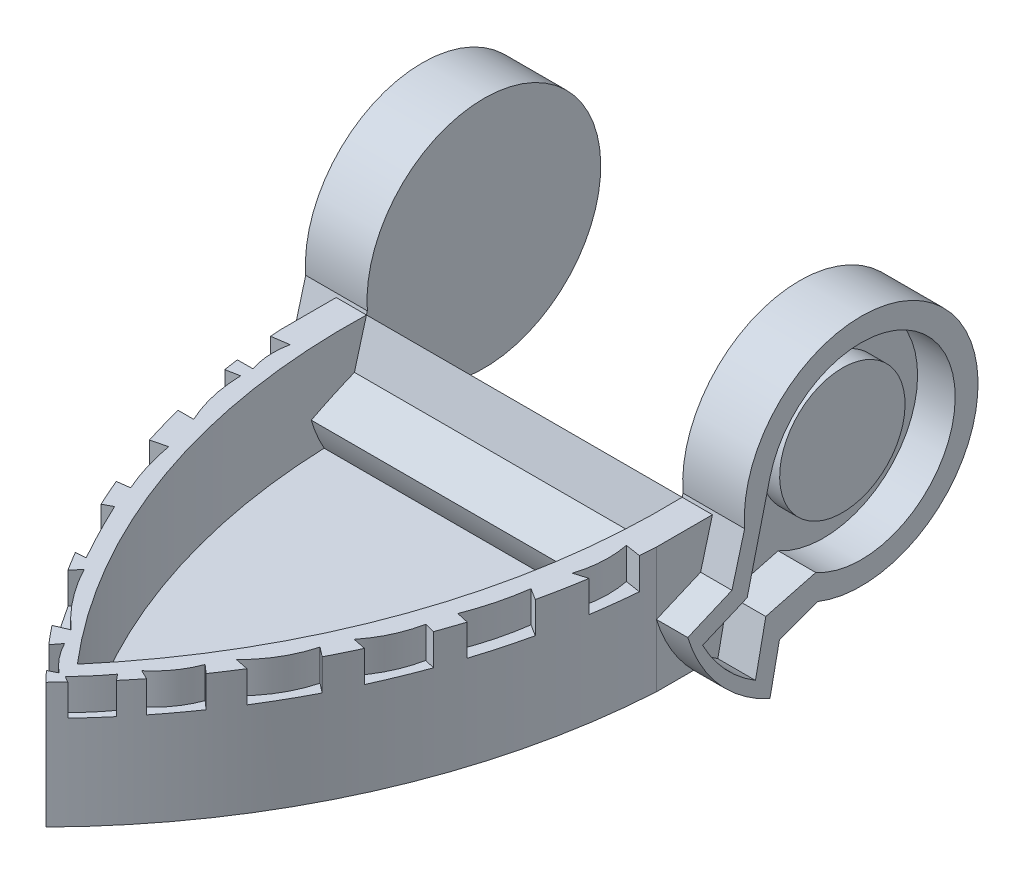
ISO-10303-21;
HEADER;
FILE_DESCRIPTION(('STEP AP214'),'2;1');
FILE_NAME('part.step','',(''),(''),'','','');
FILE_SCHEMA(('AUTOMOTIVE_DESIGN { 1 0 10303 214 1 1 1 1 }'));
ENDSEC;
DATA;
#1=APPLICATION_CONTEXT('core data for automotive mechanical design processes');
#2=APPLICATION_PROTOCOL_DEFINITION('international standard','automotive_design',2000,#1);
#3=PRODUCT_CONTEXT('',#1,'mechanical');
#4=PRODUCT('Part','Part','',(#3));
#5=PRODUCT_RELATED_PRODUCT_CATEGORY('part','',(#4));
#6=PRODUCT_DEFINITION_FORMATION('','',#4);
#7=PRODUCT_DEFINITION_CONTEXT('part definition',#1,'design');
#8=PRODUCT_DEFINITION('design','',#6,#7);
#9=PRODUCT_DEFINITION_SHAPE('','',#8);
#10=(LENGTH_UNIT() NAMED_UNIT(*) SI_UNIT(.MILLI.,.METRE.));
#11=(NAMED_UNIT(*) PLANE_ANGLE_UNIT() SI_UNIT($,.RADIAN.));
#12=(NAMED_UNIT(*) SI_UNIT($,.STERADIAN.) SOLID_ANGLE_UNIT());
#13=UNCERTAINTY_MEASURE_WITH_UNIT(LENGTH_MEASURE(1.E-05),#10,'distance_accuracy_value','');
#14=(GEOMETRIC_REPRESENTATION_CONTEXT(3) GLOBAL_UNCERTAINTY_ASSIGNED_CONTEXT((#13)) GLOBAL_UNIT_ASSIGNED_CONTEXT((#10,
#11,#12)) REPRESENTATION_CONTEXT('',''));
#15=CARTESIAN_POINT('',(0.,0.,0.));
#16=DIRECTION('',(0.,0.,1.));
#17=DIRECTION('',(1.,0.,0.));
#18=AXIS2_PLACEMENT_3D('',#15,#16,#17);
#19=CARTESIAN_POINT('',(142.898871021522,46.2461088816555,16.9622300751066));
#20=DIRECTION('',(0.,0.259923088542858,0.965629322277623));
#21=DIRECTION('',(0.,-0.965629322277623,0.259923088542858));
#22=AXIS2_PLACEMENT_3D('',#19,#20,#21);
#23=PLANE('',#22);
#24=DIRECTION('',(-1.,0.,0.));
#25=VECTOR('',#24,1.);
#26=CARTESIAN_POINT('',(133.373871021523,45.2936088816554,17.218619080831));
#27=LINE('',#26,#25);
#28=CARTESIAN_POINT('',(28.269445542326,45.2936088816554,17.218619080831));
#29=VERTEX_POINT('',#28);
#30=CARTESIAN_POINT('',(19.0738710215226,45.2936088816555,17.218619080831));
#31=VERTEX_POINT('',#30);
#32=EDGE_CURVE('E1286',#29,#31,#27,.T.);
#33=ORIENTED_EDGE('',*,*,#32,.F.);
#34=DIRECTION('',(0.,0.965629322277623,-0.259923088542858));
#35=VECTOR('',#34,1.);
#36=CARTESIAN_POINT('',(28.269445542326,46.2461088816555,16.9622300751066));
#37=LINE('',#36,#35);
#38=CARTESIAN_POINT('',(28.269445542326,46.2461088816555,16.9622300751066));
#39=VERTEX_POINT('',#38);
#40=EDGE_CURVE('E1091',#29,#39,#37,.T.);
#41=ORIENTED_EDGE('',*,*,#40,.T.);
#42=DIRECTION('',(-1.,0.,0.));
#43=VECTOR('',#42,1.);
#44=CARTESIAN_POINT('',(142.898871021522,46.2461088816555,16.9622300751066));
#45=LINE('',#44,#43);
#46=CARTESIAN_POINT('',(9.54887102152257,46.2461088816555,16.9622300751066));
#47=VERTEX_POINT('',#46);
#48=EDGE_CURVE('E1168',#39,#47,#45,.T.);
#49=ORIENTED_EDGE('',*,*,#48,.T.);
#50=DIRECTION('',(0.,0.965629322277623,-0.259923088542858));
#51=VECTOR('',#50,1.);
#52=CARTESIAN_POINT('',(9.54887102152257,46.2461088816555,16.9622300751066));
#53=LINE('',#52,#51);
#54=CARTESIAN_POINT('',(9.54887102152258,31.9586088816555,20.8080651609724));
#55=VERTEX_POINT('',#54);
#56=EDGE_CURVE('E1107',#55,#47,#53,.T.);
#57=ORIENTED_EDGE('',*,*,#56,.F.);
#58=DIRECTION('',(-1.,0.,0.));
#59=VECTOR('',#58,1.);
#60=CARTESIAN_POINT('',(142.898871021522,31.9586088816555,20.8080651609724));
#61=LINE('',#60,#59);
#62=CARTESIAN_POINT('',(19.0738710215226,31.9586088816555,20.8080651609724));
#63=VERTEX_POINT('',#62);
#64=EDGE_CURVE('E1174',#63,#55,#61,.T.);
#65=ORIENTED_EDGE('',*,*,#64,.F.);
#66=DIRECTION('',(0.,-0.965629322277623,0.259923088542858));
#67=VECTOR('',#66,1.);
#68=CARTESIAN_POINT('',(19.0738710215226,8.81921425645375,27.0366072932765));
#69=LINE('',#68,#67);
#70=EDGE_CURVE('E1293',#31,#63,#69,.T.);
#71=ORIENTED_EDGE('',*,*,#70,.F.);
#72=EDGE_LOOP('',(#33,#41,#49,#57,#65,#71));
#73=FACE_BOUND('',#72,.T.);
#74=ADVANCED_FACE('F56',(#73),#23,.T.);
#75=CARTESIAN_POINT('',(-75.7637545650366,23.8951202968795,22.978553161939));
#76=DIRECTION('',(0.,0.259923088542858,0.965629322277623));
#77=DIRECTION('',(0.,0.965629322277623,-0.259923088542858));
#78=AXIS2_PLACEMENT_3D('',#75,#76,#77);
#79=ELLIPSE('',#78,769.55456755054,200.025);
#80=CARTESIAN_POINT('',(124.178296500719,45.2936088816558,17.218619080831));
#81=VERTEX_POINT('',#80);
#82=CARTESIAN_POINT('',(124.2494690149,31.9586088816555,20.8080651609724));
#83=VERTEX_POINT('',#82);
#84=EDGE_CURVE('E1367',#81,#83,#79,.F.);
#85=ORIENTED_EDGE('',*,*,#84,.F.);
#86=DIRECTION('',(-1.,0.,0.));
#87=VECTOR('',#86,1.);
#88=CARTESIAN_POINT('',(142.898871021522,45.2936088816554,17.218619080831));
#89=LINE('',#88,#87);
#90=EDGE_CURVE('E1095',#81,#29,#89,.T.);
#91=ORIENTED_EDGE('',*,*,#90,.T.);
#92=CARTESIAN_POINT('',(228.211496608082,23.8951202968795,22.978553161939));
#93=DIRECTION('',(0.,0.259923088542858,0.965629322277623));
#94=DIRECTION('',(0.,0.965629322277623,-0.259923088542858));
#95=AXIS2_PLACEMENT_3D('',#92,#93,#94);
#96=ELLIPSE('',#95,769.55456755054,200.025);
#97=CARTESIAN_POINT('',(28.1982730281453,31.9586088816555,20.8080651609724));
#98=VERTEX_POINT('',#97);
#99=EDGE_CURVE('E1289',#98,#29,#96,.F.);
#100=ORIENTED_EDGE('',*,*,#99,.F.);
#101=EDGE_CURVE('E1173',#83,#98,#61,.T.);
#102=ORIENTED_EDGE('',*,*,#101,.F.);
#103=EDGE_LOOP('',(#85,#91,#100,#102));
#104=FACE_BOUND('',#103,.T.);
#105=ADVANCED_FACE('F1223',(#104),#23,.T.);
#106=CARTESIAN_POINT('',(142.898871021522,46.2461088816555,16.9622300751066));
#107=VERTEX_POINT('',#106);
#108=CARTESIAN_POINT('',(124.178296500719,46.2461088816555,16.9622300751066));
#109=VERTEX_POINT('',#108);
#110=EDGE_CURVE('E1164',#107,#109,#45,.T.);
#111=ORIENTED_EDGE('',*,*,#110,.T.);
#112=DIRECTION('',(0.,-0.965629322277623,0.259923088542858));
#113=VECTOR('',#112,1.);
#114=CARTESIAN_POINT('',(124.178296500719,46.2461088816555,16.9622300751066));
#115=LINE('',#114,#113);
#116=EDGE_CURVE('E1075',#109,#81,#115,.T.);
#117=ORIENTED_EDGE('',*,*,#116,.T.);
#118=CARTESIAN_POINT('',(133.373871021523,45.2936088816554,17.218619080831));
#119=VERTEX_POINT('',#118);
#120=EDGE_CURVE('E1282',#119,#81,#27,.T.);
#121=ORIENTED_EDGE('',*,*,#120,.F.);
#122=DIRECTION('',(0.,0.965629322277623,-0.259923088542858));
#123=VECTOR('',#122,1.);
#124=CARTESIAN_POINT('',(133.373871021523,-26.7067492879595,36.5993017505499));
#125=LINE('',#124,#123);
#126=CARTESIAN_POINT('',(133.373871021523,31.9586088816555,20.8080651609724));
#127=VERTEX_POINT('',#126);
#128=EDGE_CURVE('E1285',#127,#119,#125,.T.);
#129=ORIENTED_EDGE('',*,*,#128,.F.);
#130=CARTESIAN_POINT('',(142.898871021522,31.9586088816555,20.8080651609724));
#131=VERTEX_POINT('',#130);
#132=EDGE_CURVE('E1169',#131,#127,#61,.T.);
#133=ORIENTED_EDGE('',*,*,#132,.F.);
#134=DIRECTION('',(0.,0.965629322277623,-0.259923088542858));
#135=VECTOR('',#134,1.);
#136=CARTESIAN_POINT('',(142.898871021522,46.2461088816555,16.9622300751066));
#137=LINE('',#136,#135);
#138=EDGE_CURVE('E1131',#131,#107,#137,.T.);
#139=ORIENTED_EDGE('',*,*,#138,.T.);
#140=EDGE_LOOP('',(#111,#117,#121,#129,#133,#139));
#141=FACE_BOUND('',#140,.T.);
#142=ADVANCED_FACE('F1204',(#141),#23,.T.);
#143=CARTESIAN_POINT('',(142.898871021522,39.5991737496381,-9.90975581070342));
#144=DIRECTION('',(-1.,0.,0.));
#145=DIRECTION('',(0.,-1.,0.));
#146=AXIS2_PLACEMENT_3D('',#143,#144,#145);
#147=CYLINDRICAL_SURFACE('',#146,46.1119389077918);
#148=DIRECTION('',(-1.,0.,0.));
#149=VECTOR('',#148,1.);
#150=CARTESIAN_POINT('',(142.898871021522,-2.33139111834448,9.27718348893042));
#151=LINE('',#150,#149);
#152=CARTESIAN_POINT('',(28.269445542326,-2.33139111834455,9.27718348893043));
#153=VERTEX_POINT('',#152);
#154=CARTESIAN_POINT('',(9.5488710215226,-2.33139111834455,9.27718348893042));
#155=VERTEX_POINT('',#154);
#156=EDGE_CURVE('E1153',#153,#155,#151,.T.);
#157=ORIENTED_EDGE('',*,*,#156,.F.);
#158=CARTESIAN_POINT('',(28.269445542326,39.599173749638,-9.90975581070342));
#159=DIRECTION('',(1.,0.,0.));
#160=DIRECTION('',(0.,0.,-1.));
#161=AXIS2_PLACEMENT_3D('',#158,#159,#160);
#162=CIRCLE('',#161,46.1119389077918);
#163=CARTESIAN_POINT('',(28.269445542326,2.31161301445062,17.218619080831));
#164=VERTEX_POINT('',#163);
#165=EDGE_CURVE('E1087',#153,#164,#162,.F.);
#166=ORIENTED_EDGE('',*,*,#165,.T.);
#167=DIRECTION('',(-1.,0.,0.));
#168=VECTOR('',#167,1.);
#169=CARTESIAN_POINT('',(142.898871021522,2.31161301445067,17.218619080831));
#170=LINE('',#169,#168);
#171=CARTESIAN_POINT('',(124.178296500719,2.31161301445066,17.218619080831));
#172=VERTEX_POINT('',#171);
#173=EDGE_CURVE('E1376',#164,#172,#170,.F.);
#174=ORIENTED_EDGE('',*,*,#173,.T.);
#175=CARTESIAN_POINT('',(124.178296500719,39.599173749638,-9.90975581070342));
#176=DIRECTION('',(-1.,0.,0.));
#177=DIRECTION('',(0.,0.,1.));
#178=AXIS2_PLACEMENT_3D('',#175,#176,#177);
#179=CIRCLE('',#178,46.1119389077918);
#180=CARTESIAN_POINT('',(124.178296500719,-2.33139111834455,9.27718348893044));
#181=VERTEX_POINT('',#180);
#182=EDGE_CURVE('E1071',#172,#181,#179,.F.);
#183=ORIENTED_EDGE('',*,*,#182,.T.);
#184=CARTESIAN_POINT('',(142.898871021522,-2.33139111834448,9.27718348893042));
#185=VERTEX_POINT('',#184);
#186=EDGE_CURVE('E1148',#185,#181,#151,.T.);
#187=ORIENTED_EDGE('',*,*,#186,.F.);
#188=CARTESIAN_POINT('',(142.898871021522,39.5991737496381,-9.90975581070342));
#189=DIRECTION('',(-1.,0.,0.));
#190=DIRECTION('',(0.,1.,0.));
#191=AXIS2_PLACEMENT_3D('',#188,#189,#190);
#192=CIRCLE('',#191,46.1119389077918);
#193=CARTESIAN_POINT('',(142.898871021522,26.2436088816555,34.2257151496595));
#194=VERTEX_POINT('',#193);
#195=EDGE_CURVE('E1123',#185,#194,#192,.T.);
#196=ORIENTED_EDGE('',*,*,#195,.T.);
#197=DIRECTION('',(-1.,0.,0.));
#198=VECTOR('',#197,1.);
#199=CARTESIAN_POINT('',(142.898871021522,26.2436088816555,34.2257151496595));
#200=LINE('',#199,#198);
#201=CARTESIAN_POINT('',(133.373871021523,26.2436088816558,34.2257151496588));
#202=VERTEX_POINT('',#201);
#203=EDGE_CURVE('E1175',#194,#202,#200,.T.);
#204=ORIENTED_EDGE('',*,*,#203,.T.);
#205=CARTESIAN_POINT('',(133.373871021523,39.5991737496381,-9.90975581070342));
#206=DIRECTION('',(-1.,0.,0.));
#207=DIRECTION('',(0.,-1.,0.));
#208=AXIS2_PLACEMENT_3D('',#205,#206,#207);
#209=CIRCLE('',#208,46.1119389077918);
#210=CARTESIAN_POINT('',(133.373871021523,7.19360888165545,22.8955833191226));
#211=VERTEX_POINT('',#210);
#212=EDGE_CURVE('E1261',#211,#202,#209,.T.);
#213=ORIENTED_EDGE('',*,*,#212,.F.);
#214=DIRECTION('',(-1.,0.,0.));
#215=VECTOR('',#214,1.);
#216=CARTESIAN_POINT('',(142.898871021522,7.19360888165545,22.8955833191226));
#217=LINE('',#216,#215);
#218=CARTESIAN_POINT('',(19.0738710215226,7.19360888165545,22.8955833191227));
#219=VERTEX_POINT('',#218);
#220=EDGE_CURVE('E1263',#219,#211,#217,.F.);
#221=ORIENTED_EDGE('',*,*,#220,.F.);
#222=CARTESIAN_POINT('',(19.0738710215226,39.599173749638,-9.90975581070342));
#223=DIRECTION('',(1.,0.,0.));
#224=DIRECTION('',(0.,1.,0.));
#225=AXIS2_PLACEMENT_3D('',#222,#223,#224);
#226=CIRCLE('',#225,46.1119389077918);
#227=CARTESIAN_POINT('',(19.0738710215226,26.2436088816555,34.2257151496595));
#228=VERTEX_POINT('',#227);
#229=EDGE_CURVE('E1275',#228,#219,#226,.T.);
#230=ORIENTED_EDGE('',*,*,#229,.F.);
#231=CARTESIAN_POINT('',(9.54887102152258,26.2436088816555,34.2257151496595));
#232=VERTEX_POINT('',#231);
#233=EDGE_CURVE('E1147',#228,#232,#200,.T.);
#234=ORIENTED_EDGE('',*,*,#233,.T.);
#235=CARTESIAN_POINT('',(9.54887102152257,39.599173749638,-9.90975581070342));
#236=DIRECTION('',(-1.,0.,0.));
#237=DIRECTION('',(0.,1.,0.));
#238=AXIS2_PLACEMENT_3D('',#235,#236,#237);
#239=CIRCLE('',#238,46.1119389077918);
#240=EDGE_CURVE('E1099',#155,#232,#239,.T.);
#241=ORIENTED_EDGE('',*,*,#240,.F.);
#242=EDGE_LOOP('',(#157,#166,#174,#183,#187,#196,#204,#213,#221,#230,#234,#241));
#243=FACE_BOUND('',#242,.T.);
#244=ADVANCED_FACE('F1199',(#243),#147,.T.);
#245=CARTESIAN_POINT('',(142.898871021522,-2.33139111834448,9.27718348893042));
#246=DIRECTION('',(0.,-0.201819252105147,-0.979422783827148));
#247=DIRECTION('',(0.,0.979422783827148,-0.201819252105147));
#248=AXIS2_PLACEMENT_3D('',#245,#246,#247);
#249=PLANE('',#248);
#250=DIRECTION('',(-1.,0.,0.));
#251=VECTOR('',#250,1.);
#252=CARTESIAN_POINT('',(142.898871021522,11.6621119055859,6.39369092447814));
#253=LINE('',#252,#251);
#254=CARTESIAN_POINT('',(28.269445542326,11.6621119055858,6.39369092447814));
#255=VERTEX_POINT('',#254);
#256=CARTESIAN_POINT('',(9.54887102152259,11.6621119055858,6.39369092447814));
#257=VERTEX_POINT('',#256);
#258=EDGE_CURVE('E1158',#255,#257,#253,.T.);
#259=ORIENTED_EDGE('',*,*,#258,.F.);
#260=DIRECTION('',(0.,-0.979422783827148,0.201819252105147));
#261=VECTOR('',#260,1.);
#262=CARTESIAN_POINT('',(28.269445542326,-2.33139111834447,9.27718348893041));
#263=LINE('',#262,#261);
#264=EDGE_CURVE('E1083',#255,#153,#263,.T.);
#265=ORIENTED_EDGE('',*,*,#264,.T.);
#266=ORIENTED_EDGE('',*,*,#156,.T.);
#267=DIRECTION('',(0.,-0.979422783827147,0.201819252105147));
#268=VECTOR('',#267,1.);
#269=CARTESIAN_POINT('',(9.5488710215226,-2.33139111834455,9.27718348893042));
#270=LINE('',#269,#268);
#271=EDGE_CURVE('E1119',#257,#155,#270,.T.);
#272=ORIENTED_EDGE('',*,*,#271,.F.);
#273=EDGE_LOOP('',(#259,#265,#266,#272));
#274=FACE_BOUND('',#273,.T.);
#275=ADVANCED_FACE('F1203',(#274),#249,.T.);
#276=ORIENTED_EDGE('',*,*,#186,.T.);
#277=DIRECTION('',(0.,0.979422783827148,-0.201819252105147));
#278=VECTOR('',#277,1.);
#279=CARTESIAN_POINT('',(124.178296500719,-2.33139111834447,9.27718348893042));
#280=LINE('',#279,#278);
#281=CARTESIAN_POINT('',(124.178296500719,11.6621119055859,6.39369092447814));
#282=VERTEX_POINT('',#281);
#283=EDGE_CURVE('E1067',#181,#282,#280,.T.);
#284=ORIENTED_EDGE('',*,*,#283,.T.);
#285=CARTESIAN_POINT('',(142.898871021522,11.6621119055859,6.39369092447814));
#286=VERTEX_POINT('',#285);
#287=EDGE_CURVE('E1154',#286,#282,#253,.T.);
#288=ORIENTED_EDGE('',*,*,#287,.F.);
#289=DIRECTION('',(0.,-0.979422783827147,0.201819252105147));
#290=VECTOR('',#289,1.);
#291=CARTESIAN_POINT('',(142.898871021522,-2.33139111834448,9.27718348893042));
#292=LINE('',#291,#290);
#293=EDGE_CURVE('E1143',#286,#185,#292,.T.);
#294=ORIENTED_EDGE('',*,*,#293,.T.);
#295=EDGE_LOOP('',(#276,#284,#288,#294));
#296=FACE_BOUND('',#295,.T.);
#297=ADVANCED_FACE('F1254',(#296),#249,.T.);
#298=CARTESIAN_POINT('',(142.898871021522,11.6621119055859,6.39369092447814));
#299=DIRECTION('',(0.,-0.937196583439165,-0.348801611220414));
#300=DIRECTION('',(0.,0.348801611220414,-0.937196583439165));
#301=AXIS2_PLACEMENT_3D('',#298,#299,#300);
#302=PLANE('',#301);
#303=DIRECTION('',(-1.,0.,0.));
#304=VECTOR('',#303,1.);
#305=CARTESIAN_POINT('',(142.898871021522,15.9811478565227,-5.21114576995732));
#306=LINE('',#305,#304);
#307=CARTESIAN_POINT('',(28.269445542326,15.9811478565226,-5.21114576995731));
#308=VERTEX_POINT('',#307);
#309=CARTESIAN_POINT('',(9.54887102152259,15.9811478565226,-5.21114576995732));
#310=VERTEX_POINT('',#309);
#311=EDGE_CURVE('E1163',#308,#310,#306,.T.);
#312=ORIENTED_EDGE('',*,*,#311,.F.);
#313=DIRECTION('',(0.,-0.348801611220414,0.937196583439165));
#314=VECTOR('',#313,1.);
#315=CARTESIAN_POINT('',(28.269445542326,11.6621119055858,6.3936909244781));
#316=LINE('',#315,#314);
#317=EDGE_CURVE('E1079',#308,#255,#316,.T.);
#318=ORIENTED_EDGE('',*,*,#317,.T.);
#319=ORIENTED_EDGE('',*,*,#258,.T.);
#320=DIRECTION('',(0.,-0.348801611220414,0.937196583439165));
#321=VECTOR('',#320,1.);
#322=CARTESIAN_POINT('',(9.54887102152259,11.6621119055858,6.39369092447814));
#323=LINE('',#322,#321);
#324=EDGE_CURVE('E1115',#310,#257,#323,.T.);
#325=ORIENTED_EDGE('',*,*,#324,.F.);
#326=EDGE_LOOP('',(#312,#318,#319,#325));
#327=FACE_BOUND('',#326,.T.);
#328=ADVANCED_FACE('F1606',(#327),#302,.T.);
#329=ORIENTED_EDGE('',*,*,#287,.T.);
#330=DIRECTION('',(0.,0.348801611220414,-0.937196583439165));
#331=VECTOR('',#330,1.);
#332=CARTESIAN_POINT('',(124.178296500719,11.6621119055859,6.39369092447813));
#333=LINE('',#332,#331);
#334=CARTESIAN_POINT('',(124.178296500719,15.9811478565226,-5.21114576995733));
#335=VERTEX_POINT('',#334);
#336=EDGE_CURVE('E1063',#282,#335,#333,.T.);
#337=ORIENTED_EDGE('',*,*,#336,.T.);
#338=CARTESIAN_POINT('',(142.898871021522,15.9811478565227,-5.21114576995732));
#339=VERTEX_POINT('',#338);
#340=EDGE_CURVE('E1159',#339,#335,#306,.T.);
#341=ORIENTED_EDGE('',*,*,#340,.F.);
#342=DIRECTION('',(0.,-0.348801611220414,0.937196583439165));
#343=VECTOR('',#342,1.);
#344=CARTESIAN_POINT('',(142.898871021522,11.6621119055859,6.39369092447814));
#345=LINE('',#344,#343);
#346=EDGE_CURVE('E1139',#339,#286,#345,.T.);
#347=ORIENTED_EDGE('',*,*,#346,.T.);
#348=EDGE_LOOP('',(#329,#337,#341,#347));
#349=FACE_BOUND('',#348,.T.);
#350=ADVANCED_FACE('F1250',(#349),#302,.T.);
#351=CARTESIAN_POINT('',(142.898871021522,48.9335271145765,-18.4472558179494));
#352=DIRECTION('',(-1.,0.,0.));
#353=DIRECTION('',(0.,-1.,0.));
#354=AXIS2_PLACEMENT_3D('',#351,#352,#353);
#355=CYLINDRICAL_SURFACE('',#354,35.511320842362);
#356=ORIENTED_EDGE('',*,*,#48,.F.);
#357=CARTESIAN_POINT('',(28.269445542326,48.9335271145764,-18.4472558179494));
#358=DIRECTION('',(1.,0.,0.));
#359=DIRECTION('',(0.,0.,-1.));
#360=AXIS2_PLACEMENT_3D('',#357,#358,#359);
#361=CIRCLE('',#360,35.511320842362);
#362=EDGE_CURVE('E1372',#39,#308,#361,.F.);
#363=ORIENTED_EDGE('',*,*,#362,.T.);
#364=ORIENTED_EDGE('',*,*,#311,.T.);
#365=CARTESIAN_POINT('',(9.54887102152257,48.9335271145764,-18.4472558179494));
#366=DIRECTION('',(-1.,0.,0.));
#367=DIRECTION('',(0.,1.,0.));
#368=AXIS2_PLACEMENT_3D('',#365,#366,#367);
#369=CIRCLE('',#368,35.511320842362);
#370=EDGE_CURVE('E1111',#47,#310,#369,.T.);
#371=ORIENTED_EDGE('',*,*,#370,.F.);
#372=EDGE_LOOP('',(#356,#363,#364,#371));
#373=FACE_BOUND('',#372,.T.);
#374=ADVANCED_FACE('F1603',(#373),#355,.T.);
#375=ORIENTED_EDGE('',*,*,#340,.T.);
#376=CARTESIAN_POINT('',(124.178296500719,48.9335271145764,-18.4472558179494));
#377=DIRECTION('',(-1.,0.,0.));
#378=DIRECTION('',(0.,0.,1.));
#379=AXIS2_PLACEMENT_3D('',#376,#377,#378);
#380=CIRCLE('',#379,35.511320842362);
#381=EDGE_CURVE('E1242',#335,#109,#380,.F.);
#382=ORIENTED_EDGE('',*,*,#381,.T.);
#383=ORIENTED_EDGE('',*,*,#110,.F.);
#384=CARTESIAN_POINT('',(142.898871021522,48.9335271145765,-18.4472558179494));
#385=DIRECTION('',(-1.,0.,0.));
#386=DIRECTION('',(0.,1.,0.));
#387=AXIS2_PLACEMENT_3D('',#384,#385,#386);
#388=CIRCLE('',#387,35.511320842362);
#389=EDGE_CURVE('E1135',#107,#339,#388,.T.);
#390=ORIENTED_EDGE('',*,*,#389,.T.);
#391=EDGE_LOOP('',(#375,#382,#383,#390));
#392=FACE_BOUND('',#391,.T.);
#393=ADVANCED_FACE('F1241',(#392),#355,.T.);
#394=CARTESIAN_POINT('',(133.373871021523,7.19360888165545,162.541095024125));
#395=DIRECTION('',(-1.,0.,0.));
#396=DIRECTION('',(0.,-1.,0.));
#397=AXIS2_PLACEMENT_3D('',#394,#395,#396);
#398=PLANE('',#397);
#399=DIRECTION('',(0.,0.,-1.));
#400=VECTOR('',#399,1.);
#401=CARTESIAN_POINT('',(133.373871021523,7.19360888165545,162.541095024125));
#402=LINE('',#401,#400);
#403=CARTESIAN_POINT('',(133.373871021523,7.19360888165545,34.2257151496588));
#404=VERTEX_POINT('',#403);
#405=EDGE_CURVE('E1350',#404,#211,#402,.T.);
#406=ORIENTED_EDGE('',*,*,#405,.T.);
#407=ORIENTED_EDGE('',*,*,#212,.T.);
#408=DIRECTION('',(0.,1.,0.));
#409=VECTOR('',#408,1.);
#410=CARTESIAN_POINT('',(133.373871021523,-4.80789111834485,34.2257151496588));
#411=LINE('',#410,#409);
#412=EDGE_CURVE('E1320',#404,#202,#411,.T.);
#413=ORIENTED_EDGE('',*,*,#412,.F.);
#414=EDGE_LOOP('',(#406,#407,#413));
#415=FACE_BOUND('',#414,.T.);
#416=ADVANCED_FACE('F1866',(#415),#398,.F.);
#417=CARTESIAN_POINT('',(19.0738710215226,45.2936088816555,162.541095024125));
#418=DIRECTION('',(1.,0.,0.));
#419=DIRECTION('',(0.,1.,0.));
#420=AXIS2_PLACEMENT_3D('',#417,#418,#419);
#421=PLANE('',#420);
#422=DIRECTION('',(0.,1.,0.));
#423=VECTOR('',#422,1.);
#424=CARTESIAN_POINT('',(19.0738710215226,-4.80789111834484,34.2257151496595));
#425=LINE('',#424,#423);
#426=CARTESIAN_POINT('',(19.0738710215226,7.19360888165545,34.2257151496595));
#427=VERTEX_POINT('',#426);
#428=EDGE_CURVE('E1334',#427,#228,#425,.T.);
#429=ORIENTED_EDGE('',*,*,#428,.T.);
#430=ORIENTED_EDGE('',*,*,#229,.T.);
#431=DIRECTION('',(0.,0.,-1.));
#432=VECTOR('',#431,1.);
#433=CARTESIAN_POINT('',(19.0738710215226,7.19360888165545,162.541095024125));
#434=LINE('',#433,#432);
#435=EDGE_CURVE('E1353',#427,#219,#434,.T.);
#436=ORIENTED_EDGE('',*,*,#435,.F.);
#437=EDGE_LOOP('',(#429,#430,#436));
#438=FACE_BOUND('',#437,.T.);
#439=ADVANCED_FACE('F1562',(#438),#421,.F.);
#440=CARTESIAN_POINT('',(19.0738710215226,7.19360888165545,162.541095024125));
#441=DIRECTION('',(0.,1.,0.));
#442=DIRECTION('',(0.,0.,1.));
#443=AXIS2_PLACEMENT_3D('',#440,#441,#442);
#444=PLANE('',#443);
#445=ORIENTED_EDGE('',*,*,#435,.T.);
#446=ORIENTED_EDGE('',*,*,#220,.T.);
#447=ORIENTED_EDGE('',*,*,#405,.F.);
#448=CARTESIAN_POINT('',(-66.2883021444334,7.19360888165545,22.1834050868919));
#449=DIRECTION('',(0.,1.,0.));
#450=DIRECTION('',(0.,0.,1.));
#451=AXIS2_PLACEMENT_3D('',#448,#449,#450);
#452=CIRCLE('',#451,200.025);
#453=CARTESIAN_POINT('',(76.2238710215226,7.19360888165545,162.541095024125));
#454=VERTEX_POINT('',#453);
#455=EDGE_CURVE('E1324',#454,#404,#452,.T.);
#456=ORIENTED_EDGE('',*,*,#455,.F.);
#457=CARTESIAN_POINT('',(218.736044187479,7.19360888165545,22.1834050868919));
#458=DIRECTION('',(0.,1.,0.));
#459=DIRECTION('',(0.,0.,1.));
#460=AXIS2_PLACEMENT_3D('',#457,#458,#459);
#461=CIRCLE('',#460,200.025);
#462=EDGE_CURVE('E1338',#427,#454,#461,.T.);
#463=ORIENTED_EDGE('',*,*,#462,.F.);
#464=EDGE_LOOP('',(#445,#446,#447,#456,#463));
#465=FACE_BOUND('',#464,.T.);
#466=ADVANCED_FACE('F1559',(#465),#444,.F.);
#467=CARTESIAN_POINT('',(133.373871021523,45.2936088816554,162.541095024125));
#468=DIRECTION('',(0.,-1.,0.));
#469=DIRECTION('',(1.,0.,0.));
#470=AXIS2_PLACEMENT_3D('',#467,#468,#469);
#471=PLANE('',#470);
#472=CARTESIAN_POINT('',(101.712952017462,45.2936088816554,70.0827017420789));
#473=DIRECTION('',(0.,-1.,0.));
#474=DIRECTION('',(1.,0.,0.));
#475=AXIS2_PLACEMENT_3D('',#472,#473,#474);
#476=CIRCLE('',#475,69.8354564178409);
#477=CARTESIAN_POINT('',(37.9207480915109,45.2936088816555,98.500050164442));
#478=VERTEX_POINT('',#477);
#479=CARTESIAN_POINT('',(32.8840137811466,45.2936088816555,81.8966017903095));
#480=VERTEX_POINT('',#479);
#481=EDGE_CURVE('E679',#478,#480,#476,.T.);
#482=ORIENTED_EDGE('',*,*,#481,.F.);
#483=DIRECTION('',(0.991019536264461,0.,-0.13371715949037));
#484=VECTOR('',#483,1.);
#485=CARTESIAN_POINT('',(16.3589418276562,45.2936088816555,101.409360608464));
#486=LINE('',#485,#484);
#487=CARTESIAN_POINT('',(34.0580852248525,45.2936088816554,99.0212349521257));
#488=VERTEX_POINT('',#487);
#489=EDGE_CURVE('E672',#488,#478,#486,.T.);
#490=ORIENTED_EDGE('',*,*,#489,.F.);
#491=CARTESIAN_POINT('',(218.736044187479,45.2936088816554,22.1834050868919));
#492=DIRECTION('',(0.,1.,0.));
#493=DIRECTION('',(-1.,0.,0.));
#494=AXIS2_PLACEMENT_3D('',#491,#492,#493);
#495=CIRCLE('',#494,200.025);
#496=CARTESIAN_POINT('',(37.7318196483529,45.2936088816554,107.31548672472));
#497=VERTEX_POINT('',#496);
#498=EDGE_CURVE('E1524',#488,#497,#495,.T.);
#499=ORIENTED_EDGE('',*,*,#498,.T.);
#500=DIRECTION('',(-0.883504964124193,0.,0.468421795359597));
#501=VECTOR('',#500,1.);
#502=CARTESIAN_POINT('',(40.4213781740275,45.2936088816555,105.88952095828));
#503=LINE('',#502,#501);
#504=CARTESIAN_POINT('',(40.4213781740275,45.2936088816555,105.88952095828));
#505=VERTEX_POINT('',#504);
#506=EDGE_CURVE('E896',#505,#497,#503,.T.);
#507=ORIENTED_EDGE('',*,*,#506,.F.);
#508=CARTESIAN_POINT('',(276.59828238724,45.2936088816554,-4.38546055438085));
#509=DIRECTION('',(0.,-1.,0.));
#510=DIRECTION('',(1.,0.,0.));
#511=AXIS2_PLACEMENT_3D('',#508,#509,#510);
#512=CIRCLE('',#511,260.653221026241);
#513=CARTESIAN_POINT('',(49.5785795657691,45.2936088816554,123.685442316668));
#514=VERTEX_POINT('',#513);
#515=EDGE_CURVE('E693',#514,#505,#512,.T.);
#516=ORIENTED_EDGE('',*,*,#515,.F.);
#517=DIRECTION('',(0.996980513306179,0.,-0.0776521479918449));
#518=VECTOR('',#517,1.);
#519=CARTESIAN_POINT('',(26.349266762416,45.2936088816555,125.494711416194));
#520=LINE('',#519,#518);
#521=CARTESIAN_POINT('',(46.5184626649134,45.2936088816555,123.923786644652));
#522=VERTEX_POINT('',#521);
#523=EDGE_CURVE('E886',#522,#514,#520,.T.);
#524=ORIENTED_EDGE('',*,*,#523,.F.);
#525=CARTESIAN_POINT('',(50.0347536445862,45.2936088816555,129.653750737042));
#526=VERTEX_POINT('',#525);
#527=EDGE_CURVE('E1529',#522,#526,#495,.T.);
#528=ORIENTED_EDGE('',*,*,#527,.T.);
#529=DIRECTION('',(-0.671358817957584,0.,0.74113246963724));
#530=VECTOR('',#529,1.);
#531=CARTESIAN_POINT('',(52.3554347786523,45.2936088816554,127.091883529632));
#532=LINE('',#531,#530);
#533=CARTESIAN_POINT('',(52.3554347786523,45.2936088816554,127.091883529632));
#534=VERTEX_POINT('',#533);
#535=EDGE_CURVE('E765',#534,#526,#532,.T.);
#536=ORIENTED_EDGE('',*,*,#535,.F.);
#537=CARTESIAN_POINT('',(108.591497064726,45.2936088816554,97.6837451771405));
#538=DIRECTION('',(0.,-1.,0.));
#539=DIRECTION('',(-1.,0.,0.));
#540=AXIS2_PLACEMENT_3D('',#537,#538,#539);
#541=CIRCLE('',#540,63.4612740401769);
#542=CARTESIAN_POINT('',(66.2455014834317,45.2936088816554,144.950540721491));
#543=VERTEX_POINT('',#542);
#544=EDGE_CURVE('E747',#543,#534,#541,.T.);
#545=ORIENTED_EDGE('',*,*,#544,.F.);
#546=DIRECTION('',(0.92247834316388,0.,-0.386048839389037));
#547=VECTOR('',#546,1.);
#548=CARTESIAN_POINT('',(48.8289197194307,45.2936088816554,152.239222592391));
#549=LINE('',#548,#547);
#550=CARTESIAN_POINT('',(62.1613200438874,45.2936088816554,146.659733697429));
#551=VERTEX_POINT('',#550);
#552=EDGE_CURVE('E755',#551,#543,#549,.T.);
#553=ORIENTED_EDGE('',*,*,#552,.F.);
#554=CARTESIAN_POINT('',(66.7580268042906,45.2936088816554,152.232176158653));
#555=VERTEX_POINT('',#554);
#556=EDGE_CURVE('E1533',#551,#555,#495,.T.);
#557=ORIENTED_EDGE('',*,*,#556,.T.);
#558=DIRECTION('',(-0.608550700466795,0.,0.793514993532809));
#559=VECTOR('',#558,1.);
#560=CARTESIAN_POINT('',(68.8407209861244,45.2936088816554,149.516463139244));
#561=LINE('',#560,#559);
#562=CARTESIAN_POINT('',(68.8407209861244,45.2936088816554,149.516463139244));
#563=VERTEX_POINT('',#562);
#564=EDGE_CURVE('E737',#563,#555,#561,.T.);
#565=ORIENTED_EDGE('',*,*,#564,.F.);
#566=CARTESIAN_POINT('',(93.5992361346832,45.2936088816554,136.667008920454));
#567=DIRECTION('',(0.,-1.,0.));
#568=DIRECTION('',(-1.,0.,0.));
#569=AXIS2_PLACEMENT_3D('',#566,#567,#568);
#570=CIRCLE('',#569,27.8943102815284);
#571=CARTESIAN_POINT('',(75.7425558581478,45.2936088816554,158.096696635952));
#572=VERTEX_POINT('',#571);
#573=EDGE_CURVE('E733',#572,#563,#570,.T.);
#574=ORIENTED_EDGE('',*,*,#573,.F.);
#575=DIRECTION('',(0.897696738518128,0.,-0.44061385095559));
#576=VECTOR('',#575,1.);
#577=CARTESIAN_POINT('',(63.3058838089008,45.2936088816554,164.200951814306));
#578=LINE('',#577,#576);
#579=CARTESIAN_POINT('',(73.1622963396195,45.2936088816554,159.363157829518));
#580=VERTEX_POINT('',#579);
#581=EDGE_CURVE('E726',#580,#572,#578,.T.);
#582=ORIENTED_EDGE('',*,*,#581,.F.);
#583=CARTESIAN_POINT('',(76.2238710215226,45.2936088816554,162.541095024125));
#584=VERTEX_POINT('',#583);
#585=EDGE_CURVE('E1327',#580,#584,#495,.T.);
#586=ORIENTED_EDGE('',*,*,#585,.T.);
#587=CARTESIAN_POINT('',(-66.2883021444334,45.2936088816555,22.1834050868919));
#588=DIRECTION('',(0.,1.,0.));
#589=DIRECTION('',(-1.,0.,0.));
#590=AXIS2_PLACEMENT_3D('',#587,#588,#589);
#591=CIRCLE('',#590,200.025);
#592=CARTESIAN_POINT('',(79.4752940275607,45.2936088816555,159.161413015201));
#593=VERTEX_POINT('',#592);
#594=EDGE_CURVE('E1314',#584,#593,#591,.T.);
#595=ORIENTED_EDGE('',*,*,#594,.T.);
#596=DIRECTION('',(0.871580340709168,0.,0.49025269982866));
#597=VECTOR('',#596,1.);
#598=CARTESIAN_POINT('',(77.5824215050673,45.2936088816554,158.096696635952));
#599=LINE('',#598,#597);
#600=CARTESIAN_POINT('',(77.5824215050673,45.2936088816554,158.096696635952));
#601=VERTEX_POINT('',#600);
#602=EDGE_CURVE('E819',#601,#593,#599,.T.);
#603=ORIENTED_EDGE('',*,*,#602,.F.);
#604=CARTESIAN_POINT('',(29.4620607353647,45.2936088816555,109.256537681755));
#605=DIRECTION('',(0.,-1.,0.));
#606=DIRECTION('',(-1.,0.,0.));
#607=AXIS2_PLACEMENT_3D('',#604,#605,#606);
#608=CIRCLE('',#607,68.5633301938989);
#609=CARTESIAN_POINT('',(84.9604269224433,45.2936088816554,149.516463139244));
#610=VERTEX_POINT('',#609);
#611=EDGE_CURVE('E801',#610,#601,#608,.T.);
#612=ORIENTED_EDGE('',*,*,#611,.F.);
#613=DIRECTION('',(-0.628081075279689,0.,-0.778147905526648));
#614=VECTOR('',#613,1.);
#615=CARTESIAN_POINT('',(92.185849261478,45.2936088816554,158.46824895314));
#616=LINE('',#615,#614);
#617=CARTESIAN_POINT('',(86.4402774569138,45.2936088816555,151.34989299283));
#618=VERTEX_POINT('',#617);
#619=EDGE_CURVE('E809',#618,#610,#616,.T.);
#620=ORIENTED_EDGE('',*,*,#619,.F.);
#621=CARTESIAN_POINT('',(90.5627426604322,45.2936088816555,146.311364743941));
#622=VERTEX_POINT('',#621);
#623=EDGE_CURVE('E1319',#618,#622,#591,.T.);
#624=ORIENTED_EDGE('',*,*,#623,.T.);
#625=DIRECTION('',(0.901413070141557,0.,0.432960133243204));
#626=VECTOR('',#625,1.);
#627=CARTESIAN_POINT('',(87.7295382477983,45.2936088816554,144.950540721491));
#628=LINE('',#627,#626);
#629=CARTESIAN_POINT('',(87.7295382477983,45.2936088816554,144.950540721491));
#630=VERTEX_POINT('',#629);
#631=EDGE_CURVE('E791',#630,#622,#628,.T.);
#632=ORIENTED_EDGE('',*,*,#631,.F.);
#633=CARTESIAN_POINT('',(70.7089639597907,45.2936088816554,124.426155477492));
#634=DIRECTION('',(0.,-1.,0.));
#635=DIRECTION('',(-1.,0.,0.));
#636=AXIS2_PLACEMENT_3D('',#633,#634,#635);
#637=CIRCLE('',#636,26.663652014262);
#638=CARTESIAN_POINT('',(95.7147189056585,45.2936088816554,133.681562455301));
#639=VERTEX_POINT('',#638);
#640=EDGE_CURVE('E787',#639,#630,#637,.T.);
#641=ORIENTED_EDGE('',*,*,#640,.F.);
#642=DIRECTION('',(-0.749580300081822,0.,-0.661913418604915));
#643=VECTOR('',#642,1.);
#644=CARTESIAN_POINT('',(104.321112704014,45.2936088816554,141.281398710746));
#645=LINE('',#644,#643);
#646=CARTESIAN_POINT('',(98.2519992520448,45.2936088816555,135.922096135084));
#647=VERTEX_POINT('',#646);
#648=EDGE_CURVE('E780',#647,#639,#645,.T.);
#649=ORIENTED_EDGE('',*,*,#648,.F.);
#650=CARTESIAN_POINT('',(103.17827366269,45.2936088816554,128.442900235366));
#651=VERTEX_POINT('',#650);
#652=EDGE_CURVE('E1630',#647,#651,#591,.T.);
#653=ORIENTED_EDGE('',*,*,#652,.T.);
#654=DIRECTION('',(0.979774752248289,0.,0.200103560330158));
#655=VECTOR('',#654,1.);
#656=CARTESIAN_POINT('',(99.1987824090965,45.2936088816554,127.630151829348));
#657=LINE('',#656,#655);
#658=CARTESIAN_POINT('',(99.1987824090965,45.2936088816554,127.630151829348));
#659=VERTEX_POINT('',#658);
#660=EDGE_CURVE('E845',#659,#651,#657,.T.);
#661=ORIENTED_EDGE('',*,*,#660,.F.);
#662=CARTESIAN_POINT('',(74.7383162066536,45.2936088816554,102.503161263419));
#663=DIRECTION('',(0.,-1.,0.));
#664=DIRECTION('',(-1.,0.,0.));
#665=AXIS2_PLACEMENT_3D('',#662,#663,#664);
#666=CIRCLE('',#665,35.0667942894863);
#667=CARTESIAN_POINT('',(108.591497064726,45.2936088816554,111.648772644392));
#668=VERTEX_POINT('',#667);
#669=EDGE_CURVE('E841',#668,#659,#666,.T.);
#670=ORIENTED_EDGE('',*,*,#669,.F.);
#671=DIRECTION('',(-0.788675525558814,0.,-0.6148096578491));
#672=VECTOR('',#671,1.);
#673=CARTESIAN_POINT('',(117.361033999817,45.2936088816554,118.485039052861));
#674=LINE('',#673,#672);
#675=CARTESIAN_POINT('',(111.472791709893,45.2936088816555,113.894877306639));
#676=VERTEX_POINT('',#675);
#677=EDGE_CURVE('E834',#676,#668,#674,.T.);
#678=ORIENTED_EDGE('',*,*,#677,.F.);
#679=CARTESIAN_POINT('',(115.679746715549,45.2936088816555,105.235375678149));
#680=VERTEX_POINT('',#679);
#681=EDGE_CURVE('E1627',#676,#680,#591,.T.);
#682=ORIENTED_EDGE('',*,*,#681,.T.);
#683=DIRECTION('',(0.979774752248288,0.,0.200103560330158));
#684=VECTOR('',#683,1.);
#685=CARTESIAN_POINT('',(111.738427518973,45.2936088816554,104.430423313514));
#686=LINE('',#685,#684);
#687=CARTESIAN_POINT('',(111.738427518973,45.2936088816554,104.430423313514));
#688=VERTEX_POINT('',#687);
#689=EDGE_CURVE('E871',#688,#680,#686,.T.);
#690=ORIENTED_EDGE('',*,*,#689,.F.);
#691=CARTESIAN_POINT('',(84.5532802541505,45.2936088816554,82.7359821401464));
#692=DIRECTION('',(0.,-1.,0.));
#693=DIRECTION('',(-1.,0.,0.));
#694=AXIS2_PLACEMENT_3D('',#691,#692,#693);
#695=CIRCLE('',#694,34.7804687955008);
#696=CARTESIAN_POINT('',(118.653146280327,45.2936088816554,89.5828899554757));
#697=VERTEX_POINT('',#696);
#698=EDGE_CURVE('E614',#697,#688,#695,.T.);
#699=ORIENTED_EDGE('',*,*,#698,.F.);
#700=DIRECTION('',(-0.970360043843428,0.,-0.241663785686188));
#701=VECTOR('',#700,1.);
#702=CARTESIAN_POINT('',(128.36059996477,45.2936088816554,92.0004874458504));
#703=LINE('',#702,#701);
#704=CARTESIAN_POINT('',(121.760602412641,45.2936088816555,90.3567878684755));
#705=VERTEX_POINT('',#704);
#706=EDGE_CURVE('E861',#705,#697,#703,.T.);
#707=ORIENTED_EDGE('',*,*,#706,.F.);
#708=CARTESIAN_POINT('',(124.357844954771,45.2936088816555,82.7147789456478));
#709=VERTEX_POINT('',#708);
#710=EDGE_CURVE('E1624',#705,#709,#591,.T.);
#711=ORIENTED_EDGE('',*,*,#710,.T.);
#712=DIRECTION('',(0.975887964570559,0.,0.218272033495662));
#713=VECTOR('',#712,1.);
#714=CARTESIAN_POINT('',(120.699798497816,45.2936088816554,81.8966017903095));
#715=LINE('',#714,#713);
#716=CARTESIAN_POINT('',(120.699798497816,45.2936088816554,81.8966017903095));
#717=VERTEX_POINT('',#716);
#718=EDGE_CURVE('E603',#717,#709,#715,.T.);
#719=ORIENTED_EDGE('',*,*,#718,.F.);
#720=CARTESIAN_POINT('',(47.3104039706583,45.2936088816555,53.4563740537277));
#721=DIRECTION('',(0.,-1.,0.));
#722=DIRECTION('',(-1.,0.,0.));
#723=AXIS2_PLACEMENT_3D('',#720,#721,#722);
#724=CIRCLE('',#723,78.7073680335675);
#725=CARTESIAN_POINT('',(125.276601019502,45.2936088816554,64.2323612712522));
#726=VERTEX_POINT('',#725);
#727=EDGE_CURVE('E580',#726,#717,#724,.T.);
#728=ORIENTED_EDGE('',*,*,#727,.F.);
#729=DIRECTION('',(-0.844795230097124,0.,-0.535089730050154));
#730=VECTOR('',#729,1.);
#731=CARTESIAN_POINT('',(133.583947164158,45.2936088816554,69.4941992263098));
#732=LINE('',#731,#730);
#733=CARTESIAN_POINT('',(128.777092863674,45.2936088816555,66.44955801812));
#734=VERTEX_POINT('',#733);
#735=EDGE_CURVE('E600',#734,#726,#732,.T.);
#736=ORIENTED_EDGE('',*,*,#735,.F.);
#737=CARTESIAN_POINT('',(131.392504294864,45.2936088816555,52.7169831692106));
#738=VERTEX_POINT('',#737);
#739=EDGE_CURVE('E1621',#734,#738,#591,.T.);
#740=ORIENTED_EDGE('',*,*,#739,.T.);
#741=DIRECTION('',(0.958767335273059,0.,-0.284192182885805));
#742=VECTOR('',#741,1.);
#743=CARTESIAN_POINT('',(127.463478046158,45.2936088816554,53.8816020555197));
#744=LINE('',#743,#742);
#745=CARTESIAN_POINT('',(127.463478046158,45.2936088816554,53.8816020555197));
#746=VERTEX_POINT('',#745);
#747=EDGE_CURVE('E632',#746,#738,#744,.T.);
#748=ORIENTED_EDGE('',*,*,#747,.F.);
#749=CARTESIAN_POINT('',(98.2192052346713,45.2936088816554,44.3954414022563));
#750=DIRECTION('',(0.,-1.,0.));
#751=DIRECTION('',(-1.,0.,0.));
#752=AXIS2_PLACEMENT_3D('',#749,#750,#751);
#753=CIRCLE('',#752,30.7443447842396);
#754=CARTESIAN_POINT('',(128.36059996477,45.2936088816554,38.3364761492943));
#755=VERTEX_POINT('',#754);
#756=EDGE_CURVE('E628',#755,#746,#753,.T.);
#757=ORIENTED_EDGE('',*,*,#756,.F.);
#758=DIRECTION('',(-0.987882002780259,0.,-0.155206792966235));
#759=VECTOR('',#758,1.);
#760=CARTESIAN_POINT('',(147.593433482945,45.2936088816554,41.3581593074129));
#761=LINE('',#760,#759);
#762=CARTESIAN_POINT('',(133.022709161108,45.2936088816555,39.0689431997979));
#763=VERTEX_POINT('',#762);
#764=EDGE_CURVE('E621',#763,#755,#761,.T.);
#765=ORIENTED_EDGE('',*,*,#764,.F.);
#766=CARTESIAN_POINT('',(133.373871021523,45.2936088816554,34.2257151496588));
#767=VERTEX_POINT('',#766);
#768=EDGE_CURVE('E1313',#763,#767,#591,.T.);
#769=ORIENTED_EDGE('',*,*,#768,.T.);
#770=DIRECTION('',(0.,0.,-1.));
#771=VECTOR('',#770,1.);
#772=CARTESIAN_POINT('',(133.373871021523,45.2936088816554,162.541095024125));
#773=LINE('',#772,#771);
#774=EDGE_CURVE('E1346',#767,#119,#773,.T.);
#775=ORIENTED_EDGE('',*,*,#774,.T.);
#776=ORIENTED_EDGE('',*,*,#120,.T.);
#777=CARTESIAN_POINT('',(-75.7637545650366,45.2936088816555,22.978553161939));
#778=DIRECTION('',(0.,1.,0.));
#779=DIRECTION('',(1.,0.,0.));
#780=AXIS2_PLACEMENT_3D('',#777,#778,#779);
#781=CIRCLE('',#780,200.025);
#782=CARTESIAN_POINT('',(76.2238710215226,45.2936088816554,153.016095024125));
#783=VERTEX_POINT('',#782);
#784=EDGE_CURVE('E1301',#783,#81,#781,.T.);
#785=ORIENTED_EDGE('',*,*,#784,.F.);
#786=CARTESIAN_POINT('',(228.211496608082,45.2936088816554,22.978553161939));
#787=DIRECTION('',(0.,1.,0.));
#788=DIRECTION('',(-1.,0.,0.));
#789=AXIS2_PLACEMENT_3D('',#786,#787,#788);
#790=CIRCLE('',#789,200.025);
#791=EDGE_CURVE('E1296',#29,#783,#790,.T.);
#792=ORIENTED_EDGE('',*,*,#791,.F.);
#793=ORIENTED_EDGE('',*,*,#32,.T.);
#794=DIRECTION('',(0.,0.,-1.));
#795=VECTOR('',#794,1.);
#796=CARTESIAN_POINT('',(19.0738710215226,45.2936088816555,162.541095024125));
#797=LINE('',#796,#795);
#798=CARTESIAN_POINT('',(19.0738710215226,45.2936088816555,34.2257151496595));
#799=VERTEX_POINT('',#798);
#800=EDGE_CURVE('E1342',#799,#31,#797,.T.);
#801=ORIENTED_EDGE('',*,*,#800,.F.);
#802=CARTESIAN_POINT('',(19.2900011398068,45.2936088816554,37.3911839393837));
#803=VERTEX_POINT('',#802);
#804=EDGE_CURVE('E1328',#799,#803,#495,.T.);
#805=ORIENTED_EDGE('',*,*,#804,.T.);
#806=DIRECTION('',(-0.989468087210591,0.,0.144751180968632));
#807=VECTOR('',#806,1.);
#808=CARTESIAN_POINT('',(24.4806041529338,45.2936088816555,36.6318406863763));
#809=LINE('',#808,#807);
#810=CARTESIAN_POINT('',(24.4806041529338,45.2936088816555,36.6318406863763));
#811=VERTEX_POINT('',#810);
#812=EDGE_CURVE('E659',#811,#803,#809,.T.);
#813=ORIENTED_EDGE('',*,*,#812,.F.);
#814=CARTESIAN_POINT('',(46.9182761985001,45.2936088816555,41.3581593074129));
#815=DIRECTION('',(0.,-1.,0.));
#816=DIRECTION('',(1.,0.,0.));
#817=AXIS2_PLACEMENT_3D('',#814,#815,#816);
#818=CIRCLE('',#817,22.9300504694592);
#819=CARTESIAN_POINT('',(25.170430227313,45.2936088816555,48.6257868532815));
#820=VERTEX_POINT('',#819);
#821=EDGE_CURVE('E655',#820,#811,#818,.T.);
#822=ORIENTED_EDGE('',*,*,#821,.F.);
#823=DIRECTION('',(1.,0.,0.));
#824=VECTOR('',#823,1.);
#825=CARTESIAN_POINT('',(6.58653084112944,45.2936088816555,48.6257868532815));
#826=LINE('',#825,#824);
#827=CARTESIAN_POINT('',(20.4665279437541,45.2936088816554,48.6257868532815));
#828=VERTEX_POINT('',#827);
#829=EDGE_CURVE('E648',#828,#820,#826,.T.);
#830=ORIENTED_EDGE('',*,*,#829,.F.);
#831=CARTESIAN_POINT('',(21.1161321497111,45.2936088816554,53.1086535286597));
#832=VERTEX_POINT('',#831);
#833=EDGE_CURVE('E1333',#828,#832,#495,.T.);
#834=ORIENTED_EDGE('',*,*,#833,.T.);
#835=DIRECTION('',(-0.983340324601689,0.,0.181774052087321));
#836=VECTOR('',#835,1.);
#837=CARTESIAN_POINT('',(25.170430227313,45.2936088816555,52.3592017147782));
#838=LINE('',#837,#836);
#839=CARTESIAN_POINT('',(25.170430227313,45.2936088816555,52.3592017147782));
#840=VERTEX_POINT('',#839);
#841=EDGE_CURVE('E710',#840,#832,#838,.T.);
#842=ORIENTED_EDGE('',*,*,#841,.F.);
#843=CARTESIAN_POINT('',(71.3795385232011,45.2936088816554,51.4541922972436));
#844=DIRECTION('',(0.,-1.,0.));
#845=DIRECTION('',(1.,0.,0.));
#846=AXIS2_PLACEMENT_3D('',#843,#844,#845);
#847=CIRCLE('',#846,46.2179697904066);
#848=CARTESIAN_POINT('',(29.4620607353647,45.2936088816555,70.9227769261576));
#849=VERTEX_POINT('',#848);
#850=EDGE_CURVE('E706',#849,#840,#847,.T.);
#851=ORIENTED_EDGE('',*,*,#850,.F.);
#852=DIRECTION('',(1.,0.,0.));
#853=VECTOR('',#852,1.);
#854=CARTESIAN_POINT('',(9.38304747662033,45.2936088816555,70.9227769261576));
#855=LINE('',#854,#853);
#856=CARTESIAN_POINT('',(24.7399765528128,45.2936088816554,70.9227769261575));
#857=VERTEX_POINT('',#856);
#858=EDGE_CURVE('E699',#857,#849,#855,.T.);
#859=ORIENTED_EDGE('',*,*,#858,.F.);
#860=CARTESIAN_POINT('',(28.2108344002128,45.2936088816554,83.0943651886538));
#861=VERTEX_POINT('',#860);
#862=EDGE_CURVE('E1520',#857,#861,#495,.T.);
#863=ORIENTED_EDGE('',*,*,#862,.T.);
#864=DIRECTION('',(-0.968688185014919,0.,0.248280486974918));
#865=VECTOR('',#864,1.);
#866=CARTESIAN_POINT('',(32.8840137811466,45.2936088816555,81.8966017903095));
#867=LINE('',#866,#865);
#868=EDGE_CURVE('E683',#480,#861,#867,.T.);
#869=ORIENTED_EDGE('',*,*,#868,.F.);
#870=EDGE_LOOP('',(#482,#490,#499,#507,#516,#524,#528,#536,#545,#553,#557,#565,#574,#582,#586,
#595,#603,#612,#620,#624,#632,#641,#649,#653,#661,#670,#678,#682,#690,#699,#707,#711,#719,#728,
#736,#740,#748,#757,#765,#769,#775,#776,#785,#792,#793,#801,#805,#813,#822,#830,#834,#842,#851,
#859,#863,#869));
#871=FACE_BOUND('',#870,.T.);
#872=ADVANCED_FACE('F1518',(#871),#471,.F.);
#873=DIRECTION('',(0.,0.39186641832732,-0.920022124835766));
#874=VECTOR('',#873,1.);
#875=CARTESIAN_POINT('',(133.373871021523,-22.9426973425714,149.705092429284));
#876=LINE('',#875,#874);
#877=EDGE_CURVE('E1258',#202,#127,#876,.T.);
#878=ORIENTED_EDGE('',*,*,#877,.T.);
#879=ORIENTED_EDGE('',*,*,#128,.T.);
#880=ORIENTED_EDGE('',*,*,#774,.F.);
#881=EDGE_CURVE('E1318',#202,#767,#411,.T.);
#882=ORIENTED_EDGE('',*,*,#881,.F.);
#883=EDGE_LOOP('',(#878,#879,#880,#882));
#884=FACE_BOUND('',#883,.T.);
#885=ADVANCED_FACE('F1640',(#884),#398,.F.);
#886=ORIENTED_EDGE('',*,*,#800,.T.);
#887=ORIENTED_EDGE('',*,*,#70,.T.);
#888=DIRECTION('',(0.,-0.39186641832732,0.920022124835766));
#889=VECTOR('',#888,1.);
#890=CARTESIAN_POINT('',(19.0738710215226,-17.0920884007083,135.969060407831));
#891=LINE('',#890,#889);
#892=EDGE_CURVE('E1273',#63,#228,#891,.T.);
#893=ORIENTED_EDGE('',*,*,#892,.T.);
#894=EDGE_CURVE('E1332',#228,#799,#425,.T.);
#895=ORIENTED_EDGE('',*,*,#894,.T.);
#896=EDGE_LOOP('',(#886,#887,#893,#895));
#897=FACE_BOUND('',#896,.T.);
#898=ADVANCED_FACE('F58',(#897),#421,.F.);
#899=CARTESIAN_POINT('',(218.736044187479,-4.80789111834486,22.1834050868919));
#900=DIRECTION('',(0.,1.,0.));
#901=DIRECTION('',(-1.,0.,0.));
#902=AXIS2_PLACEMENT_3D('',#899,#900,#901);
#903=CYLINDRICAL_SURFACE('',#902,200.025);
#904=DIRECTION('',(0.,1.,0.));
#905=VECTOR('',#904,1.);
#906=CARTESIAN_POINT('',(34.0580852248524,-4.80789111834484,99.0212349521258));
#907=LINE('',#906,#905);
#908=CARTESIAN_POINT('',(34.0580852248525,35.7686088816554,99.0212349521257));
#909=VERTEX_POINT('',#908);
#910=EDGE_CURVE('E12',#909,#488,#907,.T.);
#911=ORIENTED_EDGE('',*,*,#910,.F.);
#912=CARTESIAN_POINT('',(218.736044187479,35.7686088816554,22.1834050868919));
#913=DIRECTION('',(0.,-1.,0.));
#914=DIRECTION('',(1.,0.,0.));
#915=AXIS2_PLACEMENT_3D('',#912,#913,#914);
#916=CIRCLE('',#915,200.025);
#917=CARTESIAN_POINT('',(28.2108344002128,35.7686088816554,83.0943651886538));
#918=VERTEX_POINT('',#917);
#919=EDGE_CURVE('E1493',#918,#909,#916,.F.);
#920=ORIENTED_EDGE('',*,*,#919,.F.);
#921=DIRECTION('',(0.,1.,0.));
#922=VECTOR('',#921,1.);
#923=CARTESIAN_POINT('',(28.2108344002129,-4.80789111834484,83.0943651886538));
#924=LINE('',#923,#922);
#925=EDGE_CURVE('E65',#861,#918,#924,.F.);
#926=ORIENTED_EDGE('',*,*,#925,.F.);
#927=ORIENTED_EDGE('',*,*,#862,.F.);
#928=DIRECTION('',(0.,1.,0.));
#929=VECTOR('',#928,1.);
#930=CARTESIAN_POINT('',(24.7399765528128,-4.80789111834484,70.9227769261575));
#931=LINE('',#930,#929);
#932=CARTESIAN_POINT('',(24.7399765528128,35.7686088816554,70.9227769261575));
#933=VERTEX_POINT('',#932);
#934=EDGE_CURVE('E1490',#933,#857,#931,.T.);
#935=ORIENTED_EDGE('',*,*,#934,.F.);
#936=CARTESIAN_POINT('',(218.736044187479,35.7686088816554,22.1834050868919));
#937=DIRECTION('',(0.,-1.,0.));
#938=DIRECTION('',(1.,0.,0.));
#939=AXIS2_PLACEMENT_3D('',#936,#937,#938);
#940=CIRCLE('',#939,200.025);
#941=CARTESIAN_POINT('',(21.1161321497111,35.7686088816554,53.1086535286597));
#942=VERTEX_POINT('',#941);
#943=EDGE_CURVE('E1484',#942,#933,#940,.F.);
#944=ORIENTED_EDGE('',*,*,#943,.F.);
#945=DIRECTION('',(0.,1.,0.));
#946=VECTOR('',#945,1.);
#947=CARTESIAN_POINT('',(21.1161321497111,-4.80789111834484,53.1086535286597));
#948=LINE('',#947,#946);
#949=EDGE_CURVE('E1487',#832,#942,#948,.F.);
#950=ORIENTED_EDGE('',*,*,#949,.F.);
#951=ORIENTED_EDGE('',*,*,#833,.F.);
#952=DIRECTION('',(0.,1.,0.));
#953=VECTOR('',#952,1.);
#954=CARTESIAN_POINT('',(20.4665279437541,-4.80789111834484,48.6257868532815));
#955=LINE('',#954,#953);
#956=CARTESIAN_POINT('',(20.4665279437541,35.7686088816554,48.6257868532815));
#957=VERTEX_POINT('',#956);
#958=EDGE_CURVE('E1459',#957,#828,#955,.T.);
#959=ORIENTED_EDGE('',*,*,#958,.F.);
#960=CARTESIAN_POINT('',(218.736044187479,35.7686088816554,22.1834050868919));
#961=DIRECTION('',(0.,-1.,0.));
#962=DIRECTION('',(1.,0.,0.));
#963=AXIS2_PLACEMENT_3D('',#960,#961,#962);
#964=CIRCLE('',#963,200.025);
#965=CARTESIAN_POINT('',(19.2900011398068,35.7686088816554,37.3911839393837));
#966=VERTEX_POINT('',#965);
#967=EDGE_CURVE('E1452',#966,#957,#964,.F.);
#968=ORIENTED_EDGE('',*,*,#967,.F.);
#969=DIRECTION('',(0.,1.,0.));
#970=VECTOR('',#969,1.);
#971=CARTESIAN_POINT('',(19.2900011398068,-4.80789111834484,37.3911839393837));
#972=LINE('',#971,#970);
#973=EDGE_CURVE('E1455',#803,#966,#972,.F.);
#974=ORIENTED_EDGE('',*,*,#973,.F.);
#975=ORIENTED_EDGE('',*,*,#804,.F.);
#976=ORIENTED_EDGE('',*,*,#894,.F.);
#977=ORIENTED_EDGE('',*,*,#428,.F.);
#978=ORIENTED_EDGE('',*,*,#462,.T.);
#979=DIRECTION('',(0.,1.,0.));
#980=VECTOR('',#979,1.);
#981=CARTESIAN_POINT('',(76.2238710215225,-4.80789111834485,162.541095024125));
#982=LINE('',#981,#980);
#983=EDGE_CURVE('E1357',#584,#454,#982,.F.);
#984=ORIENTED_EDGE('',*,*,#983,.F.);
#985=ORIENTED_EDGE('',*,*,#585,.F.);
#986=DIRECTION('',(0.,1.,0.));
#987=VECTOR('',#986,1.);
#988=CARTESIAN_POINT('',(73.1622963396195,-4.80789111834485,159.363157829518));
#989=LINE('',#988,#987);
#990=CARTESIAN_POINT('',(73.1622963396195,35.7686088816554,159.363157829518));
#991=VERTEX_POINT('',#990);
#992=EDGE_CURVE('E1481',#991,#580,#989,.T.);
#993=ORIENTED_EDGE('',*,*,#992,.F.);
#994=CARTESIAN_POINT('',(218.736044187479,35.7686088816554,22.1834050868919));
#995=DIRECTION('',(0.,1.,0.));
#996=DIRECTION('',(-1.,0.,0.));
#997=AXIS2_PLACEMENT_3D('',#994,#995,#996);
#998=CIRCLE('',#997,200.025);
#999=CARTESIAN_POINT('',(66.7580268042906,35.7686088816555,152.232176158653));
#1000=VERTEX_POINT('',#999);
#1001=EDGE_CURVE('E1473',#991,#1000,#998,.F.);
#1002=ORIENTED_EDGE('',*,*,#1001,.T.);
#1003=DIRECTION('',(0.,1.,0.));
#1004=VECTOR('',#1003,1.);
#1005=CARTESIAN_POINT('',(66.7580268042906,-4.80789111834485,152.232176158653));
#1006=LINE('',#1005,#1004);
#1007=EDGE_CURVE('E1477',#555,#1000,#1006,.F.);
#1008=ORIENTED_EDGE('',*,*,#1007,.F.);
#1009=ORIENTED_EDGE('',*,*,#556,.F.);
#1010=DIRECTION('',(0.,1.,0.));
#1011=VECTOR('',#1010,1.);
#1012=CARTESIAN_POINT('',(62.1613200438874,-4.80789111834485,146.659733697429));
#1013=LINE('',#1012,#1011);
#1014=CARTESIAN_POINT('',(62.1613200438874,35.7686088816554,146.659733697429));
#1015=VERTEX_POINT('',#1014);
#1016=EDGE_CURVE('E1470',#1015,#551,#1013,.T.);
#1017=ORIENTED_EDGE('',*,*,#1016,.F.);
#1018=CARTESIAN_POINT('',(218.736044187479,35.7686088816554,22.1834050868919));
#1019=DIRECTION('',(0.,1.,0.));
#1020=DIRECTION('',(-1.,0.,0.));
#1021=AXIS2_PLACEMENT_3D('',#1018,#1019,#1020);
#1022=CIRCLE('',#1021,200.025);
#1023=CARTESIAN_POINT('',(50.0347536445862,35.7686088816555,129.653750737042));
#1024=VERTEX_POINT('',#1023);
#1025=EDGE_CURVE('E1462',#1015,#1024,#1022,.F.);
#1026=ORIENTED_EDGE('',*,*,#1025,.T.);
#1027=DIRECTION('',(0.,1.,0.));
#1028=VECTOR('',#1027,1.);
#1029=CARTESIAN_POINT('',(50.0347536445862,-4.80789111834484,129.653750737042));
#1030=LINE('',#1029,#1028);
#1031=EDGE_CURVE('E1466',#526,#1024,#1030,.F.);
#1032=ORIENTED_EDGE('',*,*,#1031,.F.);
#1033=ORIENTED_EDGE('',*,*,#527,.F.);
#1034=DIRECTION('',(0.,1.,0.));
#1035=VECTOR('',#1034,1.);
#1036=CARTESIAN_POINT('',(46.5184626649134,-4.80789111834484,123.923786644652));
#1037=LINE('',#1036,#1035);
#1038=CARTESIAN_POINT('',(46.5184626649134,35.7686088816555,123.923786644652));
#1039=VERTEX_POINT('',#1038);
#1040=EDGE_CURVE('E1449',#1039,#522,#1037,.T.);
#1041=ORIENTED_EDGE('',*,*,#1040,.F.);
#1042=CARTESIAN_POINT('',(218.736044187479,35.7686088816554,22.1834050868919));
#1043=DIRECTION('',(0.,-1.,0.));
#1044=DIRECTION('',(1.,0.,0.));
#1045=AXIS2_PLACEMENT_3D('',#1042,#1043,#1044);
#1046=CIRCLE('',#1045,200.025);
#1047=CARTESIAN_POINT('',(37.7318196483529,35.7686088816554,107.31548672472));
#1048=VERTEX_POINT('',#1047);
#1049=EDGE_CURVE('E1442',#1048,#1039,#1046,.F.);
#1050=ORIENTED_EDGE('',*,*,#1049,.F.);
#1051=DIRECTION('',(0.,1.,0.));
#1052=VECTOR('',#1051,1.);
#1053=CARTESIAN_POINT('',(37.7318196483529,-4.80789111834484,107.31548672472));
#1054=LINE('',#1053,#1052);
#1055=EDGE_CURVE('E1445',#497,#1048,#1054,.F.);
#1056=ORIENTED_EDGE('',*,*,#1055,.F.);
#1057=ORIENTED_EDGE('',*,*,#498,.F.);
#1058=EDGE_LOOP('',(#911,#920,#926,#927,#935,#944,#950,#951,#959,#968,#974,#975,#976,#977,#978,
#984,#985,#993,#1002,#1008,#1009,#1017,#1026,#1032,#1033,#1041,#1050,#1056,#1057));
#1059=FACE_BOUND('',#1058,.T.);
#1060=ADVANCED_FACE('F1505',(#1059),#903,.T.);
#1061=CARTESIAN_POINT('',(-66.2883021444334,-4.80789111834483,22.1834050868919));
#1062=DIRECTION('',(0.,1.,0.));
#1063=DIRECTION('',(-1.,0.,0.));
#1064=AXIS2_PLACEMENT_3D('',#1061,#1062,#1063);
#1065=CYLINDRICAL_SURFACE('',#1064,200.025);
#1066=DIRECTION('',(0.,1.,0.));
#1067=VECTOR('',#1066,1.);
#1068=CARTESIAN_POINT('',(98.2519992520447,-4.80789111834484,135.922096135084));
#1069=LINE('',#1068,#1067);
#1070=CARTESIAN_POINT('',(98.2519992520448,35.7686088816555,135.922096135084));
#1071=VERTEX_POINT('',#1070);
#1072=EDGE_CURVE('E1439',#1071,#647,#1069,.T.);
#1073=ORIENTED_EDGE('',*,*,#1072,.F.);
#1074=CARTESIAN_POINT('',(-66.2883021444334,35.7686088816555,22.1834050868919));
#1075=DIRECTION('',(0.,1.,0.));
#1076=DIRECTION('',(-1.,0.,0.));
#1077=AXIS2_PLACEMENT_3D('',#1074,#1075,#1076);
#1078=CIRCLE('',#1077,200.025);
#1079=CARTESIAN_POINT('',(90.5627426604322,35.7686088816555,146.311364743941));
#1080=VERTEX_POINT('',#1079);
#1081=EDGE_CURVE('E1431',#1071,#1080,#1078,.F.);
#1082=ORIENTED_EDGE('',*,*,#1081,.T.);
#1083=DIRECTION('',(0.,1.,0.));
#1084=VECTOR('',#1083,1.);
#1085=CARTESIAN_POINT('',(90.5627426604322,-4.80789111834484,146.311364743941));
#1086=LINE('',#1085,#1084);
#1087=EDGE_CURVE('E1435',#622,#1080,#1086,.F.);
#1088=ORIENTED_EDGE('',*,*,#1087,.F.);
#1089=ORIENTED_EDGE('',*,*,#623,.F.);
#1090=DIRECTION('',(0.,1.,0.));
#1091=VECTOR('',#1090,1.);
#1092=CARTESIAN_POINT('',(86.4402774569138,-4.80789111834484,151.34989299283));
#1093=LINE('',#1092,#1091);
#1094=CARTESIAN_POINT('',(86.4402774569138,35.7686088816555,151.34989299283));
#1095=VERTEX_POINT('',#1094);
#1096=EDGE_CURVE('E1428',#1095,#618,#1093,.T.);
#1097=ORIENTED_EDGE('',*,*,#1096,.F.);
#1098=CARTESIAN_POINT('',(-66.2883021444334,35.7686088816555,22.1834050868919));
#1099=DIRECTION('',(0.,1.,0.));
#1100=DIRECTION('',(-1.,0.,0.));
#1101=AXIS2_PLACEMENT_3D('',#1098,#1099,#1100);
#1102=CIRCLE('',#1101,200.025);
#1103=CARTESIAN_POINT('',(79.4752940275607,35.7686088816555,159.161413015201));
#1104=VERTEX_POINT('',#1103);
#1105=EDGE_CURVE('E1420',#1095,#1104,#1102,.F.);
#1106=ORIENTED_EDGE('',*,*,#1105,.T.);
#1107=DIRECTION('',(0.,1.,0.));
#1108=VECTOR('',#1107,1.);
#1109=CARTESIAN_POINT('',(79.4752940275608,-4.80789111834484,159.161413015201));
#1110=LINE('',#1109,#1108);
#1111=EDGE_CURVE('E1424',#593,#1104,#1110,.F.);
#1112=ORIENTED_EDGE('',*,*,#1111,.F.);
#1113=ORIENTED_EDGE('',*,*,#594,.F.);
#1114=ORIENTED_EDGE('',*,*,#983,.T.);
#1115=ORIENTED_EDGE('',*,*,#455,.T.);
#1116=ORIENTED_EDGE('',*,*,#412,.T.);
#1117=ORIENTED_EDGE('',*,*,#881,.T.);
#1118=ORIENTED_EDGE('',*,*,#768,.F.);
#1119=DIRECTION('',(0.,1.,0.));
#1120=VECTOR('',#1119,1.);
#1121=CARTESIAN_POINT('',(133.022709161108,-4.80789111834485,39.0689431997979));
#1122=LINE('',#1121,#1120);
#1123=CARTESIAN_POINT('',(133.022709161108,35.7686088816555,39.0689431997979));
#1124=VERTEX_POINT('',#1123);
#1125=EDGE_CURVE('E1387',#1124,#763,#1122,.T.);
#1126=ORIENTED_EDGE('',*,*,#1125,.F.);
#1127=CARTESIAN_POINT('',(-66.2883021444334,35.7686088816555,22.1834050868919));
#1128=DIRECTION('',(0.,1.,0.));
#1129=DIRECTION('',(-1.,0.,0.));
#1130=AXIS2_PLACEMENT_3D('',#1127,#1128,#1129);
#1131=CIRCLE('',#1130,200.025);
#1132=CARTESIAN_POINT('',(131.392504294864,35.7686088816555,52.7169831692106));
#1133=VERTEX_POINT('',#1132);
#1134=EDGE_CURVE('E1379',#1124,#1133,#1131,.F.);
#1135=ORIENTED_EDGE('',*,*,#1134,.T.);
#1136=DIRECTION('',(0.,1.,0.));
#1137=VECTOR('',#1136,1.);
#1138=CARTESIAN_POINT('',(131.392504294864,-4.80789111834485,52.7169831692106));
#1139=LINE('',#1138,#1137);
#1140=EDGE_CURVE('E1383',#738,#1133,#1139,.F.);
#1141=ORIENTED_EDGE('',*,*,#1140,.F.);
#1142=ORIENTED_EDGE('',*,*,#739,.F.);
#1143=DIRECTION('',(0.,1.,0.));
#1144=VECTOR('',#1143,1.);
#1145=CARTESIAN_POINT('',(128.777092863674,-4.80789111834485,66.44955801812));
#1146=LINE('',#1145,#1144);
#1147=CARTESIAN_POINT('',(128.777092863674,35.7686088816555,66.44955801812));
#1148=VERTEX_POINT('',#1147);
#1149=EDGE_CURVE('E1395',#1148,#734,#1146,.T.);
#1150=ORIENTED_EDGE('',*,*,#1149,.F.);
#1151=CARTESIAN_POINT('',(-66.2883021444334,35.7686088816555,22.1834050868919));
#1152=DIRECTION('',(0.,1.,0.));
#1153=DIRECTION('',(-1.,0.,0.));
#1154=AXIS2_PLACEMENT_3D('',#1151,#1152,#1153);
#1155=CIRCLE('',#1154,200.025);
#1156=CARTESIAN_POINT('',(124.357844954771,35.7686088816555,82.7147789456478));
#1157=VERTEX_POINT('',#1156);
#1158=EDGE_CURVE('E1390',#1148,#1157,#1155,.F.);
#1159=ORIENTED_EDGE('',*,*,#1158,.T.);
#1160=DIRECTION('',(0.,1.,0.));
#1161=VECTOR('',#1160,1.);
#1162=CARTESIAN_POINT('',(124.357844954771,-4.80789111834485,82.7147789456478));
#1163=LINE('',#1162,#1161);
#1164=EDGE_CURVE('E591',#709,#1157,#1163,.F.);
#1165=ORIENTED_EDGE('',*,*,#1164,.F.);
#1166=ORIENTED_EDGE('',*,*,#710,.F.);
#1167=DIRECTION('',(0.,1.,0.));
#1168=VECTOR('',#1167,1.);
#1169=CARTESIAN_POINT('',(121.760602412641,-4.80789111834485,90.3567878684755));
#1170=LINE('',#1169,#1168);
#1171=CARTESIAN_POINT('',(121.760602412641,35.7686088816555,90.3567878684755));
#1172=VERTEX_POINT('',#1171);
#1173=EDGE_CURVE('E1406',#1172,#705,#1170,.T.);
#1174=ORIENTED_EDGE('',*,*,#1173,.F.);
#1175=CARTESIAN_POINT('',(-66.2883021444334,35.7686088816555,22.1834050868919));
#1176=DIRECTION('',(0.,1.,0.));
#1177=DIRECTION('',(-1.,0.,0.));
#1178=AXIS2_PLACEMENT_3D('',#1175,#1176,#1177);
#1179=CIRCLE('',#1178,200.025);
#1180=CARTESIAN_POINT('',(115.679746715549,35.7686088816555,105.235375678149));
#1181=VERTEX_POINT('',#1180);
#1182=EDGE_CURVE('E1398',#1172,#1181,#1179,.F.);
#1183=ORIENTED_EDGE('',*,*,#1182,.T.);
#1184=DIRECTION('',(0.,1.,0.));
#1185=VECTOR('',#1184,1.);
#1186=CARTESIAN_POINT('',(115.679746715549,-4.80789111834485,105.235375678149));
#1187=LINE('',#1186,#1185);
#1188=EDGE_CURVE('E1402',#680,#1181,#1187,.F.);
#1189=ORIENTED_EDGE('',*,*,#1188,.F.);
#1190=ORIENTED_EDGE('',*,*,#681,.F.);
#1191=DIRECTION('',(0.,1.,0.));
#1192=VECTOR('',#1191,1.);
#1193=CARTESIAN_POINT('',(111.472791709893,-4.80789111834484,113.894877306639));
#1194=LINE('',#1193,#1192);
#1195=CARTESIAN_POINT('',(111.472791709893,35.7686088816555,113.894877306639));
#1196=VERTEX_POINT('',#1195);
#1197=EDGE_CURVE('E1417',#1196,#676,#1194,.T.);
#1198=ORIENTED_EDGE('',*,*,#1197,.F.);
#1199=CARTESIAN_POINT('',(-66.2883021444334,35.7686088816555,22.1834050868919));
#1200=DIRECTION('',(0.,1.,0.));
#1201=DIRECTION('',(-1.,0.,0.));
#1202=AXIS2_PLACEMENT_3D('',#1199,#1200,#1201);
#1203=CIRCLE('',#1202,200.025);
#1204=CARTESIAN_POINT('',(103.17827366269,35.7686088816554,128.442900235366));
#1205=VERTEX_POINT('',#1204);
#1206=EDGE_CURVE('E1409',#1196,#1205,#1203,.F.);
#1207=ORIENTED_EDGE('',*,*,#1206,.T.);
#1208=DIRECTION('',(0.,1.,0.));
#1209=VECTOR('',#1208,1.);
#1210=CARTESIAN_POINT('',(103.17827366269,-4.80789111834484,128.442900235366));
#1211=LINE('',#1210,#1209);
#1212=EDGE_CURVE('E1413',#651,#1205,#1211,.F.);
#1213=ORIENTED_EDGE('',*,*,#1212,.F.);
#1214=ORIENTED_EDGE('',*,*,#652,.F.);
#1215=EDGE_LOOP('',(#1073,#1082,#1088,#1089,#1097,#1106,#1112,#1113,#1114,#1115,#1116,#1117,
#1118,#1126,#1135,#1141,#1142,#1150,#1159,#1165,#1166,#1174,#1183,#1189,#1190,#1198,#1207,#1213,#1214));
#1216=FACE_BOUND('',#1215,.T.);
#1217=ADVANCED_FACE('F1553',(#1216),#1065,.T.);
#1218=CARTESIAN_POINT('',(228.211496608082,16.7186088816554,22.978553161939));
#1219=DIRECTION('',(0.,1.,0.));
#1220=DIRECTION('',(-1.,0.,0.));
#1221=AXIS2_PLACEMENT_3D('',#1218,#1219,#1220);
#1222=CYLINDRICAL_SURFACE('',#1221,200.025);
#1223=CARTESIAN_POINT('',(228.211496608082,16.7186088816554,22.978553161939));
#1224=DIRECTION('',(0.,1.,0.));
#1225=DIRECTION('',(-1.,0.,0.));
#1226=AXIS2_PLACEMENT_3D('',#1223,#1224,#1225);
#1227=CIRCLE('',#1226,200.025);
#1228=CARTESIAN_POINT('',(28.3142046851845,16.7186088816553,30.1251122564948));
#1229=VERTEX_POINT('',#1228);
#1230=CARTESIAN_POINT('',(76.2238710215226,16.7186088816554,153.016095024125));
#1231=VERTEX_POINT('',#1230);
#1232=EDGE_CURVE('E1297',#1229,#1231,#1227,.T.);
#1233=ORIENTED_EDGE('',*,*,#1232,.F.);
#1234=CARTESIAN_POINT('',(28.3142046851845,16.7186088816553,30.1251122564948));
#1235=CARTESIAN_POINT('',(28.3296019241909,17.4716765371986,30.5555315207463));
#1236=CARTESIAN_POINT('',(28.3456111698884,18.2369007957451,30.9646509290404));
#1237=CARTESIAN_POINT('',(28.3780032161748,19.7867328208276,31.7378744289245));
#1238=CARTESIAN_POINT('',(28.394384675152,20.571271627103,32.1021168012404));
#1239=CARTESIAN_POINT('',(28.4267781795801,22.1595982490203,32.7859079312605));
#1240=CARTESIAN_POINT('',(28.4427902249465,22.9633860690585,33.1054566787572));
#1241=CARTESIAN_POINT('',(28.4738126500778,24.5902431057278,33.6998286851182));
#1242=CARTESIAN_POINT('',(28.4888196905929,25.4133654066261,33.9745068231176));
#1243=CARTESIAN_POINT('',(28.5029540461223,26.2436088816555,34.2257151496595));
#1244=B_SPLINE_CURVE_WITH_KNOTS('',3,(#1234,#1235,#1236,#1237,#1238,#1239,#1240,#1241,#1242,
#1243),.UNSPECIFIED.,.F.,.F.,(4,2,2,2,4),(0.,2.60223917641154,5.19624806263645,7.79025754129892,
10.3924972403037),.UNSPECIFIED.);
#1245=CARTESIAN_POINT('',(28.5029540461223,26.2436088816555,34.2257151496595));
#1246=VERTEX_POINT('',#1245);
#1247=EDGE_CURVE('E1189',#1229,#1246,#1244,.T.);
#1248=ORIENTED_EDGE('',*,*,#1247,.T.);
#1249=CARTESIAN_POINT('',(228.211496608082,31.0341296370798,22.978553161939));
#1250=DIRECTION('',(0.,0.920022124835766,0.39186641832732));
#1251=DIRECTION('',(0.,0.39186641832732,-0.920022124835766));
#1252=AXIS2_PLACEMENT_3D('',#1249,#1250,#1251);
#1253=ELLIPSE('',#1252,217.413249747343,200.025);
#1254=EDGE_CURVE('E1269',#1246,#98,#1253,.F.);
#1255=ORIENTED_EDGE('',*,*,#1254,.T.);
#1256=ORIENTED_EDGE('',*,*,#99,.T.);
#1257=ORIENTED_EDGE('',*,*,#791,.T.);
#1258=DIRECTION('',(0.,1.,0.));
#1259=VECTOR('',#1258,1.);
#1260=CARTESIAN_POINT('',(76.2238710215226,16.7186088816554,153.016095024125));
#1261=LINE('',#1260,#1259);
#1262=EDGE_CURVE('E1304',#1231,#783,#1261,.T.);
#1263=ORIENTED_EDGE('',*,*,#1262,.F.);
#1264=EDGE_LOOP('',(#1233,#1248,#1255,#1256,#1257,#1263));
#1265=FACE_BOUND('',#1264,.T.);
#1266=ADVANCED_FACE('F1220',(#1265),#1222,.F.);
#1267=CARTESIAN_POINT('',(-75.7637545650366,16.7186088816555,22.978553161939));
#1268=DIRECTION('',(0.,1.,0.));
#1269=DIRECTION('',(-1.,0.,0.));
#1270=AXIS2_PLACEMENT_3D('',#1267,#1268,#1269);
#1271=CYLINDRICAL_SURFACE('',#1270,200.025);
#1272=CARTESIAN_POINT('',(-75.7637545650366,31.0341296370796,22.978553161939));
#1273=DIRECTION('',(0.,0.920022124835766,0.39186641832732));
#1274=DIRECTION('',(0.,0.39186641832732,-0.920022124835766));
#1275=AXIS2_PLACEMENT_3D('',#1272,#1273,#1274);
#1276=ELLIPSE('',#1275,217.413249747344,200.025);
#1277=CARTESIAN_POINT('',(123.944787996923,26.2436088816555,34.2257151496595));
#1278=VERTEX_POINT('',#1277);
#1279=EDGE_CURVE('E1364',#83,#1278,#1276,.F.);
#1280=ORIENTED_EDGE('',*,*,#1279,.T.);
#1281=CARTESIAN_POINT('',(123.944787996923,26.2436088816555,34.2257151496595));
#1282=CARTESIAN_POINT('',(123.958922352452,25.4133654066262,33.9745068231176));
#1283=CARTESIAN_POINT('',(123.973929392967,24.5902431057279,33.6998286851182));
#1284=CARTESIAN_POINT('',(124.004951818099,22.9633860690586,33.1054566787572));
#1285=CARTESIAN_POINT('',(124.020963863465,22.1595982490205,32.7859079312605));
#1286=CARTESIAN_POINT('',(124.053357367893,20.5712716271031,32.1021168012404));
#1287=CARTESIAN_POINT('',(124.06973882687,19.7867328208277,31.7378744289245));
#1288=CARTESIAN_POINT('',(124.102130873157,18.2369007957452,30.9646509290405));
#1289=CARTESIAN_POINT('',(124.118140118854,17.4716765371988,30.5555315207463));
#1290=CARTESIAN_POINT('',(124.133537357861,16.7186088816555,30.1251122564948));
#1291=B_SPLINE_CURVE_WITH_KNOTS('',3,(#1281,#1282,#1283,#1284,#1285,#1286,#1287,#1288,#1289,
#1290),.UNSPECIFIED.,.F.,.F.,(4,2,2,2,4),(0.,2.60223969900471,5.19624917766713,7.79025806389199,
10.3924972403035),.UNSPECIFIED.);
#1292=CARTESIAN_POINT('',(124.133537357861,16.7186088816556,30.1251122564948));
#1293=VERTEX_POINT('',#1292);
#1294=EDGE_CURVE('E1152',#1278,#1293,#1291,.T.);
#1295=ORIENTED_EDGE('',*,*,#1294,.T.);
#1296=CARTESIAN_POINT('',(-75.7637545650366,16.7186088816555,22.978553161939));
#1297=DIRECTION('',(0.,1.,0.));
#1298=DIRECTION('',(1.,0.,0.));
#1299=AXIS2_PLACEMENT_3D('',#1296,#1297,#1298);
#1300=CIRCLE('',#1299,200.025);
#1301=EDGE_CURVE('E1300',#1231,#1293,#1300,.T.);
#1302=ORIENTED_EDGE('',*,*,#1301,.F.);
#1303=ORIENTED_EDGE('',*,*,#1262,.T.);
#1304=ORIENTED_EDGE('',*,*,#784,.T.);
#1305=ORIENTED_EDGE('',*,*,#84,.T.);
#1306=EDGE_LOOP('',(#1280,#1295,#1302,#1303,#1304,#1305));
#1307=FACE_BOUND('',#1306,.T.);
#1308=ADVANCED_FACE('F1196',(#1307),#1271,.F.);
#1309=CARTESIAN_POINT('',(228.211496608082,16.7186088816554,22.978553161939));
#1310=DIRECTION('',(0.,1.,0.));
#1311=DIRECTION('',(-1.,0.,0.));
#1312=AXIS2_PLACEMENT_3D('',#1309,#1310,#1311);
#1313=PLANE('',#1312);
#1314=DIRECTION('',(-1.,0.,0.));
#1315=VECTOR('',#1314,1.);
#1316=CARTESIAN_POINT('',(142.898871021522,16.7186088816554,30.1251122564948));
#1317=LINE('',#1316,#1315);
#1318=EDGE_CURVE('E1360',#1229,#1293,#1317,.F.);
#1319=ORIENTED_EDGE('',*,*,#1318,.F.);
#1320=ORIENTED_EDGE('',*,*,#1232,.T.);
#1321=ORIENTED_EDGE('',*,*,#1301,.T.);
#1322=EDGE_LOOP('',(#1319,#1320,#1321));
#1323=FACE_BOUND('',#1322,.T.);
#1324=ADVANCED_FACE('F1209',(#1323),#1313,.T.);
#1325=CARTESIAN_POINT('',(142.898871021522,31.9586088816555,20.8080651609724));
#1326=DIRECTION('',(0.,0.920022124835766,0.39186641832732));
#1327=DIRECTION('',(0.,-0.39186641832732,0.920022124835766));
#1328=AXIS2_PLACEMENT_3D('',#1325,#1326,#1327);
#1329=PLANE('',#1328);
#1330=ORIENTED_EDGE('',*,*,#877,.F.);
#1331=ORIENTED_EDGE('',*,*,#203,.F.);
#1332=DIRECTION('',(0.,0.39186641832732,-0.920022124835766));
#1333=VECTOR('',#1332,1.);
#1334=CARTESIAN_POINT('',(142.898871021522,31.9586088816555,20.8080651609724));
#1335=LINE('',#1334,#1333);
#1336=EDGE_CURVE('E1127',#194,#131,#1335,.T.);
#1337=ORIENTED_EDGE('',*,*,#1336,.T.);
#1338=ORIENTED_EDGE('',*,*,#132,.T.);
#1339=EDGE_LOOP('',(#1330,#1331,#1337,#1338));
#1340=FACE_BOUND('',#1339,.T.);
#1341=ADVANCED_FACE('F1207',(#1340),#1329,.T.);
#1342=ORIENTED_EDGE('',*,*,#892,.F.);
#1343=ORIENTED_EDGE('',*,*,#64,.T.);
#1344=DIRECTION('',(0.,0.39186641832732,-0.920022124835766));
#1345=VECTOR('',#1344,1.);
#1346=CARTESIAN_POINT('',(9.54887102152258,31.9586088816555,20.8080651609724));
#1347=LINE('',#1346,#1345);
#1348=EDGE_CURVE('E1103',#232,#55,#1347,.T.);
#1349=ORIENTED_EDGE('',*,*,#1348,.F.);
#1350=ORIENTED_EDGE('',*,*,#233,.F.);
#1351=EDGE_LOOP('',(#1342,#1343,#1349,#1350));
#1352=FACE_BOUND('',#1351,.T.);
#1353=ADVANCED_FACE('F1217',(#1352),#1329,.T.);
#1354=ORIENTED_EDGE('',*,*,#1254,.F.);
#1355=EDGE_CURVE('E1179',#1278,#1246,#200,.T.);
#1356=ORIENTED_EDGE('',*,*,#1355,.F.);
#1357=ORIENTED_EDGE('',*,*,#1279,.F.);
#1358=ORIENTED_EDGE('',*,*,#101,.T.);
#1359=EDGE_LOOP('',(#1354,#1356,#1357,#1358));
#1360=FACE_BOUND('',#1359,.T.);
#1361=ADVANCED_FACE('F1219',(#1360),#1329,.T.);
#1362=ORIENTED_EDGE('',*,*,#1247,.F.);
#1363=ORIENTED_EDGE('',*,*,#1318,.T.);
#1364=ORIENTED_EDGE('',*,*,#1294,.F.);
#1365=ORIENTED_EDGE('',*,*,#1355,.T.);
#1366=EDGE_LOOP('',(#1362,#1363,#1364,#1365));
#1367=FACE_BOUND('',#1366,.T.);
#1368=ADVANCED_FACE('F1206',(#1367),#147,.T.);
#1369=CARTESIAN_POINT('',(142.898871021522,39.5991737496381,-9.90975581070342));
#1370=DIRECTION('',(1.,0.,0.));
#1371=DIRECTION('',(0.,1.,0.));
#1372=AXIS2_PLACEMENT_3D('',#1369,#1370,#1371);
#1373=PLANE('',#1372);
#1374=DIRECTION('',(0.,-0.39186641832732,0.920022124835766));
#1375=VECTOR('',#1374,1.);
#1376=CARTESIAN_POINT('',(142.898871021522,26.7435042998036,18.4680116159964));
#1377=LINE('',#1376,#1375);
#1378=CARTESIAN_POINT('',(142.898871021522,27.7191746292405,16.177337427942));
#1379=VERTEX_POINT('',#1378);
#1380=CARTESIAN_POINT('',(142.898871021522,21.9518332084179,29.7178743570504));
#1381=VERTEX_POINT('',#1380);
#1382=EDGE_CURVE('E920',#1379,#1381,#1377,.T.);
#1383=ORIENTED_EDGE('',*,*,#1382,.F.);
#1384=DIRECTION('',(0.,-0.97121856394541,0.238190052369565));
#1385=VECTOR('',#1384,1.);
#1386=CARTESIAN_POINT('',(142.898871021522,9.75450833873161,20.5831477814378));
#1387=LINE('',#1386,#1385);
#1388=CARTESIAN_POINT('',(142.898871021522,55.7398078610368,9.30531464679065));
#1389=VERTEX_POINT('',#1388);
#1390=EDGE_CURVE('E929',#1389,#1379,#1387,.T.);
#1391=ORIENTED_EDGE('',*,*,#1390,.F.);
#1392=CARTESIAN_POINT('',(142.898871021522,48.9335271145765,-18.4472558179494));
#1393=DIRECTION('',(1.,0.,0.));
#1394=DIRECTION('',(0.,1.,0.));
#1395=AXIS2_PLACEMENT_3D('',#1392,#1393,#1394);
#1396=CIRCLE('',#1395,28.575);
#1397=CARTESIAN_POINT('',(142.898871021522,23.9058674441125,-4.65788032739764));
#1398=VERTEX_POINT('',#1397);
#1399=EDGE_CURVE('E964',#1398,#1389,#1396,.T.);
#1400=ORIENTED_EDGE('',*,*,#1399,.F.);
#1401=DIRECTION('',(0.,0.253575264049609,-0.967315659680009));
#1402=VECTOR('',#1401,1.);
#1403=CARTESIAN_POINT('',(142.898871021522,19.2012612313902,13.2888199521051));
#1404=LINE('',#1403,#1402);
#1405=CARTESIAN_POINT('',(142.898871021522,19.9255134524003,10.5260090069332));
#1406=VERTEX_POINT('',#1405);
#1407=EDGE_CURVE('E960',#1406,#1398,#1404,.T.);
#1408=ORIENTED_EDGE('',*,*,#1407,.F.);
#1409=DIRECTION('',(0.,0.979422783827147,-0.201819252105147));
#1410=VECTOR('',#1409,1.);
#1411=CARTESIAN_POINT('',(142.898871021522,7.78827677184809,13.027000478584));
#1412=LINE('',#1411,#1410);
#1413=CARTESIAN_POINT('',(142.898871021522,4.68551345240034,13.6663539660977));
#1414=VERTEX_POINT('',#1413);
#1415=EDGE_CURVE('E956',#1414,#1406,#1412,.T.);
#1416=ORIENTED_EDGE('',*,*,#1415,.F.);
#1417=CARTESIAN_POINT('',(142.898871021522,42.0591975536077,-9.2235292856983));
#1418=DIRECTION('',(1.,0.,0.));
#1419=DIRECTION('',(0.,1.,0.));
#1420=AXIS2_PLACEMENT_3D('',#1417,#1418,#1419);
#1421=CIRCLE('',#1420,43.8262366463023);
#1422=EDGE_CURVE('E952',#1381,#1414,#1421,.T.);
#1423=ORIENTED_EDGE('',*,*,#1422,.F.);
#1424=EDGE_LOOP('',(#1383,#1391,#1400,#1408,#1416,#1423));
#1425=FACE_BOUND('',#1424,.T.);
#1426=ORIENTED_EDGE('',*,*,#195,.F.);
#1427=ORIENTED_EDGE('',*,*,#293,.F.);
#1428=ORIENTED_EDGE('',*,*,#346,.F.);
#1429=ORIENTED_EDGE('',*,*,#389,.F.);
#1430=ORIENTED_EDGE('',*,*,#138,.F.);
#1431=ORIENTED_EDGE('',*,*,#1336,.F.);
#1432=EDGE_LOOP('',(#1426,#1427,#1428,#1429,#1430,#1431));
#1433=FACE_BOUND('',#1432,.T.);
#1434=ADVANCED_FACE('F1246',(#1425,#1433),#1373,.T.);
#1435=CARTESIAN_POINT('',(9.54887102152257,39.599173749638,-9.90975581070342));
#1436=DIRECTION('',(1.,0.,0.));
#1437=DIRECTION('',(0.,1.,0.));
#1438=AXIS2_PLACEMENT_3D('',#1435,#1436,#1437);
#1439=PLANE('',#1438);
#1440=DIRECTION('',(0.,-0.397422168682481,0.917635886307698));
#1441=VECTOR('',#1440,1.);
#1442=CARTESIAN_POINT('',(9.54887102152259,15.8702173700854,13.8988780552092));
#1443=LINE('',#1442,#1441);
#1444=CARTESIAN_POINT('',(9.54887102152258,23.9065180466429,-4.65669955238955));
#1445=VERTEX_POINT('',#1444);
#1446=CARTESIAN_POINT('',(9.54887102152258,17.5392130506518,10.0452170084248));
#1447=VERTEX_POINT('',#1446);
#1448=EDGE_CURVE('E1018',#1445,#1447,#1443,.T.);
#1449=ORIENTED_EDGE('',*,*,#1448,.F.);
#1450=CARTESIAN_POINT('',(9.54887102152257,48.9335271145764,-18.4472558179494));
#1451=DIRECTION('',(-1.,0.,0.));
#1452=DIRECTION('',(0.,-1.,0.));
#1453=AXIS2_PLACEMENT_3D('',#1450,#1451,#1452);
#1454=CIRCLE('',#1453,28.575);
#1455=CARTESIAN_POINT('',(9.54887102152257,48.9335271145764,10.1277441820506));
#1456=VERTEX_POINT('',#1455);
#1457=EDGE_CURVE('E974',#1456,#1445,#1454,.T.);
#1458=ORIENTED_EDGE('',*,*,#1457,.F.);
#1459=DIRECTION('',(0.,0.956002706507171,-0.293357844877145));
#1460=VECTOR('',#1459,1.);
#1461=CARTESIAN_POINT('',(9.54887102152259,10.7819529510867,21.8348905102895));
#1462=LINE('',#1461,#1460);
#1463=CARTESIAN_POINT('',(9.54887102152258,28.684642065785,16.3412927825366));
#1464=VERTEX_POINT('',#1463);
#1465=EDGE_CURVE('E995',#1464,#1456,#1462,.T.);
#1466=ORIENTED_EDGE('',*,*,#1465,.F.);
#1467=DIRECTION('',(0.,0.391866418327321,-0.920022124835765));
#1468=VECTOR('',#1467,1.);
#1469=CARTESIAN_POINT('',(9.54887102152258,27.6198253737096,18.8412643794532));
#1470=LINE('',#1469,#1468);
#1471=CARTESIAN_POINT('',(9.54887102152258,24.2561244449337,26.7385455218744));
#1472=VERTEX_POINT('',#1471);
#1473=EDGE_CURVE('E1030',#1472,#1464,#1470,.T.);
#1474=ORIENTED_EDGE('',*,*,#1473,.F.);
#1475=CARTESIAN_POINT('',(9.54887102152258,29.3464255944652,0.337449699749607));
#1476=DIRECTION('',(-1.,0.,0.));
#1477=DIRECTION('',(0.,-1.,0.));
#1478=AXIS2_PLACEMENT_3D('',#1475,#1476,#1477);
#1479=CIRCLE('',#1478,26.8873395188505);
#1480=CARTESIAN_POINT('',(9.54887102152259,5.39180110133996,12.5483051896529));
#1481=VERTEX_POINT('',#1480);
#1482=EDGE_CURVE('E1026',#1481,#1472,#1479,.T.);
#1483=ORIENTED_EDGE('',*,*,#1482,.F.);
#1484=DIRECTION('',(0.,-0.979422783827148,0.201819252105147));
#1485=VECTOR('',#1484,1.);
#1486=CARTESIAN_POINT('',(9.54887102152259,7.59604393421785,12.0941002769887));
#1487=LINE('',#1486,#1485);
#1488=EDGE_CURVE('E1022',#1447,#1481,#1487,.T.);
#1489=ORIENTED_EDGE('',*,*,#1488,.F.);
#1490=EDGE_LOOP('',(#1449,#1458,#1466,#1474,#1483,#1489));
#1491=FACE_BOUND('',#1490,.T.);
#1492=ORIENTED_EDGE('',*,*,#240,.T.);
#1493=ORIENTED_EDGE('',*,*,#1348,.T.);
#1494=ORIENTED_EDGE('',*,*,#56,.T.);
#1495=ORIENTED_EDGE('',*,*,#370,.T.);
#1496=ORIENTED_EDGE('',*,*,#324,.T.);
#1497=ORIENTED_EDGE('',*,*,#271,.T.);
#1498=EDGE_LOOP('',(#1492,#1493,#1494,#1495,#1496,#1497));
#1499=FACE_BOUND('',#1498,.T.);
#1500=ADVANCED_FACE('F1589',(#1491,#1499),#1439,.F.);
#1501=CARTESIAN_POINT('',(28.269445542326,109.873108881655,17.218619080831));
#1502=DIRECTION('',(1.,0.,0.));
#1503=DIRECTION('',(0.,0.,-1.));
#1504=AXIS2_PLACEMENT_3D('',#1501,#1502,#1503);
#1505=PLANE('',#1504);
#1506=DIRECTION('',(0.,-1.,0.));
#1507=VECTOR('',#1506,1.);
#1508=CARTESIAN_POINT('',(28.269445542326,109.873108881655,17.218619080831));
#1509=LINE('',#1508,#1507);
#1510=EDGE_CURVE('E1059',#29,#164,#1509,.T.);
#1511=ORIENTED_EDGE('',*,*,#1510,.T.);
#1512=ORIENTED_EDGE('',*,*,#165,.F.);
#1513=ORIENTED_EDGE('',*,*,#264,.F.);
#1514=ORIENTED_EDGE('',*,*,#317,.F.);
#1515=ORIENTED_EDGE('',*,*,#362,.F.);
#1516=ORIENTED_EDGE('',*,*,#40,.F.);
#1517=EDGE_LOOP('',(#1511,#1512,#1513,#1514,#1515,#1516));
#1518=FACE_BOUND('',#1517,.T.);
#1519=ADVANCED_FACE('F1608',(#1518),#1505,.T.);
#1520=CARTESIAN_POINT('',(28.269445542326,109.873108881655,17.218619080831));
#1521=DIRECTION('',(0.,0.,-1.));
#1522=DIRECTION('',(-1.,0.,0.));
#1523=AXIS2_PLACEMENT_3D('',#1520,#1521,#1522);
#1524=PLANE('',#1523);
#1525=DIRECTION('',(0.,-1.,0.));
#1526=VECTOR('',#1525,1.);
#1527=CARTESIAN_POINT('',(124.178296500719,109.873108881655,17.218619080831));
#1528=LINE('',#1527,#1526);
#1529=EDGE_CURVE('E1040',#81,#172,#1528,.T.);
#1530=ORIENTED_EDGE('',*,*,#1529,.T.);
#1531=ORIENTED_EDGE('',*,*,#173,.F.);
#1532=ORIENTED_EDGE('',*,*,#1510,.F.);
#1533=ORIENTED_EDGE('',*,*,#90,.F.);
#1534=EDGE_LOOP('',(#1530,#1531,#1532,#1533));
#1535=FACE_BOUND('',#1534,.T.);
#1536=ADVANCED_FACE('F1611',(#1535),#1524,.T.);
#1537=CARTESIAN_POINT('',(124.178296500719,109.873108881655,17.218619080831));
#1538=DIRECTION('',(-1.,0.,0.));
#1539=DIRECTION('',(0.,0.,1.));
#1540=AXIS2_PLACEMENT_3D('',#1537,#1538,#1539);
#1541=PLANE('',#1540);
#1542=ORIENTED_EDGE('',*,*,#381,.F.);
#1543=ORIENTED_EDGE('',*,*,#336,.F.);
#1544=ORIENTED_EDGE('',*,*,#283,.F.);
#1545=ORIENTED_EDGE('',*,*,#182,.F.);
#1546=ORIENTED_EDGE('',*,*,#1529,.F.);
#1547=ORIENTED_EDGE('',*,*,#116,.F.);
#1548=EDGE_LOOP('',(#1542,#1543,#1544,#1545,#1546,#1547));
#1549=FACE_BOUND('',#1548,.T.);
#1550=ADVANCED_FACE('F1252',(#1549),#1541,.T.);
#1551=CARTESIAN_POINT('',(20.9788710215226,48.9335271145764,-18.4472558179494));
#1552=DIRECTION('',(-1.,0.,0.));
#1553=DIRECTION('',(0.,-1.,0.));
#1554=AXIS2_PLACEMENT_3D('',#1551,#1552,#1553);
#1555=CYLINDRICAL_SURFACE('',#1554,28.575);
#1556=ORIENTED_EDGE('',*,*,#1457,.T.);
#1557=DIRECTION('',(-1.,0.,0.));
#1558=VECTOR('',#1557,1.);
#1559=CARTESIAN_POINT('',(20.9788710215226,23.9065180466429,-4.65669955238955));
#1560=LINE('',#1559,#1558);
#1561=CARTESIAN_POINT('',(20.9788710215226,23.9065180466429,-4.65669955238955));
#1562=VERTEX_POINT('',#1561);
#1563=EDGE_CURVE('E1015',#1562,#1445,#1560,.T.);
#1564=ORIENTED_EDGE('',*,*,#1563,.F.);
#1565=CARTESIAN_POINT('',(20.9788710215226,48.9335271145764,-18.4472558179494));
#1566=DIRECTION('',(-1.,0.,0.));
#1567=DIRECTION('',(0.,-1.,0.));
#1568=AXIS2_PLACEMENT_3D('',#1565,#1566,#1567);
#1569=CIRCLE('',#1568,28.575);
#1570=CARTESIAN_POINT('',(20.9788710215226,48.9335271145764,10.1277441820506));
#1571=VERTEX_POINT('',#1570);
#1572=EDGE_CURVE('E990',#1571,#1562,#1569,.T.);
#1573=ORIENTED_EDGE('',*,*,#1572,.F.);
#1574=DIRECTION('',(-1.,0.,0.));
#1575=VECTOR('',#1574,1.);
#1576=CARTESIAN_POINT('',(20.9788710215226,48.9335271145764,10.1277441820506));
#1577=LINE('',#1576,#1575);
#1578=EDGE_CURVE('E1037',#1571,#1456,#1577,.T.);
#1579=ORIENTED_EDGE('',*,*,#1578,.T.);
#1580=EDGE_LOOP('',(#1556,#1564,#1573,#1579));
#1581=FACE_BOUND('',#1580,.T.);
#1582=ADVANCED_FACE('F1827',(#1581),#1555,.F.);
#1583=CARTESIAN_POINT('',(20.9788710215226,10.7819529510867,21.8348905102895));
#1584=DIRECTION('',(0.,0.293357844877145,0.956002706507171));
#1585=DIRECTION('',(0.,-0.956002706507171,0.293357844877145));
#1586=AXIS2_PLACEMENT_3D('',#1583,#1584,#1585);
#1587=PLANE('',#1586);
#1588=ORIENTED_EDGE('',*,*,#1465,.T.);
#1589=ORIENTED_EDGE('',*,*,#1578,.F.);
#1590=DIRECTION('',(0.,0.956002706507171,-0.293357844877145));
#1591=VECTOR('',#1590,1.);
#1592=CARTESIAN_POINT('',(20.9788710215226,10.7819529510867,21.8348905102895));
#1593=LINE('',#1592,#1591);
#1594=CARTESIAN_POINT('',(20.9788710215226,28.684642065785,16.3412927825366));
#1595=VERTEX_POINT('',#1594);
#1596=EDGE_CURVE('E1011',#1595,#1571,#1593,.T.);
#1597=ORIENTED_EDGE('',*,*,#1596,.F.);
#1598=DIRECTION('',(-1.,0.,0.));
#1599=VECTOR('',#1598,1.);
#1600=CARTESIAN_POINT('',(20.9788710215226,28.684642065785,16.3412927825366));
#1601=LINE('',#1600,#1599);
#1602=EDGE_CURVE('E1041',#1595,#1464,#1601,.T.);
#1603=ORIENTED_EDGE('',*,*,#1602,.T.);
#1604=EDGE_LOOP('',(#1588,#1589,#1597,#1603));
#1605=FACE_BOUND('',#1604,.T.);
#1606=ADVANCED_FACE('F1823',(#1605),#1587,.F.);
#1607=CARTESIAN_POINT('',(20.9788710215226,27.6198253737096,18.8412643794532));
#1608=DIRECTION('',(0.,0.920022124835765,0.391866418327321));
#1609=DIRECTION('',(0.,-0.391866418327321,0.920022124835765));
#1610=AXIS2_PLACEMENT_3D('',#1607,#1608,#1609);
#1611=PLANE('',#1610);
#1612=ORIENTED_EDGE('',*,*,#1473,.T.);
#1613=ORIENTED_EDGE('',*,*,#1602,.F.);
#1614=DIRECTION('',(0.,0.391866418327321,-0.920022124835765));
#1615=VECTOR('',#1614,1.);
#1616=CARTESIAN_POINT('',(20.9788710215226,27.6198253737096,18.8412643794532));
#1617=LINE('',#1616,#1615);
#1618=CARTESIAN_POINT('',(20.9788710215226,24.2561244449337,26.7385455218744));
#1619=VERTEX_POINT('',#1618);
#1620=EDGE_CURVE('E1007',#1619,#1595,#1617,.T.);
#1621=ORIENTED_EDGE('',*,*,#1620,.F.);
#1622=DIRECTION('',(-1.,0.,0.));
#1623=VECTOR('',#1622,1.);
#1624=CARTESIAN_POINT('',(20.9788710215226,24.2561244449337,26.7385455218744));
#1625=LINE('',#1624,#1623);
#1626=EDGE_CURVE('E1044',#1619,#1472,#1625,.T.);
#1627=ORIENTED_EDGE('',*,*,#1626,.T.);
#1628=EDGE_LOOP('',(#1612,#1613,#1621,#1627));
#1629=FACE_BOUND('',#1628,.T.);
#1630=ADVANCED_FACE('F1826',(#1629),#1611,.F.);
#1631=CARTESIAN_POINT('',(20.9788710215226,29.3464255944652,0.337449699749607));
#1632=DIRECTION('',(-1.,0.,0.));
#1633=DIRECTION('',(0.,-1.,0.));
#1634=AXIS2_PLACEMENT_3D('',#1631,#1632,#1633);
#1635=CYLINDRICAL_SURFACE('',#1634,26.8873395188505);
#1636=ORIENTED_EDGE('',*,*,#1482,.T.);
#1637=ORIENTED_EDGE('',*,*,#1626,.F.);
#1638=CARTESIAN_POINT('',(20.9788710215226,29.3464255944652,0.337449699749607));
#1639=DIRECTION('',(-1.,0.,0.));
#1640=DIRECTION('',(0.,-1.,0.));
#1641=AXIS2_PLACEMENT_3D('',#1638,#1639,#1640);
#1642=CIRCLE('',#1641,26.8873395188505);
#1643=CARTESIAN_POINT('',(20.9788710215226,5.39180110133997,12.5483051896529));
#1644=VERTEX_POINT('',#1643);
#1645=EDGE_CURVE('E1003',#1644,#1619,#1642,.T.);
#1646=ORIENTED_EDGE('',*,*,#1645,.F.);
#1647=DIRECTION('',(-1.,0.,0.));
#1648=VECTOR('',#1647,1.);
#1649=CARTESIAN_POINT('',(20.9788710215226,5.39180110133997,12.5483051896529));
#1650=LINE('',#1649,#1648);
#1651=EDGE_CURVE('E1047',#1644,#1481,#1650,.T.);
#1652=ORIENTED_EDGE('',*,*,#1651,.T.);
#1653=EDGE_LOOP('',(#1636,#1637,#1646,#1652));
#1654=FACE_BOUND('',#1653,.T.);
#1655=ADVANCED_FACE('F1831',(#1654),#1635,.F.);
#1656=CARTESIAN_POINT('',(20.9788710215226,7.59604393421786,12.0941002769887));
#1657=DIRECTION('',(0.,-0.201819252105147,-0.979422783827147));
#1658=DIRECTION('',(0.,0.979422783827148,-0.201819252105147));
#1659=AXIS2_PLACEMENT_3D('',#1656,#1657,#1658);
#1660=PLANE('',#1659);
#1661=ORIENTED_EDGE('',*,*,#1488,.T.);
#1662=ORIENTED_EDGE('',*,*,#1651,.F.);
#1663=DIRECTION('',(0.,-0.979422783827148,0.201819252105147));
#1664=VECTOR('',#1663,1.);
#1665=CARTESIAN_POINT('',(20.9788710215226,7.59604393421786,12.0941002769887));
#1666=LINE('',#1665,#1664);
#1667=CARTESIAN_POINT('',(20.9788710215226,17.5392130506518,10.0452170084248));
#1668=VERTEX_POINT('',#1667);
#1669=EDGE_CURVE('E999',#1668,#1644,#1666,.T.);
#1670=ORIENTED_EDGE('',*,*,#1669,.F.);
#1671=DIRECTION('',(-1.,0.,0.));
#1672=VECTOR('',#1671,1.);
#1673=CARTESIAN_POINT('',(20.9788710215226,17.5392130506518,10.0452170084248));
#1674=LINE('',#1673,#1672);
#1675=EDGE_CURVE('E1050',#1668,#1447,#1674,.T.);
#1676=ORIENTED_EDGE('',*,*,#1675,.T.);
#1677=EDGE_LOOP('',(#1661,#1662,#1670,#1676));
#1678=FACE_BOUND('',#1677,.T.);
#1679=ADVANCED_FACE('F1835',(#1678),#1660,.F.);
#1680=CARTESIAN_POINT('',(20.9788710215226,15.8702173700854,13.8988780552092));
#1681=DIRECTION('',(0.,-0.917635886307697,-0.397422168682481));
#1682=DIRECTION('',(0.,0.397422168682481,-0.917635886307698));
#1683=AXIS2_PLACEMENT_3D('',#1680,#1681,#1682);
#1684=PLANE('',#1683);
#1685=ORIENTED_EDGE('',*,*,#1448,.T.);
#1686=ORIENTED_EDGE('',*,*,#1675,.F.);
#1687=DIRECTION('',(0.,-0.397422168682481,0.917635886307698));
#1688=VECTOR('',#1687,1.);
#1689=CARTESIAN_POINT('',(20.9788710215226,15.8702173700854,13.8988780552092));
#1690=LINE('',#1689,#1688);
#1691=EDGE_CURVE('E994',#1562,#1668,#1690,.T.);
#1692=ORIENTED_EDGE('',*,*,#1691,.F.);
#1693=ORIENTED_EDGE('',*,*,#1563,.T.);
#1694=EDGE_LOOP('',(#1685,#1686,#1692,#1693));
#1695=FACE_BOUND('',#1694,.T.);
#1696=ADVANCED_FACE('F1821',(#1695),#1684,.F.);
#1697=CARTESIAN_POINT('',(20.9788710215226,7.19360888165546,10.1410950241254));
#1698=DIRECTION('',(-1.,0.,0.));
#1699=DIRECTION('',(0.,-1.,0.));
#1700=AXIS2_PLACEMENT_3D('',#1697,#1698,#1699);
#1701=PLANE('',#1700);
#1702=CARTESIAN_POINT('',(20.9788710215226,48.9335271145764,-18.4472558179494));
#1703=DIRECTION('',(-1.,0.,0.));
#1704=DIRECTION('',(0.,-1.,0.));
#1705=AXIS2_PLACEMENT_3D('',#1702,#1703,#1704);
#1706=CIRCLE('',#1705,19.05);
#1707=CARTESIAN_POINT('',(20.9788710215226,29.8835271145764,-18.4472558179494));
#1708=VERTEX_POINT('',#1707);
#1709=EDGE_CURVE('E912',#1708,#1708,#1706,.T.);
#1710=ORIENTED_EDGE('',*,*,#1709,.F.);
#1711=EDGE_LOOP('',(#1710));
#1712=FACE_BOUND('',#1711,.T.);
#1713=ORIENTED_EDGE('',*,*,#1572,.T.);
#1714=ORIENTED_EDGE('',*,*,#1691,.T.);
#1715=ORIENTED_EDGE('',*,*,#1669,.T.);
#1716=ORIENTED_EDGE('',*,*,#1645,.T.);
#1717=ORIENTED_EDGE('',*,*,#1620,.T.);
#1718=ORIENTED_EDGE('',*,*,#1596,.T.);
#1719=EDGE_LOOP('',(#1713,#1714,#1715,#1716,#1717,#1718));
#1720=FACE_BOUND('',#1719,.T.);
#1721=ADVANCED_FACE('F1817',(#1712,#1720),#1701,.T.);
#1722=CARTESIAN_POINT('',(131.468871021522,26.7435042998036,18.4680116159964));
#1723=DIRECTION('',(0.,0.920022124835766,0.39186641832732));
#1724=DIRECTION('',(0.,-0.39186641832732,0.920022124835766));
#1725=AXIS2_PLACEMENT_3D('',#1722,#1723,#1724);
#1726=PLANE('',#1725);
#1727=ORIENTED_EDGE('',*,*,#1382,.T.);
#1728=DIRECTION('',(1.,0.,0.));
#1729=VECTOR('',#1728,1.);
#1730=CARTESIAN_POINT('',(131.468871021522,21.9518332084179,29.7178743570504));
#1731=LINE('',#1730,#1729);
#1732=CARTESIAN_POINT('',(131.468871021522,21.9518332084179,29.7178743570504));
#1733=VERTEX_POINT('',#1732);
#1734=EDGE_CURVE('E949',#1733,#1381,#1731,.T.);
#1735=ORIENTED_EDGE('',*,*,#1734,.F.);
#1736=DIRECTION('',(0.,-0.39186641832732,0.920022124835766));
#1737=VECTOR('',#1736,1.);
#1738=CARTESIAN_POINT('',(131.468871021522,26.7435042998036,18.4680116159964));
#1739=LINE('',#1738,#1737);
#1740=CARTESIAN_POINT('',(131.468871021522,27.7191746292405,16.177337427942));
#1741=VERTEX_POINT('',#1740);
#1742=EDGE_CURVE('E924',#1741,#1733,#1739,.T.);
#1743=ORIENTED_EDGE('',*,*,#1742,.F.);
#1744=DIRECTION('',(1.,0.,0.));
#1745=VECTOR('',#1744,1.);
#1746=CARTESIAN_POINT('',(131.468871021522,27.7191746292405,16.177337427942));
#1747=LINE('',#1746,#1745);
#1748=EDGE_CURVE('E971',#1741,#1379,#1747,.T.);
#1749=ORIENTED_EDGE('',*,*,#1748,.T.);
#1750=EDGE_LOOP('',(#1727,#1735,#1743,#1749));
#1751=FACE_BOUND('',#1750,.T.);
#1752=ADVANCED_FACE('F1799',(#1751),#1726,.F.);
#1753=CARTESIAN_POINT('',(131.468871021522,9.75450833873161,20.5831477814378));
#1754=DIRECTION('',(0.,0.238190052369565,0.97121856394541));
#1755=DIRECTION('',(0.,-0.97121856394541,0.238190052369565));
#1756=AXIS2_PLACEMENT_3D('',#1753,#1754,#1755);
#1757=PLANE('',#1756);
#1758=ORIENTED_EDGE('',*,*,#1390,.T.);
#1759=ORIENTED_EDGE('',*,*,#1748,.F.);
#1760=DIRECTION('',(0.,-0.97121856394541,0.238190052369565));
#1761=VECTOR('',#1760,1.);
#1762=CARTESIAN_POINT('',(131.468871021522,9.75450833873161,20.5831477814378));
#1763=LINE('',#1762,#1761);
#1764=CARTESIAN_POINT('',(131.468871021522,55.7398078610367,9.30531464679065));
#1765=VERTEX_POINT('',#1764);
#1766=EDGE_CURVE('E945',#1765,#1741,#1763,.T.);
#1767=ORIENTED_EDGE('',*,*,#1766,.F.);
#1768=DIRECTION('',(1.,0.,0.));
#1769=VECTOR('',#1768,1.);
#1770=CARTESIAN_POINT('',(131.468871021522,55.7398078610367,9.30531464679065));
#1771=LINE('',#1770,#1769);
#1772=EDGE_CURVE('E975',#1765,#1389,#1771,.T.);
#1773=ORIENTED_EDGE('',*,*,#1772,.T.);
#1774=EDGE_LOOP('',(#1758,#1759,#1767,#1773));
#1775=FACE_BOUND('',#1774,.T.);
#1776=ADVANCED_FACE('F1795',(#1775),#1757,.F.);
#1777=CARTESIAN_POINT('',(131.468871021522,48.9335271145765,-18.4472558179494));
#1778=DIRECTION('',(1.,0.,0.));
#1779=DIRECTION('',(0.,1.,0.));
#1780=AXIS2_PLACEMENT_3D('',#1777,#1778,#1779);
#1781=CYLINDRICAL_SURFACE('',#1780,28.575);
#1782=ORIENTED_EDGE('',*,*,#1399,.T.);
#1783=ORIENTED_EDGE('',*,*,#1772,.F.);
#1784=CARTESIAN_POINT('',(131.468871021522,48.9335271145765,-18.4472558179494));
#1785=DIRECTION('',(1.,0.,0.));
#1786=DIRECTION('',(0.,1.,0.));
#1787=AXIS2_PLACEMENT_3D('',#1784,#1785,#1786);
#1788=CIRCLE('',#1787,28.575);
#1789=CARTESIAN_POINT('',(131.468871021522,23.9058674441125,-4.65788032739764));
#1790=VERTEX_POINT('',#1789);
#1791=EDGE_CURVE('E941',#1790,#1765,#1788,.T.);
#1792=ORIENTED_EDGE('',*,*,#1791,.F.);
#1793=DIRECTION('',(1.,0.,0.));
#1794=VECTOR('',#1793,1.);
#1795=CARTESIAN_POINT('',(131.468871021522,23.9058674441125,-4.65788032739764));
#1796=LINE('',#1795,#1794);
#1797=EDGE_CURVE('E978',#1790,#1398,#1796,.T.);
#1798=ORIENTED_EDGE('',*,*,#1797,.T.);
#1799=EDGE_LOOP('',(#1782,#1783,#1792,#1798));
#1800=FACE_BOUND('',#1799,.T.);
#1801=ADVANCED_FACE('F1798',(#1800),#1781,.F.);
#1802=CARTESIAN_POINT('',(131.468871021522,19.2012612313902,13.2888199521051));
#1803=DIRECTION('',(0.,-0.967315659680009,-0.253575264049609));
#1804=DIRECTION('',(0.,0.253575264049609,-0.967315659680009));
#1805=AXIS2_PLACEMENT_3D('',#1802,#1803,#1804);
#1806=PLANE('',#1805);
#1807=ORIENTED_EDGE('',*,*,#1407,.T.);
#1808=ORIENTED_EDGE('',*,*,#1797,.F.);
#1809=DIRECTION('',(0.,0.253575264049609,-0.967315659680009));
#1810=VECTOR('',#1809,1.);
#1811=CARTESIAN_POINT('',(131.468871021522,19.2012612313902,13.2888199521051));
#1812=LINE('',#1811,#1810);
#1813=CARTESIAN_POINT('',(131.468871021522,19.9255134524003,10.5260090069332));
#1814=VERTEX_POINT('',#1813);
#1815=EDGE_CURVE('E937',#1814,#1790,#1812,.T.);
#1816=ORIENTED_EDGE('',*,*,#1815,.F.);
#1817=DIRECTION('',(1.,0.,0.));
#1818=VECTOR('',#1817,1.);
#1819=CARTESIAN_POINT('',(131.468871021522,19.9255134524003,10.5260090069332));
#1820=LINE('',#1819,#1818);
#1821=EDGE_CURVE('E981',#1814,#1406,#1820,.T.);
#1822=ORIENTED_EDGE('',*,*,#1821,.T.);
#1823=EDGE_LOOP('',(#1807,#1808,#1816,#1822));
#1824=FACE_BOUND('',#1823,.T.);
#1825=ADVANCED_FACE('F1803',(#1824),#1806,.F.);
#1826=CARTESIAN_POINT('',(131.468871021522,7.78827677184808,13.027000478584));
#1827=DIRECTION('',(0.,-0.201819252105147,-0.979422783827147));
#1828=DIRECTION('',(0.,0.979422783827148,-0.201819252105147));
#1829=AXIS2_PLACEMENT_3D('',#1826,#1827,#1828);
#1830=PLANE('',#1829);
#1831=ORIENTED_EDGE('',*,*,#1415,.T.);
#1832=ORIENTED_EDGE('',*,*,#1821,.F.);
#1833=DIRECTION('',(0.,0.979422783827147,-0.201819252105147));
#1834=VECTOR('',#1833,1.);
#1835=CARTESIAN_POINT('',(131.468871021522,7.78827677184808,13.027000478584));
#1836=LINE('',#1835,#1834);
#1837=CARTESIAN_POINT('',(131.468871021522,4.68551345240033,13.6663539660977));
#1838=VERTEX_POINT('',#1837);
#1839=EDGE_CURVE('E933',#1838,#1814,#1836,.T.);
#1840=ORIENTED_EDGE('',*,*,#1839,.F.);
#1841=DIRECTION('',(1.,0.,0.));
#1842=VECTOR('',#1841,1.);
#1843=CARTESIAN_POINT('',(131.468871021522,4.68551345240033,13.6663539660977));
#1844=LINE('',#1843,#1842);
#1845=EDGE_CURVE('E984',#1838,#1414,#1844,.T.);
#1846=ORIENTED_EDGE('',*,*,#1845,.T.);
#1847=EDGE_LOOP('',(#1831,#1832,#1840,#1846));
#1848=FACE_BOUND('',#1847,.T.);
#1849=ADVANCED_FACE('F1807',(#1848),#1830,.F.);
#1850=CARTESIAN_POINT('',(131.468871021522,42.0591975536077,-9.2235292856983));
#1851=DIRECTION('',(1.,0.,0.));
#1852=DIRECTION('',(0.,1.,0.));
#1853=AXIS2_PLACEMENT_3D('',#1850,#1851,#1852);
#1854=CYLINDRICAL_SURFACE('',#1853,43.8262366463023);
#1855=ORIENTED_EDGE('',*,*,#1422,.T.);
#1856=ORIENTED_EDGE('',*,*,#1845,.F.);
#1857=CARTESIAN_POINT('',(131.468871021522,42.0591975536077,-9.2235292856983));
#1858=DIRECTION('',(1.,0.,0.));
#1859=DIRECTION('',(0.,1.,0.));
#1860=AXIS2_PLACEMENT_3D('',#1857,#1858,#1859);
#1861=CIRCLE('',#1860,43.8262366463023);
#1862=EDGE_CURVE('E928',#1733,#1838,#1861,.T.);
#1863=ORIENTED_EDGE('',*,*,#1862,.F.);
#1864=ORIENTED_EDGE('',*,*,#1734,.T.);
#1865=EDGE_LOOP('',(#1855,#1856,#1863,#1864));
#1866=FACE_BOUND('',#1865,.T.);
#1867=ADVANCED_FACE('F1793',(#1866),#1854,.F.);
#1868=CARTESIAN_POINT('',(131.468871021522,7.19360888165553,10.1410950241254));
#1869=DIRECTION('',(1.,0.,0.));
#1870=DIRECTION('',(0.,1.,0.));
#1871=AXIS2_PLACEMENT_3D('',#1868,#1869,#1870);
#1872=PLANE('',#1871);
#1873=CARTESIAN_POINT('',(131.468871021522,48.9335271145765,-18.4472558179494));
#1874=DIRECTION('',(1.,0.,0.));
#1875=DIRECTION('',(0.,1.,0.));
#1876=AXIS2_PLACEMENT_3D('',#1873,#1874,#1875);
#1877=CIRCLE('',#1876,19.05);
#1878=CARTESIAN_POINT('',(131.468871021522,67.9835271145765,-18.4472558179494));
#1879=VERTEX_POINT('',#1878);
#1880=EDGE_CURVE('E905',#1879,#1879,#1877,.T.);
#1881=ORIENTED_EDGE('',*,*,#1880,.F.);
#1882=EDGE_LOOP('',(#1881));
#1883=FACE_BOUND('',#1882,.T.);
#1884=ORIENTED_EDGE('',*,*,#1742,.T.);
#1885=ORIENTED_EDGE('',*,*,#1862,.T.);
#1886=ORIENTED_EDGE('',*,*,#1839,.T.);
#1887=ORIENTED_EDGE('',*,*,#1815,.T.);
#1888=ORIENTED_EDGE('',*,*,#1791,.T.);
#1889=ORIENTED_EDGE('',*,*,#1766,.T.);
#1890=EDGE_LOOP('',(#1884,#1885,#1886,#1887,#1888,#1889));
#1891=FACE_BOUND('',#1890,.T.);
#1892=ADVANCED_FACE('F1789',(#1883,#1891),#1872,.T.);
#1893=CARTESIAN_POINT('',(15.2638710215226,48.9335271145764,-18.4472558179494));
#1894=DIRECTION('',(1.,0.,0.));
#1895=DIRECTION('',(0.,1.,0.));
#1896=AXIS2_PLACEMENT_3D('',#1893,#1894,#1895);
#1897=CYLINDRICAL_SURFACE('',#1896,19.05);
#1898=CARTESIAN_POINT('',(15.2638710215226,48.9335271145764,-18.4472558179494));
#1899=DIRECTION('',(-1.,0.,0.));
#1900=DIRECTION('',(0.,-1.,0.));
#1901=AXIS2_PLACEMENT_3D('',#1898,#1899,#1900);
#1902=CIRCLE('',#1901,19.05);
#1903=CARTESIAN_POINT('',(15.2638710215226,29.8835271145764,-18.4472558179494));
#1904=VERTEX_POINT('',#1903);
#1905=EDGE_CURVE('E916',#1904,#1904,#1902,.T.);
#1906=ORIENTED_EDGE('',*,*,#1905,.F.);
#1907=EDGE_LOOP('',(#1906));
#1908=FACE_BOUND('',#1907,.T.);
#1909=ORIENTED_EDGE('',*,*,#1709,.T.);
#1910=EDGE_LOOP('',(#1909));
#1911=FACE_BOUND('',#1910,.T.);
#1912=ADVANCED_FACE('F1785',(#1908,#1911),#1897,.T.);
#1913=CARTESIAN_POINT('',(15.2638710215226,48.9335271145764,-18.4472558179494));
#1914=DIRECTION('',(-1.,0.,0.));
#1915=DIRECTION('',(0.,-1.,0.));
#1916=AXIS2_PLACEMENT_3D('',#1913,#1914,#1915);
#1917=PLANE('',#1916);
#1918=ORIENTED_EDGE('',*,*,#1905,.T.);
#1919=EDGE_LOOP('',(#1918));
#1920=FACE_BOUND('',#1919,.T.);
#1921=ADVANCED_FACE('F1781',(#1920),#1917,.T.);
#1922=CARTESIAN_POINT('',(137.183871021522,48.9335271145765,-18.4472558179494));
#1923=DIRECTION('',(-1.,0.,0.));
#1924=DIRECTION('',(0.,-1.,0.));
#1925=AXIS2_PLACEMENT_3D('',#1922,#1923,#1924);
#1926=CYLINDRICAL_SURFACE('',#1925,19.05);
#1927=CARTESIAN_POINT('',(137.183871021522,48.9335271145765,-18.4472558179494));
#1928=DIRECTION('',(1.,0.,0.));
#1929=DIRECTION('',(0.,1.,0.));
#1930=AXIS2_PLACEMENT_3D('',#1927,#1928,#1929);
#1931=CIRCLE('',#1930,19.05);
#1932=CARTESIAN_POINT('',(137.183871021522,67.9835271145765,-18.4472558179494));
#1933=VERTEX_POINT('',#1932);
#1934=EDGE_CURVE('E908',#1933,#1933,#1931,.T.);
#1935=ORIENTED_EDGE('',*,*,#1934,.F.);
#1936=EDGE_LOOP('',(#1935));
#1937=FACE_BOUND('',#1936,.T.);
#1938=ORIENTED_EDGE('',*,*,#1880,.T.);
#1939=EDGE_LOOP('',(#1938));
#1940=FACE_BOUND('',#1939,.T.);
#1941=ADVANCED_FACE('F1777',(#1937,#1940),#1926,.T.);
#1942=CARTESIAN_POINT('',(137.183871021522,48.9335271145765,-18.4472558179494));
#1943=DIRECTION('',(1.,0.,0.));
#1944=DIRECTION('',(0.,1.,0.));
#1945=AXIS2_PLACEMENT_3D('',#1942,#1943,#1944);
#1946=PLANE('',#1945);
#1947=ORIENTED_EDGE('',*,*,#1934,.T.);
#1948=EDGE_LOOP('',(#1947));
#1949=FACE_BOUND('',#1948,.T.);
#1950=ADVANCED_FACE('F1774',(#1949),#1946,.T.);
#1951=CARTESIAN_POINT('',(98.2192052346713,35.7686088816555,44.3954414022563));
#1952=DIRECTION('',(0.,1.,0.));
#1953=DIRECTION('',(-1.,0.,0.));
#1954=AXIS2_PLACEMENT_3D('',#1951,#1952,#1953);
#1955=CYLINDRICAL_SURFACE('',#1954,30.7443447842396);
#1956=ORIENTED_EDGE('',*,*,#756,.T.);
#1957=DIRECTION('',(0.,1.,0.));
#1958=VECTOR('',#1957,1.);
#1959=CARTESIAN_POINT('',(127.463478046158,35.7686088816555,53.8816020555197));
#1960=LINE('',#1959,#1958);
#1961=CARTESIAN_POINT('',(127.463478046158,35.7686088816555,53.8816020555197));
#1962=VERTEX_POINT('',#1961);
#1963=EDGE_CURVE('E627',#1962,#746,#1960,.T.);
#1964=ORIENTED_EDGE('',*,*,#1963,.F.);
#1965=CARTESIAN_POINT('',(98.2192052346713,35.7686088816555,44.3954414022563));
#1966=DIRECTION('',(0.,-1.,0.));
#1967=DIRECTION('',(-1.,0.,0.));
#1968=AXIS2_PLACEMENT_3D('',#1965,#1966,#1967);
#1969=CIRCLE('',#1968,30.7443447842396);
#1970=CARTESIAN_POINT('',(128.36059996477,35.7686088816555,38.3364761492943));
#1971=VERTEX_POINT('',#1970);
#1972=EDGE_CURVE('E616',#1971,#1962,#1969,.T.);
#1973=ORIENTED_EDGE('',*,*,#1972,.F.);
#1974=DIRECTION('',(0.,1.,0.));
#1975=VECTOR('',#1974,1.);
#1976=CARTESIAN_POINT('',(128.36059996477,35.7686088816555,38.3364761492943));
#1977=LINE('',#1976,#1975);
#1978=EDGE_CURVE('E610',#1971,#755,#1977,.T.);
#1979=ORIENTED_EDGE('',*,*,#1978,.T.);
#1980=EDGE_LOOP('',(#1956,#1964,#1973,#1979));
#1981=FACE_BOUND('',#1980,.T.);
#1982=ADVANCED_FACE('F1651',(#1981),#1955,.T.);
#1983=CARTESIAN_POINT('',(147.593433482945,35.7686088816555,41.3581593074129));
#1984=DIRECTION('',(0.155206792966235,0.,-0.987882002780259));
#1985=DIRECTION('',(-0.987882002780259,0.,-0.155206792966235));
#1986=AXIS2_PLACEMENT_3D('',#1983,#1984,#1985);
#1987=PLANE('',#1986);
#1988=ORIENTED_EDGE('',*,*,#1125,.T.);
#1989=ORIENTED_EDGE('',*,*,#764,.T.);
#1990=ORIENTED_EDGE('',*,*,#1978,.F.);
#1991=DIRECTION('',(-0.987882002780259,0.,-0.155206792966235));
#1992=VECTOR('',#1991,1.);
#1993=CARTESIAN_POINT('',(147.593433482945,35.7686088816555,41.3581593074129));
#1994=LINE('',#1993,#1992);
#1995=EDGE_CURVE('E624',#1124,#1971,#1994,.T.);
#1996=ORIENTED_EDGE('',*,*,#1995,.F.);
#1997=EDGE_LOOP('',(#1988,#1989,#1990,#1996));
#1998=FACE_BOUND('',#1997,.T.);
#1999=ADVANCED_FACE('F1647',(#1998),#1987,.F.);
#2000=CARTESIAN_POINT('',(127.463478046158,35.7686088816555,53.8816020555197));
#2001=DIRECTION('',(0.284192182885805,0.,0.958767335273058));
#2002=DIRECTION('',(0.958767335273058,0.,-0.284192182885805));
#2003=AXIS2_PLACEMENT_3D('',#2000,#2001,#2002);
#2004=PLANE('',#2003);
#2005=ORIENTED_EDGE('',*,*,#1140,.T.);
#2006=DIRECTION('',(0.958767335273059,0.,-0.284192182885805));
#2007=VECTOR('',#2006,1.);
#2008=CARTESIAN_POINT('',(127.463478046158,35.7686088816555,53.8816020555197));
#2009=LINE('',#2008,#2007);
#2010=EDGE_CURVE('E620',#1962,#1133,#2009,.T.);
#2011=ORIENTED_EDGE('',*,*,#2010,.F.);
#2012=ORIENTED_EDGE('',*,*,#1963,.T.);
#2013=ORIENTED_EDGE('',*,*,#747,.T.);
#2014=EDGE_LOOP('',(#2005,#2011,#2012,#2013));
#2015=FACE_BOUND('',#2014,.T.);
#2016=ADVANCED_FACE('F2443',(#2015),#2004,.F.);
#2017=CARTESIAN_POINT('',(98.2192052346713,35.7686088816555,44.3954414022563));
#2018=DIRECTION('',(0.,1.,0.));
#2019=DIRECTION('',(-1.,0.,0.));
#2020=AXIS2_PLACEMENT_3D('',#2017,#2018,#2019);
#2021=PLANE('',#2020);
#2022=ORIENTED_EDGE('',*,*,#1995,.T.);
#2023=ORIENTED_EDGE('',*,*,#1972,.T.);
#2024=ORIENTED_EDGE('',*,*,#2010,.T.);
#2025=ORIENTED_EDGE('',*,*,#1134,.F.);
#2026=EDGE_LOOP('',(#2022,#2023,#2024,#2025));
#2027=FACE_BOUND('',#2026,.T.);
#2028=ADVANCED_FACE('F1654',(#2027),#2021,.T.);
#2029=CARTESIAN_POINT('',(47.3104039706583,35.7686088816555,53.4563740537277));
#2030=DIRECTION('',(0.,1.,0.));
#2031=DIRECTION('',(-1.,0.,0.));
#2032=AXIS2_PLACEMENT_3D('',#2029,#2030,#2031);
#2033=CYLINDRICAL_SURFACE('',#2032,78.7073680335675);
#2034=ORIENTED_EDGE('',*,*,#727,.T.);
#2035=DIRECTION('',(0.,1.,0.));
#2036=VECTOR('',#2035,1.);
#2037=CARTESIAN_POINT('',(120.699798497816,35.7686088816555,81.8966017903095));
#2038=LINE('',#2037,#2036);
#2039=CARTESIAN_POINT('',(120.699798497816,35.7686088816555,81.8966017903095));
#2040=VERTEX_POINT('',#2039);
#2041=EDGE_CURVE('E573',#2040,#717,#2038,.T.);
#2042=ORIENTED_EDGE('',*,*,#2041,.F.);
#2043=CARTESIAN_POINT('',(47.3104039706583,35.7686088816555,53.4563740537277));
#2044=DIRECTION('',(0.,-1.,0.));
#2045=DIRECTION('',(-1.,0.,0.));
#2046=AXIS2_PLACEMENT_3D('',#2043,#2044,#2045);
#2047=CIRCLE('',#2046,78.7073680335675);
#2048=CARTESIAN_POINT('',(125.276601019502,35.7686088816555,64.2323612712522));
#2049=VERTEX_POINT('',#2048);
#2050=EDGE_CURVE('E578',#2049,#2040,#2047,.T.);
#2051=ORIENTED_EDGE('',*,*,#2050,.F.);
#2052=DIRECTION('',(0.,1.,0.));
#2053=VECTOR('',#2052,1.);
#2054=CARTESIAN_POINT('',(125.276601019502,35.7686088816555,64.2323612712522));
#2055=LINE('',#2054,#2053);
#2056=EDGE_CURVE('E584',#2049,#726,#2055,.T.);
#2057=ORIENTED_EDGE('',*,*,#2056,.T.);
#2058=EDGE_LOOP('',(#2034,#2042,#2051,#2057));
#2059=FACE_BOUND('',#2058,.T.);
#2060=ADVANCED_FACE('F575',(#2059),#2033,.T.);
#2061=CARTESIAN_POINT('',(133.583947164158,35.7686088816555,69.4941992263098));
#2062=DIRECTION('',(0.535089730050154,0.,-0.844795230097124));
#2063=DIRECTION('',(-0.844795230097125,0.,-0.535089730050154));
#2064=AXIS2_PLACEMENT_3D('',#2061,#2062,#2063);
#2065=PLANE('',#2064);
#2066=ORIENTED_EDGE('',*,*,#1149,.T.);
#2067=ORIENTED_EDGE('',*,*,#735,.T.);
#2068=ORIENTED_EDGE('',*,*,#2056,.F.);
#2069=DIRECTION('',(-0.844795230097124,0.,-0.535089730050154));
#2070=VECTOR('',#2069,1.);
#2071=CARTESIAN_POINT('',(133.583947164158,35.7686088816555,69.4941992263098));
#2072=LINE('',#2071,#2070);
#2073=EDGE_CURVE('E585',#1148,#2049,#2072,.T.);
#2074=ORIENTED_EDGE('',*,*,#2073,.F.);
#2075=EDGE_LOOP('',(#2066,#2067,#2068,#2074));
#2076=FACE_BOUND('',#2075,.T.);
#2077=ADVANCED_FACE('F1661',(#2076),#2065,.F.);
#2078=CARTESIAN_POINT('',(120.699798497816,35.7686088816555,81.8966017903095));
#2079=DIRECTION('',(-0.218272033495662,0.,0.975887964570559));
#2080=DIRECTION('',(0.975887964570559,0.,0.218272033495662));
#2081=AXIS2_PLACEMENT_3D('',#2078,#2079,#2080);
#2082=PLANE('',#2081);
#2083=ORIENTED_EDGE('',*,*,#1164,.T.);
#2084=DIRECTION('',(0.975887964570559,0.,0.218272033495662));
#2085=VECTOR('',#2084,1.);
#2086=CARTESIAN_POINT('',(120.699798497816,35.7686088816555,81.8966017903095));
#2087=LINE('',#2086,#2085);
#2088=EDGE_CURVE('E588',#2040,#1157,#2087,.T.);
#2089=ORIENTED_EDGE('',*,*,#2088,.F.);
#2090=ORIENTED_EDGE('',*,*,#2041,.T.);
#2091=ORIENTED_EDGE('',*,*,#718,.T.);
#2092=EDGE_LOOP('',(#2083,#2089,#2090,#2091));
#2093=FACE_BOUND('',#2092,.T.);
#2094=ADVANCED_FACE('F589',(#2093),#2082,.F.);
#2095=CARTESIAN_POINT('',(47.3104039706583,35.7686088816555,53.4563740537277));
#2096=DIRECTION('',(0.,1.,0.));
#2097=DIRECTION('',(-1.,0.,0.));
#2098=AXIS2_PLACEMENT_3D('',#2095,#2096,#2097);
#2099=PLANE('',#2098);
#2100=ORIENTED_EDGE('',*,*,#2073,.T.);
#2101=ORIENTED_EDGE('',*,*,#2050,.T.);
#2102=ORIENTED_EDGE('',*,*,#2088,.T.);
#2103=ORIENTED_EDGE('',*,*,#1158,.F.);
#2104=EDGE_LOOP('',(#2100,#2101,#2102,#2103));
#2105=FACE_BOUND('',#2104,.T.);
#2106=ADVANCED_FACE('F596',(#2105),#2099,.T.);
#2107=CARTESIAN_POINT('',(84.5532802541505,35.7686088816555,82.7359821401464));
#2108=DIRECTION('',(0.,1.,0.));
#2109=DIRECTION('',(-1.,0.,0.));
#2110=AXIS2_PLACEMENT_3D('',#2107,#2108,#2109);
#2111=CYLINDRICAL_SURFACE('',#2110,34.7804687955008);
#2112=ORIENTED_EDGE('',*,*,#698,.T.);
#2113=DIRECTION('',(0.,1.,0.));
#2114=VECTOR('',#2113,1.);
#2115=CARTESIAN_POINT('',(111.738427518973,35.7686088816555,104.430423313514));
#2116=LINE('',#2115,#2114);
#2117=CARTESIAN_POINT('',(111.738427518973,35.7686088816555,104.430423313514));
#2118=VERTEX_POINT('',#2117);
#2119=EDGE_CURVE('E867',#2118,#688,#2116,.T.);
#2120=ORIENTED_EDGE('',*,*,#2119,.F.);
#2121=CARTESIAN_POINT('',(84.5532802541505,35.7686088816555,82.7359821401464));
#2122=DIRECTION('',(0.,-1.,0.));
#2123=DIRECTION('',(-1.,0.,0.));
#2124=AXIS2_PLACEMENT_3D('',#2121,#2122,#2123);
#2125=CIRCLE('',#2124,34.7804687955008);
#2126=CARTESIAN_POINT('',(118.653146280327,35.7686088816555,89.5828899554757));
#2127=VERTEX_POINT('',#2126);
#2128=EDGE_CURVE('E856',#2127,#2118,#2125,.T.);
#2129=ORIENTED_EDGE('',*,*,#2128,.F.);
#2130=DIRECTION('',(0.,1.,0.));
#2131=VECTOR('',#2130,1.);
#2132=CARTESIAN_POINT('',(118.653146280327,35.7686088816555,89.5828899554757));
#2133=LINE('',#2132,#2131);
#2134=EDGE_CURVE('E846',#2127,#697,#2133,.T.);
#2135=ORIENTED_EDGE('',*,*,#2134,.T.);
#2136=EDGE_LOOP('',(#2112,#2120,#2129,#2135));
#2137=FACE_BOUND('',#2136,.T.);
#2138=ADVANCED_FACE('F1673',(#2137),#2111,.T.);
#2139=CARTESIAN_POINT('',(128.36059996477,35.7686088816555,92.0004874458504));
#2140=DIRECTION('',(0.241663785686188,0.,-0.970360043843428));
#2141=DIRECTION('',(-0.970360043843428,0.,-0.241663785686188));
#2142=AXIS2_PLACEMENT_3D('',#2139,#2140,#2141);
#2143=PLANE('',#2142);
#2144=ORIENTED_EDGE('',*,*,#1173,.T.);
#2145=ORIENTED_EDGE('',*,*,#706,.T.);
#2146=ORIENTED_EDGE('',*,*,#2134,.F.);
#2147=DIRECTION('',(-0.970360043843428,0.,-0.241663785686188));
#2148=VECTOR('',#2147,1.);
#2149=CARTESIAN_POINT('',(128.36059996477,35.7686088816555,92.0004874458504));
#2150=LINE('',#2149,#2148);
#2151=EDGE_CURVE('E864',#1172,#2127,#2150,.T.);
#2152=ORIENTED_EDGE('',*,*,#2151,.F.);
#2153=EDGE_LOOP('',(#2144,#2145,#2146,#2152));
#2154=FACE_BOUND('',#2153,.T.);
#2155=ADVANCED_FACE('F1669',(#2154),#2143,.F.);
#2156=CARTESIAN_POINT('',(111.738427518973,35.7686088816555,104.430423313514));
#2157=DIRECTION('',(-0.200103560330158,0.,0.979774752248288));
#2158=DIRECTION('',(0.979774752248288,0.,0.200103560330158));
#2159=AXIS2_PLACEMENT_3D('',#2156,#2157,#2158);
#2160=PLANE('',#2159);
#2161=ORIENTED_EDGE('',*,*,#1188,.T.);
#2162=DIRECTION('',(0.979774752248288,0.,0.200103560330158));
#2163=VECTOR('',#2162,1.);
#2164=CARTESIAN_POINT('',(111.738427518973,35.7686088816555,104.430423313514));
#2165=LINE('',#2164,#2163);
#2166=EDGE_CURVE('E860',#2118,#1181,#2165,.T.);
#2167=ORIENTED_EDGE('',*,*,#2166,.F.);
#2168=ORIENTED_EDGE('',*,*,#2119,.T.);
#2169=ORIENTED_EDGE('',*,*,#689,.T.);
#2170=EDGE_LOOP('',(#2161,#2167,#2168,#2169));
#2171=FACE_BOUND('',#2170,.T.);
#2172=ADVANCED_FACE('F1750',(#2171),#2160,.F.);
#2173=CARTESIAN_POINT('',(84.5532802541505,35.7686088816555,82.7359821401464));
#2174=DIRECTION('',(0.,1.,0.));
#2175=DIRECTION('',(-1.,0.,0.));
#2176=AXIS2_PLACEMENT_3D('',#2173,#2174,#2175);
#2177=PLANE('',#2176);
#2178=ORIENTED_EDGE('',*,*,#2151,.T.);
#2179=ORIENTED_EDGE('',*,*,#2128,.T.);
#2180=ORIENTED_EDGE('',*,*,#2166,.T.);
#2181=ORIENTED_EDGE('',*,*,#1182,.F.);
#2182=EDGE_LOOP('',(#2178,#2179,#2180,#2181));
#2183=FACE_BOUND('',#2182,.T.);
#2184=ADVANCED_FACE('F1676',(#2183),#2177,.T.);
#2185=CARTESIAN_POINT('',(74.7383162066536,35.7686088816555,102.503161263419));
#2186=DIRECTION('',(0.,1.,0.));
#2187=DIRECTION('',(-1.,0.,0.));
#2188=AXIS2_PLACEMENT_3D('',#2185,#2186,#2187);
#2189=CYLINDRICAL_SURFACE('',#2188,35.0667942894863);
#2190=ORIENTED_EDGE('',*,*,#669,.T.);
#2191=DIRECTION('',(0.,1.,0.));
#2192=VECTOR('',#2191,1.);
#2193=CARTESIAN_POINT('',(99.1987824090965,35.7686088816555,127.630151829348));
#2194=LINE('',#2193,#2192);
#2195=CARTESIAN_POINT('',(99.1987824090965,35.7686088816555,127.630151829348));
#2196=VERTEX_POINT('',#2195);
#2197=EDGE_CURVE('E840',#2196,#659,#2194,.T.);
#2198=ORIENTED_EDGE('',*,*,#2197,.F.);
#2199=CARTESIAN_POINT('',(74.7383162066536,35.7686088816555,102.503161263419));
#2200=DIRECTION('',(0.,-1.,0.));
#2201=DIRECTION('',(-1.,0.,0.));
#2202=AXIS2_PLACEMENT_3D('',#2199,#2200,#2201);
#2203=CIRCLE('',#2202,35.0667942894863);
#2204=CARTESIAN_POINT('',(108.591497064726,35.7686088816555,111.648772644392));
#2205=VERTEX_POINT('',#2204);
#2206=EDGE_CURVE('E829',#2205,#2196,#2203,.T.);
#2207=ORIENTED_EDGE('',*,*,#2206,.F.);
#2208=DIRECTION('',(0.,1.,0.));
#2209=VECTOR('',#2208,1.);
#2210=CARTESIAN_POINT('',(108.591497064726,35.7686088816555,111.648772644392));
#2211=LINE('',#2210,#2209);
#2212=EDGE_CURVE('E792',#2205,#668,#2211,.T.);
#2213=ORIENTED_EDGE('',*,*,#2212,.T.);
#2214=EDGE_LOOP('',(#2190,#2198,#2207,#2213));
#2215=FACE_BOUND('',#2214,.T.);
#2216=ADVANCED_FACE('F1690',(#2215),#2189,.T.);
#2217=CARTESIAN_POINT('',(117.361033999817,35.7686088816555,118.485039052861));
#2218=DIRECTION('',(0.6148096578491,0.,-0.788675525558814));
#2219=DIRECTION('',(-0.788675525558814,0.,-0.6148096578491));
#2220=AXIS2_PLACEMENT_3D('',#2217,#2218,#2219);
#2221=PLANE('',#2220);
#2222=ORIENTED_EDGE('',*,*,#1197,.T.);
#2223=ORIENTED_EDGE('',*,*,#677,.T.);
#2224=ORIENTED_EDGE('',*,*,#2212,.F.);
#2225=DIRECTION('',(-0.788675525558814,0.,-0.6148096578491));
#2226=VECTOR('',#2225,1.);
#2227=CARTESIAN_POINT('',(117.361033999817,35.7686088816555,118.485039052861));
#2228=LINE('',#2227,#2226);
#2229=EDGE_CURVE('E837',#1196,#2205,#2228,.T.);
#2230=ORIENTED_EDGE('',*,*,#2229,.F.);
#2231=EDGE_LOOP('',(#2222,#2223,#2224,#2230));
#2232=FACE_BOUND('',#2231,.T.);
#2233=ADVANCED_FACE('F1686',(#2232),#2221,.F.);
#2234=CARTESIAN_POINT('',(99.1987824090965,35.7686088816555,127.630151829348));
#2235=DIRECTION('',(-0.200103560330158,0.,0.979774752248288));
#2236=DIRECTION('',(0.979774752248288,0.,0.200103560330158));
#2237=AXIS2_PLACEMENT_3D('',#2234,#2235,#2236);
#2238=PLANE('',#2237);
#2239=ORIENTED_EDGE('',*,*,#1212,.T.);
#2240=DIRECTION('',(0.979774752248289,0.,0.200103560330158));
#2241=VECTOR('',#2240,1.);
#2242=CARTESIAN_POINT('',(99.1987824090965,35.7686088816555,127.630151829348));
#2243=LINE('',#2242,#2241);
#2244=EDGE_CURVE('E833',#2196,#1205,#2243,.T.);
#2245=ORIENTED_EDGE('',*,*,#2244,.F.);
#2246=ORIENTED_EDGE('',*,*,#2197,.T.);
#2247=ORIENTED_EDGE('',*,*,#660,.T.);
#2248=EDGE_LOOP('',(#2239,#2245,#2246,#2247));
#2249=FACE_BOUND('',#2248,.T.);
#2250=ADVANCED_FACE('F1741',(#2249),#2238,.F.);
#2251=CARTESIAN_POINT('',(74.7383162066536,35.7686088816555,102.503161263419));
#2252=DIRECTION('',(0.,1.,0.));
#2253=DIRECTION('',(-1.,0.,0.));
#2254=AXIS2_PLACEMENT_3D('',#2251,#2252,#2253);
#2255=PLANE('',#2254);
#2256=ORIENTED_EDGE('',*,*,#2229,.T.);
#2257=ORIENTED_EDGE('',*,*,#2206,.T.);
#2258=ORIENTED_EDGE('',*,*,#2244,.T.);
#2259=ORIENTED_EDGE('',*,*,#1206,.F.);
#2260=EDGE_LOOP('',(#2256,#2257,#2258,#2259));
#2261=FACE_BOUND('',#2260,.T.);
#2262=ADVANCED_FACE('F1693',(#2261),#2255,.T.);
#2263=CARTESIAN_POINT('',(29.4620607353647,35.7686088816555,109.256537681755));
#2264=DIRECTION('',(0.,1.,0.));
#2265=DIRECTION('',(-1.,0.,0.));
#2266=AXIS2_PLACEMENT_3D('',#2263,#2264,#2265);
#2267=CYLINDRICAL_SURFACE('',#2266,68.5633301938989);
#2268=ORIENTED_EDGE('',*,*,#611,.T.);
#2269=DIRECTION('',(0.,1.,0.));
#2270=VECTOR('',#2269,1.);
#2271=CARTESIAN_POINT('',(77.5824215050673,35.7686088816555,158.096696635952));
#2272=LINE('',#2271,#2270);
#2273=CARTESIAN_POINT('',(77.5824215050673,35.7686088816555,158.096696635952));
#2274=VERTEX_POINT('',#2273);
#2275=EDGE_CURVE('E815',#2274,#601,#2272,.T.);
#2276=ORIENTED_EDGE('',*,*,#2275,.F.);
#2277=CARTESIAN_POINT('',(29.4620607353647,35.7686088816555,109.256537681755));
#2278=DIRECTION('',(0.,-1.,0.));
#2279=DIRECTION('',(-1.,0.,0.));
#2280=AXIS2_PLACEMENT_3D('',#2277,#2278,#2279);
#2281=CIRCLE('',#2280,68.5633301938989);
#2282=CARTESIAN_POINT('',(84.9604269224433,35.7686088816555,149.516463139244));
#2283=VERTEX_POINT('',#2282);
#2284=EDGE_CURVE('E804',#2283,#2274,#2281,.T.);
#2285=ORIENTED_EDGE('',*,*,#2284,.F.);
#2286=DIRECTION('',(0.,1.,0.));
#2287=VECTOR('',#2286,1.);
#2288=CARTESIAN_POINT('',(84.9604269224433,35.7686088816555,149.516463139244));
#2289=LINE('',#2288,#2287);
#2290=EDGE_CURVE('E738',#2283,#610,#2289,.T.);
#2291=ORIENTED_EDGE('',*,*,#2290,.T.);
#2292=EDGE_LOOP('',(#2268,#2276,#2285,#2291));
#2293=FACE_BOUND('',#2292,.T.);
#2294=ADVANCED_FACE('F1722',(#2293),#2267,.T.);
#2295=CARTESIAN_POINT('',(92.185849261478,35.7686088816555,158.46824895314));
#2296=DIRECTION('',(0.778147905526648,0.,-0.628081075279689));
#2297=DIRECTION('',(-0.628081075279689,0.,-0.778147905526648));
#2298=AXIS2_PLACEMENT_3D('',#2295,#2296,#2297);
#2299=PLANE('',#2298);
#2300=ORIENTED_EDGE('',*,*,#1096,.T.);
#2301=ORIENTED_EDGE('',*,*,#619,.T.);
#2302=ORIENTED_EDGE('',*,*,#2290,.F.);
#2303=DIRECTION('',(-0.628081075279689,0.,-0.778147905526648));
#2304=VECTOR('',#2303,1.);
#2305=CARTESIAN_POINT('',(92.185849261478,35.7686088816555,158.46824895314));
#2306=LINE('',#2305,#2304);
#2307=EDGE_CURVE('E812',#1095,#2283,#2306,.T.);
#2308=ORIENTED_EDGE('',*,*,#2307,.F.);
#2309=EDGE_LOOP('',(#2300,#2301,#2302,#2308));
#2310=FACE_BOUND('',#2309,.T.);
#2311=ADVANCED_FACE('F1718',(#2310),#2299,.F.);
#2312=CARTESIAN_POINT('',(77.5824215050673,35.7686088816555,158.096696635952));
#2313=DIRECTION('',(-0.49025269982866,0.,0.871580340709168));
#2314=DIRECTION('',(0.871580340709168,0.,0.49025269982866));
#2315=AXIS2_PLACEMENT_3D('',#2312,#2313,#2314);
#2316=PLANE('',#2315);
#2317=ORIENTED_EDGE('',*,*,#1111,.T.);
#2318=DIRECTION('',(0.871580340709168,0.,0.49025269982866));
#2319=VECTOR('',#2318,1.);
#2320=CARTESIAN_POINT('',(77.5824215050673,35.7686088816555,158.096696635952));
#2321=LINE('',#2320,#2319);
#2322=EDGE_CURVE('E808',#2274,#1104,#2321,.T.);
#2323=ORIENTED_EDGE('',*,*,#2322,.F.);
#2324=ORIENTED_EDGE('',*,*,#2275,.T.);
#2325=ORIENTED_EDGE('',*,*,#602,.T.);
#2326=EDGE_LOOP('',(#2317,#2323,#2324,#2325));
#2327=FACE_BOUND('',#2326,.T.);
#2328=ADVANCED_FACE('F1727',(#2327),#2316,.F.);
#2329=CARTESIAN_POINT('',(29.4620607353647,35.7686088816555,109.256537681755));
#2330=DIRECTION('',(0.,1.,0.));
#2331=DIRECTION('',(-1.,0.,0.));
#2332=AXIS2_PLACEMENT_3D('',#2329,#2330,#2331);
#2333=PLANE('',#2332);
#2334=ORIENTED_EDGE('',*,*,#2307,.T.);
#2335=ORIENTED_EDGE('',*,*,#2284,.T.);
#2336=ORIENTED_EDGE('',*,*,#2322,.T.);
#2337=ORIENTED_EDGE('',*,*,#1105,.F.);
#2338=EDGE_LOOP('',(#2334,#2335,#2336,#2337));
#2339=FACE_BOUND('',#2338,.T.);
#2340=ADVANCED_FACE('F1725',(#2339),#2333,.T.);
#2341=CARTESIAN_POINT('',(70.7089639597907,35.7686088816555,124.426155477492));
#2342=DIRECTION('',(0.,1.,0.));
#2343=DIRECTION('',(-1.,0.,0.));
#2344=AXIS2_PLACEMENT_3D('',#2341,#2342,#2343);
#2345=CYLINDRICAL_SURFACE('',#2344,26.663652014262);
#2346=ORIENTED_EDGE('',*,*,#640,.T.);
#2347=DIRECTION('',(0.,1.,0.));
#2348=VECTOR('',#2347,1.);
#2349=CARTESIAN_POINT('',(87.7295382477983,35.7686088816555,144.950540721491));
#2350=LINE('',#2349,#2348);
#2351=CARTESIAN_POINT('',(87.7295382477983,35.7686088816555,144.950540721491));
#2352=VERTEX_POINT('',#2351);
#2353=EDGE_CURVE('E786',#2352,#630,#2350,.T.);
#2354=ORIENTED_EDGE('',*,*,#2353,.F.);
#2355=CARTESIAN_POINT('',(70.7089639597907,35.7686088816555,124.426155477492));
#2356=DIRECTION('',(0.,-1.,0.));
#2357=DIRECTION('',(-1.,0.,0.));
#2358=AXIS2_PLACEMENT_3D('',#2355,#2356,#2357);
#2359=CIRCLE('',#2358,26.663652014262);
#2360=CARTESIAN_POINT('',(95.7147189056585,35.7686088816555,133.681562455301));
#2361=VERTEX_POINT('',#2360);
#2362=EDGE_CURVE('E775',#2361,#2352,#2359,.T.);
#2363=ORIENTED_EDGE('',*,*,#2362,.F.);
#2364=DIRECTION('',(0.,1.,0.));
#2365=VECTOR('',#2364,1.);
#2366=CARTESIAN_POINT('',(95.7147189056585,35.7686088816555,133.681562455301));
#2367=LINE('',#2366,#2365);
#2368=EDGE_CURVE('E797',#2361,#639,#2367,.T.);
#2369=ORIENTED_EDGE('',*,*,#2368,.T.);
#2370=EDGE_LOOP('',(#2346,#2354,#2363,#2369));
#2371=FACE_BOUND('',#2370,.T.);
#2372=ADVANCED_FACE('F1706',(#2371),#2345,.T.);
#2373=CARTESIAN_POINT('',(104.321112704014,35.7686088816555,141.281398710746));
#2374=DIRECTION('',(0.661913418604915,0.,-0.749580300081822));
#2375=DIRECTION('',(-0.749580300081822,0.,-0.661913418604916));
#2376=AXIS2_PLACEMENT_3D('',#2373,#2374,#2375);
#2377=PLANE('',#2376);
#2378=ORIENTED_EDGE('',*,*,#1072,.T.);
#2379=ORIENTED_EDGE('',*,*,#648,.T.);
#2380=ORIENTED_EDGE('',*,*,#2368,.F.);
#2381=DIRECTION('',(-0.749580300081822,0.,-0.661913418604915));
#2382=VECTOR('',#2381,1.);
#2383=CARTESIAN_POINT('',(104.321112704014,35.7686088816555,141.281398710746));
#2384=LINE('',#2383,#2382);
#2385=EDGE_CURVE('E783',#1071,#2361,#2384,.T.);
#2386=ORIENTED_EDGE('',*,*,#2385,.F.);
#2387=EDGE_LOOP('',(#2378,#2379,#2380,#2386));
#2388=FACE_BOUND('',#2387,.T.);
#2389=ADVANCED_FACE('F1702',(#2388),#2377,.F.);
#2390=CARTESIAN_POINT('',(87.7295382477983,35.7686088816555,144.950540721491));
#2391=DIRECTION('',(-0.432960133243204,0.,0.901413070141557));
#2392=DIRECTION('',(0.901413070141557,0.,0.432960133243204));
#2393=AXIS2_PLACEMENT_3D('',#2390,#2391,#2392);
#2394=PLANE('',#2393);
#2395=ORIENTED_EDGE('',*,*,#1087,.T.);
#2396=DIRECTION('',(0.901413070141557,0.,0.432960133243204));
#2397=VECTOR('',#2396,1.);
#2398=CARTESIAN_POINT('',(87.7295382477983,35.7686088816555,144.950540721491));
#2399=LINE('',#2398,#2397);
#2400=EDGE_CURVE('E779',#2352,#1080,#2399,.T.);
#2401=ORIENTED_EDGE('',*,*,#2400,.F.);
#2402=ORIENTED_EDGE('',*,*,#2353,.T.);
#2403=ORIENTED_EDGE('',*,*,#631,.T.);
#2404=EDGE_LOOP('',(#2395,#2401,#2402,#2403));
#2405=FACE_BOUND('',#2404,.T.);
#2406=ADVANCED_FACE('F2069',(#2405),#2394,.F.);
#2407=CARTESIAN_POINT('',(70.7089639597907,35.7686088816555,124.426155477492));
#2408=DIRECTION('',(0.,1.,0.));
#2409=DIRECTION('',(-1.,0.,0.));
#2410=AXIS2_PLACEMENT_3D('',#2407,#2408,#2409);
#2411=PLANE('',#2410);
#2412=ORIENTED_EDGE('',*,*,#2385,.T.);
#2413=ORIENTED_EDGE('',*,*,#2362,.T.);
#2414=ORIENTED_EDGE('',*,*,#2400,.T.);
#2415=ORIENTED_EDGE('',*,*,#1081,.F.);
#2416=EDGE_LOOP('',(#2412,#2413,#2414,#2415));
#2417=FACE_BOUND('',#2416,.T.);
#2418=ADVANCED_FACE('F1709',(#2417),#2411,.T.);
#2419=CARTESIAN_POINT('',(276.59828238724,35.7686088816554,-4.38546055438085));
#2420=DIRECTION('',(0.,1.,0.));
#2421=DIRECTION('',(-1.,0.,0.));
#2422=AXIS2_PLACEMENT_3D('',#2419,#2420,#2421);
#2423=CYLINDRICAL_SURFACE('',#2422,260.653221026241);
#2424=ORIENTED_EDGE('',*,*,#515,.T.);
#2425=DIRECTION('',(0.,1.,0.));
#2426=VECTOR('',#2425,1.);
#2427=CARTESIAN_POINT('',(40.4213781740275,35.7686088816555,105.88952095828));
#2428=LINE('',#2427,#2426);
#2429=CARTESIAN_POINT('',(40.4213781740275,35.7686088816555,105.88952095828));
#2430=VERTEX_POINT('',#2429);
#2431=EDGE_CURVE('E892',#2430,#505,#2428,.T.);
#2432=ORIENTED_EDGE('',*,*,#2431,.F.);
#2433=CARTESIAN_POINT('',(276.59828238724,35.7686088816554,-4.38546055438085));
#2434=DIRECTION('',(0.,-1.,0.));
#2435=DIRECTION('',(1.,0.,0.));
#2436=AXIS2_PLACEMENT_3D('',#2433,#2434,#2435);
#2437=CIRCLE('',#2436,260.653221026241);
#2438=CARTESIAN_POINT('',(49.5785795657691,35.7686088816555,123.685442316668));
#2439=VERTEX_POINT('',#2438);
#2440=EDGE_CURVE('E881',#2439,#2430,#2437,.T.);
#2441=ORIENTED_EDGE('',*,*,#2440,.F.);
#2442=DIRECTION('',(0.,1.,0.));
#2443=VECTOR('',#2442,1.);
#2444=CARTESIAN_POINT('',(49.5785795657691,35.7686088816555,123.685442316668));
#2445=LINE('',#2444,#2443);
#2446=EDGE_CURVE('E901',#2439,#514,#2445,.T.);
#2447=ORIENTED_EDGE('',*,*,#2446,.T.);
#2448=EDGE_LOOP('',(#2424,#2432,#2441,#2447));
#2449=FACE_BOUND('',#2448,.T.);
#2450=ADVANCED_FACE('F1766',(#2449),#2423,.T.);
#2451=CARTESIAN_POINT('',(26.349266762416,35.7686088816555,125.494711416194));
#2452=DIRECTION('',(0.0776521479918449,0.,0.996980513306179));
#2453=DIRECTION('',(0.996980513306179,0.,-0.0776521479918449));
#2454=AXIS2_PLACEMENT_3D('',#2451,#2452,#2453);
#2455=PLANE('',#2454);
#2456=ORIENTED_EDGE('',*,*,#1040,.T.);
#2457=ORIENTED_EDGE('',*,*,#523,.T.);
#2458=ORIENTED_EDGE('',*,*,#2446,.F.);
#2459=DIRECTION('',(0.996980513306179,0.,-0.0776521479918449));
#2460=VECTOR('',#2459,1.);
#2461=CARTESIAN_POINT('',(26.349266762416,35.7686088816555,125.494711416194));
#2462=LINE('',#2461,#2460);
#2463=EDGE_CURVE('E889',#1039,#2439,#2462,.T.);
#2464=ORIENTED_EDGE('',*,*,#2463,.F.);
#2465=EDGE_LOOP('',(#2456,#2457,#2458,#2464));
#2466=FACE_BOUND('',#2465,.T.);
#2467=ADVANCED_FACE('F1763',(#2466),#2455,.F.);
#2468=CARTESIAN_POINT('',(40.4213781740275,35.7686088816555,105.88952095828));
#2469=DIRECTION('',(-0.468421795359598,0.,-0.883504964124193));
#2470=DIRECTION('',(-0.883504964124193,0.,0.468421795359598));
#2471=AXIS2_PLACEMENT_3D('',#2468,#2469,#2470);
#2472=PLANE('',#2471);
#2473=ORIENTED_EDGE('',*,*,#1055,.T.);
#2474=DIRECTION('',(-0.883504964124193,0.,0.468421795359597));
#2475=VECTOR('',#2474,1.);
#2476=CARTESIAN_POINT('',(40.4213781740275,35.7686088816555,105.88952095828));
#2477=LINE('',#2476,#2475);
#2478=EDGE_CURVE('E885',#2430,#1048,#2477,.T.);
#2479=ORIENTED_EDGE('',*,*,#2478,.F.);
#2480=ORIENTED_EDGE('',*,*,#2431,.T.);
#2481=ORIENTED_EDGE('',*,*,#506,.T.);
#2482=EDGE_LOOP('',(#2473,#2479,#2480,#2481));
#2483=FACE_BOUND('',#2482,.T.);
#2484=ADVANCED_FACE('F1761',(#2483),#2472,.F.);
#2485=CARTESIAN_POINT('',(276.59828238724,35.7686088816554,-4.38546055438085));
#2486=DIRECTION('',(0.,-1.,0.));
#2487=DIRECTION('',(1.,0.,0.));
#2488=AXIS2_PLACEMENT_3D('',#2485,#2486,#2487);
#2489=PLANE('',#2488);
#2490=ORIENTED_EDGE('',*,*,#1049,.T.);
#2491=ORIENTED_EDGE('',*,*,#2463,.T.);
#2492=ORIENTED_EDGE('',*,*,#2440,.T.);
#2493=ORIENTED_EDGE('',*,*,#2478,.T.);
#2494=EDGE_LOOP('',(#2490,#2491,#2492,#2493));
#2495=FACE_BOUND('',#2494,.T.);
#2496=ADVANCED_FACE('F1757',(#2495),#2489,.F.);
#2497=CARTESIAN_POINT('',(46.9182761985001,35.7686088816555,41.3581593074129));
#2498=DIRECTION('',(0.,1.,0.));
#2499=DIRECTION('',(-1.,0.,0.));
#2500=AXIS2_PLACEMENT_3D('',#2497,#2498,#2499);
#2501=CYLINDRICAL_SURFACE('',#2500,22.9300504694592);
#2502=ORIENTED_EDGE('',*,*,#821,.T.);
#2503=DIRECTION('',(0.,1.,0.));
#2504=VECTOR('',#2503,1.);
#2505=CARTESIAN_POINT('',(24.4806041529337,35.7686088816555,36.6318406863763));
#2506=LINE('',#2505,#2504);
#2507=CARTESIAN_POINT('',(24.4806041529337,35.7686088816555,36.6318406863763));
#2508=VERTEX_POINT('',#2507);
#2509=EDGE_CURVE('E654',#2508,#811,#2506,.T.);
#2510=ORIENTED_EDGE('',*,*,#2509,.F.);
#2511=CARTESIAN_POINT('',(46.9182761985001,35.7686088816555,41.3581593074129));
#2512=DIRECTION('',(0.,-1.,0.));
#2513=DIRECTION('',(1.,0.,0.));
#2514=AXIS2_PLACEMENT_3D('',#2511,#2512,#2513);
#2515=CIRCLE('',#2514,22.9300504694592);
#2516=CARTESIAN_POINT('',(25.170430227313,35.7686088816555,48.6257868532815));
#2517=VERTEX_POINT('',#2516);
#2518=EDGE_CURVE('E643',#2517,#2508,#2515,.T.);
#2519=ORIENTED_EDGE('',*,*,#2518,.F.);
#2520=DIRECTION('',(0.,1.,0.));
#2521=VECTOR('',#2520,1.);
#2522=CARTESIAN_POINT('',(25.170430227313,35.7686088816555,48.6257868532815));
#2523=LINE('',#2522,#2521);
#2524=EDGE_CURVE('E633',#2517,#820,#2523,.T.);
#2525=ORIENTED_EDGE('',*,*,#2524,.T.);
#2526=EDGE_LOOP('',(#2502,#2510,#2519,#2525));
#2527=FACE_BOUND('',#2526,.T.);
#2528=ADVANCED_FACE('F1760',(#2527),#2501,.T.);
#2529=CARTESIAN_POINT('',(6.58653084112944,35.7686088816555,48.6257868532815));
#2530=DIRECTION('',(0.,0.,1.));
#2531=DIRECTION('',(1.,0.,0.));
#2532=AXIS2_PLACEMENT_3D('',#2529,#2530,#2531);
#2533=PLANE('',#2532);
#2534=ORIENTED_EDGE('',*,*,#958,.T.);
#2535=ORIENTED_EDGE('',*,*,#829,.T.);
#2536=ORIENTED_EDGE('',*,*,#2524,.F.);
#2537=DIRECTION('',(1.,0.,0.));
#2538=VECTOR('',#2537,1.);
#2539=CARTESIAN_POINT('',(6.58653084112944,35.7686088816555,48.6257868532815));
#2540=LINE('',#2539,#2538);
#2541=EDGE_CURVE('E651',#957,#2517,#2540,.T.);
#2542=ORIENTED_EDGE('',*,*,#2541,.F.);
#2543=EDGE_LOOP('',(#2534,#2535,#2536,#2542));
#2544=FACE_BOUND('',#2543,.T.);
#2545=ADVANCED_FACE('F2496',(#2544),#2533,.F.);
#2546=CARTESIAN_POINT('',(24.4806041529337,35.7686088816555,36.6318406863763));
#2547=DIRECTION('',(-0.144751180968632,0.,-0.989468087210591));
#2548=DIRECTION('',(-0.989468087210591,0.,0.144751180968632));
#2549=AXIS2_PLACEMENT_3D('',#2546,#2547,#2548);
#2550=PLANE('',#2549);
#2551=ORIENTED_EDGE('',*,*,#973,.T.);
#2552=DIRECTION('',(-0.989468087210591,0.,0.144751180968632));
#2553=VECTOR('',#2552,1.);
#2554=CARTESIAN_POINT('',(24.4806041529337,35.7686088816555,36.6318406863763));
#2555=LINE('',#2554,#2553);
#2556=EDGE_CURVE('E647',#2508,#966,#2555,.T.);
#2557=ORIENTED_EDGE('',*,*,#2556,.F.);
#2558=ORIENTED_EDGE('',*,*,#2509,.T.);
#2559=ORIENTED_EDGE('',*,*,#812,.T.);
#2560=EDGE_LOOP('',(#2551,#2557,#2558,#2559));
#2561=FACE_BOUND('',#2560,.T.);
#2562=ADVANCED_FACE('F2506',(#2561),#2550,.F.);
#2563=CARTESIAN_POINT('',(46.9182761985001,35.7686088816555,41.3581593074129));
#2564=DIRECTION('',(0.,-1.,0.));
#2565=DIRECTION('',(1.,0.,0.));
#2566=AXIS2_PLACEMENT_3D('',#2563,#2564,#2565);
#2567=PLANE('',#2566);
#2568=ORIENTED_EDGE('',*,*,#967,.T.);
#2569=ORIENTED_EDGE('',*,*,#2541,.T.);
#2570=ORIENTED_EDGE('',*,*,#2518,.T.);
#2571=ORIENTED_EDGE('',*,*,#2556,.T.);
#2572=EDGE_LOOP('',(#2568,#2569,#2570,#2571));
#2573=FACE_BOUND('',#2572,.T.);
#2574=ADVANCED_FACE('F2057',(#2573),#2567,.F.);
#2575=CARTESIAN_POINT('',(108.591497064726,35.7686088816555,97.6837451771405));
#2576=DIRECTION('',(0.,1.,0.));
#2577=DIRECTION('',(-1.,0.,0.));
#2578=AXIS2_PLACEMENT_3D('',#2575,#2576,#2577);
#2579=CYLINDRICAL_SURFACE('',#2578,63.4612740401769);
#2580=ORIENTED_EDGE('',*,*,#544,.T.);
#2581=DIRECTION('',(0.,1.,0.));
#2582=VECTOR('',#2581,1.);
#2583=CARTESIAN_POINT('',(52.3554347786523,35.7686088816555,127.091883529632));
#2584=LINE('',#2583,#2582);
#2585=CARTESIAN_POINT('',(52.3554347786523,35.7686088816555,127.091883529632));
#2586=VERTEX_POINT('',#2585);
#2587=EDGE_CURVE('E761',#2586,#534,#2584,.T.);
#2588=ORIENTED_EDGE('',*,*,#2587,.F.);
#2589=CARTESIAN_POINT('',(108.591497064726,35.7686088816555,97.6837451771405));
#2590=DIRECTION('',(0.,-1.,0.));
#2591=DIRECTION('',(-1.,0.,0.));
#2592=AXIS2_PLACEMENT_3D('',#2589,#2590,#2591);
#2593=CIRCLE('',#2592,63.4612740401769);
#2594=CARTESIAN_POINT('',(66.2455014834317,35.7686088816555,144.950540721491));
#2595=VERTEX_POINT('',#2594);
#2596=EDGE_CURVE('E750',#2595,#2586,#2593,.T.);
#2597=ORIENTED_EDGE('',*,*,#2596,.F.);
#2598=DIRECTION('',(0.,1.,0.));
#2599=VECTOR('',#2598,1.);
#2600=CARTESIAN_POINT('',(66.2455014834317,35.7686088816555,144.950540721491));
#2601=LINE('',#2600,#2599);
#2602=EDGE_CURVE('E711',#2595,#543,#2601,.T.);
#2603=ORIENTED_EDGE('',*,*,#2602,.T.);
#2604=EDGE_LOOP('',(#2580,#2588,#2597,#2603));
#2605=FACE_BOUND('',#2604,.T.);
#2606=ADVANCED_FACE('F2040',(#2605),#2579,.T.);
#2607=CARTESIAN_POINT('',(48.8289197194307,35.7686088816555,152.239222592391));
#2608=DIRECTION('',(0.386048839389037,0.,0.92247834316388));
#2609=DIRECTION('',(0.92247834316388,0.,-0.386048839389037));
#2610=AXIS2_PLACEMENT_3D('',#2607,#2608,#2609);
#2611=PLANE('',#2610);
#2612=ORIENTED_EDGE('',*,*,#1016,.T.);
#2613=ORIENTED_EDGE('',*,*,#552,.T.);
#2614=ORIENTED_EDGE('',*,*,#2602,.F.);
#2615=DIRECTION('',(0.92247834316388,0.,-0.386048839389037));
#2616=VECTOR('',#2615,1.);
#2617=CARTESIAN_POINT('',(48.8289197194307,35.7686088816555,152.239222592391));
#2618=LINE('',#2617,#2616);
#2619=EDGE_CURVE('E758',#1015,#2595,#2618,.T.);
#2620=ORIENTED_EDGE('',*,*,#2619,.F.);
#2621=EDGE_LOOP('',(#2612,#2613,#2614,#2620));
#2622=FACE_BOUND('',#2621,.T.);
#2623=ADVANCED_FACE('F2034',(#2622),#2611,.F.);
#2624=CARTESIAN_POINT('',(52.3554347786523,35.7686088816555,127.091883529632));
#2625=DIRECTION('',(-0.74113246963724,0.,-0.671358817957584));
#2626=DIRECTION('',(-0.671358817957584,0.,0.74113246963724));
#2627=AXIS2_PLACEMENT_3D('',#2624,#2625,#2626);
#2628=PLANE('',#2627);
#2629=ORIENTED_EDGE('',*,*,#1031,.T.);
#2630=DIRECTION('',(-0.671358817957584,0.,0.74113246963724));
#2631=VECTOR('',#2630,1.);
#2632=CARTESIAN_POINT('',(52.3554347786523,35.7686088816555,127.091883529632));
#2633=LINE('',#2632,#2631);
#2634=EDGE_CURVE('E754',#2586,#1024,#2633,.T.);
#2635=ORIENTED_EDGE('',*,*,#2634,.F.);
#2636=ORIENTED_EDGE('',*,*,#2587,.T.);
#2637=ORIENTED_EDGE('',*,*,#535,.T.);
#2638=EDGE_LOOP('',(#2629,#2635,#2636,#2637));
#2639=FACE_BOUND('',#2638,.T.);
#2640=ADVANCED_FACE('F2027',(#2639),#2628,.F.);
#2641=CARTESIAN_POINT('',(108.591497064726,35.7686088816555,97.6837451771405));
#2642=DIRECTION('',(0.,1.,0.));
#2643=DIRECTION('',(-1.,0.,0.));
#2644=AXIS2_PLACEMENT_3D('',#2641,#2642,#2643);
#2645=PLANE('',#2644);
#2646=ORIENTED_EDGE('',*,*,#2619,.T.);
#2647=ORIENTED_EDGE('',*,*,#2596,.T.);
#2648=ORIENTED_EDGE('',*,*,#2634,.T.);
#2649=ORIENTED_EDGE('',*,*,#1025,.F.);
#2650=EDGE_LOOP('',(#2646,#2647,#2648,#2649));
#2651=FACE_BOUND('',#2650,.T.);
#2652=ADVANCED_FACE('F2017',(#2651),#2645,.T.);
#2653=CARTESIAN_POINT('',(93.5992361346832,35.7686088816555,136.667008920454));
#2654=DIRECTION('',(0.,1.,0.));
#2655=DIRECTION('',(-1.,0.,0.));
#2656=AXIS2_PLACEMENT_3D('',#2653,#2654,#2655);
#2657=CYLINDRICAL_SURFACE('',#2656,27.8943102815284);
#2658=ORIENTED_EDGE('',*,*,#573,.T.);
#2659=DIRECTION('',(0.,1.,0.));
#2660=VECTOR('',#2659,1.);
#2661=CARTESIAN_POINT('',(68.8407209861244,35.7686088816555,149.516463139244));
#2662=LINE('',#2661,#2660);
#2663=CARTESIAN_POINT('',(68.8407209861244,35.7686088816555,149.516463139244));
#2664=VERTEX_POINT('',#2663);
#2665=EDGE_CURVE('E732',#2664,#563,#2662,.T.);
#2666=ORIENTED_EDGE('',*,*,#2665,.F.);
#2667=CARTESIAN_POINT('',(93.5992361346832,35.7686088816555,136.667008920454));
#2668=DIRECTION('',(0.,-1.,0.));
#2669=DIRECTION('',(-1.,0.,0.));
#2670=AXIS2_PLACEMENT_3D('',#2667,#2668,#2669);
#2671=CIRCLE('',#2670,27.8943102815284);
#2672=CARTESIAN_POINT('',(75.7425558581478,35.7686088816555,158.096696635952));
#2673=VERTEX_POINT('',#2672);
#2674=EDGE_CURVE('E721',#2673,#2664,#2671,.T.);
#2675=ORIENTED_EDGE('',*,*,#2674,.F.);
#2676=DIRECTION('',(0.,1.,0.));
#2677=VECTOR('',#2676,1.);
#2678=CARTESIAN_POINT('',(75.7425558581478,35.7686088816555,158.096696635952));
#2679=LINE('',#2678,#2677);
#2680=EDGE_CURVE('E743',#2673,#572,#2679,.T.);
#2681=ORIENTED_EDGE('',*,*,#2680,.T.);
#2682=EDGE_LOOP('',(#2658,#2666,#2675,#2681));
#2683=FACE_BOUND('',#2682,.T.);
#2684=ADVANCED_FACE('F2000',(#2683),#2657,.T.);
#2685=CARTESIAN_POINT('',(63.3058838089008,35.7686088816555,164.200951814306));
#2686=DIRECTION('',(0.44061385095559,0.,0.897696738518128));
#2687=DIRECTION('',(0.897696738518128,0.,-0.44061385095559));
#2688=AXIS2_PLACEMENT_3D('',#2685,#2686,#2687);
#2689=PLANE('',#2688);
#2690=ORIENTED_EDGE('',*,*,#992,.T.);
#2691=ORIENTED_EDGE('',*,*,#581,.T.);
#2692=ORIENTED_EDGE('',*,*,#2680,.F.);
#2693=DIRECTION('',(0.897696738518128,0.,-0.44061385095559));
#2694=VECTOR('',#2693,1.);
#2695=CARTESIAN_POINT('',(63.3058838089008,35.7686088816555,164.200951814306));
#2696=LINE('',#2695,#2694);
#2697=EDGE_CURVE('E729',#991,#2673,#2696,.T.);
#2698=ORIENTED_EDGE('',*,*,#2697,.F.);
#2699=EDGE_LOOP('',(#2690,#2691,#2692,#2698));
#2700=FACE_BOUND('',#2699,.T.);
#2701=ADVANCED_FACE('F1994',(#2700),#2689,.F.);
#2702=CARTESIAN_POINT('',(68.8407209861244,35.7686088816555,149.516463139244));
#2703=DIRECTION('',(-0.793514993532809,0.,-0.608550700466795));
#2704=DIRECTION('',(-0.608550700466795,0.,0.793514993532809));
#2705=AXIS2_PLACEMENT_3D('',#2702,#2703,#2704);
#2706=PLANE('',#2705);
#2707=ORIENTED_EDGE('',*,*,#1007,.T.);
#2708=DIRECTION('',(-0.608550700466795,0.,0.793514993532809));
#2709=VECTOR('',#2708,1.);
#2710=CARTESIAN_POINT('',(68.8407209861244,35.7686088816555,149.516463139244));
#2711=LINE('',#2710,#2709);
#2712=EDGE_CURVE('E725',#2664,#1000,#2711,.T.);
#2713=ORIENTED_EDGE('',*,*,#2712,.F.);
#2714=ORIENTED_EDGE('',*,*,#2665,.T.);
#2715=ORIENTED_EDGE('',*,*,#564,.T.);
#2716=EDGE_LOOP('',(#2707,#2713,#2714,#2715));
#2717=FACE_BOUND('',#2716,.T.);
#2718=ADVANCED_FACE('F1987',(#2717),#2706,.F.);
#2719=CARTESIAN_POINT('',(93.5992361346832,35.7686088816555,136.667008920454));
#2720=DIRECTION('',(0.,1.,0.));
#2721=DIRECTION('',(-1.,0.,0.));
#2722=AXIS2_PLACEMENT_3D('',#2719,#2720,#2721);
#2723=PLANE('',#2722);
#2724=ORIENTED_EDGE('',*,*,#2697,.T.);
#2725=ORIENTED_EDGE('',*,*,#2674,.T.);
#2726=ORIENTED_EDGE('',*,*,#2712,.T.);
#2727=ORIENTED_EDGE('',*,*,#1001,.F.);
#2728=EDGE_LOOP('',(#2724,#2725,#2726,#2727));
#2729=FACE_BOUND('',#2728,.T.);
#2730=ADVANCED_FACE('F1977',(#2729),#2723,.T.);
#2731=CARTESIAN_POINT('',(71.3795385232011,35.7686088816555,51.4541922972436));
#2732=DIRECTION('',(0.,1.,0.));
#2733=DIRECTION('',(-1.,0.,0.));
#2734=AXIS2_PLACEMENT_3D('',#2731,#2732,#2733);
#2735=CYLINDRICAL_SURFACE('',#2734,46.2179697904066);
#2736=ORIENTED_EDGE('',*,*,#850,.T.);
#2737=DIRECTION('',(0.,1.,0.));
#2738=VECTOR('',#2737,1.);
#2739=CARTESIAN_POINT('',(25.170430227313,35.7686088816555,52.3592017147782));
#2740=LINE('',#2739,#2738);
#2741=CARTESIAN_POINT('',(25.170430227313,35.7686088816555,52.3592017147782));
#2742=VERTEX_POINT('',#2741);
#2743=EDGE_CURVE('E705',#2742,#840,#2740,.T.);
#2744=ORIENTED_EDGE('',*,*,#2743,.F.);
#2745=CARTESIAN_POINT('',(71.3795385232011,35.7686088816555,51.4541922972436));
#2746=DIRECTION('',(0.,-1.,0.));
#2747=DIRECTION('',(1.,0.,0.));
#2748=AXIS2_PLACEMENT_3D('',#2745,#2746,#2747);
#2749=CIRCLE('',#2748,46.2179697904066);
#2750=CARTESIAN_POINT('',(29.4620607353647,35.7686088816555,70.9227769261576));
#2751=VERTEX_POINT('',#2750);
#2752=EDGE_CURVE('E696',#2751,#2742,#2749,.T.);
#2753=ORIENTED_EDGE('',*,*,#2752,.F.);
#2754=DIRECTION('',(0.,1.,0.));
#2755=VECTOR('',#2754,1.);
#2756=CARTESIAN_POINT('',(29.4620607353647,35.7686088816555,70.9227769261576));
#2757=LINE('',#2756,#2755);
#2758=EDGE_CURVE('E684',#2751,#849,#2757,.T.);
#2759=ORIENTED_EDGE('',*,*,#2758,.T.);
#2760=EDGE_LOOP('',(#2736,#2744,#2753,#2759));
#2761=FACE_BOUND('',#2760,.T.);
#2762=ADVANCED_FACE('F1967',(#2761),#2735,.T.);
#2763=CARTESIAN_POINT('',(9.38304747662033,35.7686088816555,70.9227769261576));
#2764=DIRECTION('',(0.,0.,1.));
#2765=DIRECTION('',(1.,0.,0.));
#2766=AXIS2_PLACEMENT_3D('',#2763,#2764,#2765);
#2767=PLANE('',#2766);
#2768=ORIENTED_EDGE('',*,*,#934,.T.);
#2769=ORIENTED_EDGE('',*,*,#858,.T.);
#2770=ORIENTED_EDGE('',*,*,#2758,.F.);
#2771=DIRECTION('',(1.,0.,0.));
#2772=VECTOR('',#2771,1.);
#2773=CARTESIAN_POINT('',(9.38304747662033,35.7686088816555,70.9227769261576));
#2774=LINE('',#2773,#2772);
#2775=EDGE_CURVE('E702',#933,#2751,#2774,.T.);
#2776=ORIENTED_EDGE('',*,*,#2775,.F.);
#2777=EDGE_LOOP('',(#2768,#2769,#2770,#2776));
#2778=FACE_BOUND('',#2777,.T.);
#2779=ADVANCED_FACE('F1957',(#2778),#2767,.F.);
#2780=CARTESIAN_POINT('',(25.170430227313,35.7686088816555,52.3592017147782));
#2781=DIRECTION('',(-0.181774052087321,0.,-0.983340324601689));
#2782=DIRECTION('',(-0.983340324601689,0.,0.181774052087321));
#2783=AXIS2_PLACEMENT_3D('',#2780,#2781,#2782);
#2784=PLANE('',#2783);
#2785=ORIENTED_EDGE('',*,*,#949,.T.);
#2786=DIRECTION('',(-0.983340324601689,0.,0.181774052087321));
#2787=VECTOR('',#2786,1.);
#2788=CARTESIAN_POINT('',(25.170430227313,35.7686088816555,52.3592017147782));
#2789=LINE('',#2788,#2787);
#2790=EDGE_CURVE('E80',#2742,#942,#2789,.T.);
#2791=ORIENTED_EDGE('',*,*,#2790,.F.);
#2792=ORIENTED_EDGE('',*,*,#2743,.T.);
#2793=ORIENTED_EDGE('',*,*,#841,.T.);
#2794=EDGE_LOOP('',(#2785,#2791,#2792,#2793));
#2795=FACE_BOUND('',#2794,.T.);
#2796=ADVANCED_FACE('F1938',(#2795),#2784,.F.);
#2797=CARTESIAN_POINT('',(71.3795385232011,35.7686088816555,51.4541922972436));
#2798=DIRECTION('',(0.,-1.,0.));
#2799=DIRECTION('',(1.,0.,0.));
#2800=AXIS2_PLACEMENT_3D('',#2797,#2798,#2799);
#2801=PLANE('',#2800);
#2802=ORIENTED_EDGE('',*,*,#943,.T.);
#2803=ORIENTED_EDGE('',*,*,#2775,.T.);
#2804=ORIENTED_EDGE('',*,*,#2752,.T.);
#2805=ORIENTED_EDGE('',*,*,#2790,.T.);
#2806=EDGE_LOOP('',(#2802,#2803,#2804,#2805));
#2807=FACE_BOUND('',#2806,.T.);
#2808=ADVANCED_FACE('F1932',(#2807),#2801,.F.);
#2809=CARTESIAN_POINT('',(101.712952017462,35.7686088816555,70.0827017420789));
#2810=DIRECTION('',(0.,1.,0.));
#2811=DIRECTION('',(-1.,0.,0.));
#2812=AXIS2_PLACEMENT_3D('',#2809,#2810,#2811);
#2813=CYLINDRICAL_SURFACE('',#2812,69.8354564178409);
#2814=ORIENTED_EDGE('',*,*,#481,.T.);
#2815=DIRECTION('',(0.,1.,0.));
#2816=VECTOR('',#2815,1.);
#2817=CARTESIAN_POINT('',(32.8840137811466,35.7686088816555,81.8966017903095));
#2818=LINE('',#2817,#2816);
#2819=CARTESIAN_POINT('',(32.8840137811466,35.7686088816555,81.8966017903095));
#2820=VERTEX_POINT('',#2819);
#2821=EDGE_CURVE('E678',#2820,#480,#2818,.T.);
#2822=ORIENTED_EDGE('',*,*,#2821,.F.);
#2823=CARTESIAN_POINT('',(101.712952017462,35.7686088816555,70.0827017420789));
#2824=DIRECTION('',(0.,-1.,0.));
#2825=DIRECTION('',(1.,0.,0.));
#2826=AXIS2_PLACEMENT_3D('',#2823,#2824,#2825);
#2827=CIRCLE('',#2826,69.8354564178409);
#2828=CARTESIAN_POINT('',(37.9207480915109,35.7686088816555,98.500050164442));
#2829=VERTEX_POINT('',#2828);
#2830=EDGE_CURVE('E669',#2829,#2820,#2827,.T.);
#2831=ORIENTED_EDGE('',*,*,#2830,.F.);
#2832=DIRECTION('',(0.,1.,0.));
#2833=VECTOR('',#2832,1.);
#2834=CARTESIAN_POINT('',(37.9207480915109,35.7686088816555,98.500050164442));
#2835=LINE('',#2834,#2833);
#2836=EDGE_CURVE('E689',#2829,#478,#2835,.T.);
#2837=ORIENTED_EDGE('',*,*,#2836,.T.);
#2838=EDGE_LOOP('',(#2814,#2822,#2831,#2837));
#2839=FACE_BOUND('',#2838,.T.);
#2840=ADVANCED_FACE('F1516',(#2839),#2813,.T.);
#2841=CARTESIAN_POINT('',(16.3589418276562,35.7686088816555,101.409360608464));
#2842=DIRECTION('',(0.13371715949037,0.,0.991019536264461));
#2843=DIRECTION('',(0.991019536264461,0.,-0.13371715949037));
#2844=AXIS2_PLACEMENT_3D('',#2841,#2842,#2843);
#2845=PLANE('',#2844);
#2846=ORIENTED_EDGE('',*,*,#910,.T.);
#2847=ORIENTED_EDGE('',*,*,#489,.T.);
#2848=ORIENTED_EDGE('',*,*,#2836,.F.);
#2849=DIRECTION('',(0.991019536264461,0.,-0.13371715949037));
#2850=VECTOR('',#2849,1.);
#2851=CARTESIAN_POINT('',(16.3589418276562,35.7686088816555,101.409360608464));
#2852=LINE('',#2851,#2850);
#2853=EDGE_CURVE('E675',#909,#2829,#2852,.T.);
#2854=ORIENTED_EDGE('',*,*,#2853,.F.);
#2855=EDGE_LOOP('',(#2846,#2847,#2848,#2854));
#2856=FACE_BOUND('',#2855,.T.);
#2857=ADVANCED_FACE('F1511',(#2856),#2845,.F.);
#2858=CARTESIAN_POINT('',(32.8840137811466,35.7686088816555,81.8966017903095));
#2859=DIRECTION('',(-0.248280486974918,0.,-0.968688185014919));
#2860=DIRECTION('',(-0.968688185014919,0.,0.248280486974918));
#2861=AXIS2_PLACEMENT_3D('',#2858,#2859,#2860);
#2862=PLANE('',#2861);
#2863=ORIENTED_EDGE('',*,*,#925,.T.);
#2864=DIRECTION('',(-0.968688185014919,0.,0.248280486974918));
#2865=VECTOR('',#2864,1.);
#2866=CARTESIAN_POINT('',(32.8840137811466,35.7686088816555,81.8966017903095));
#2867=LINE('',#2866,#2865);
#2868=EDGE_CURVE('E72',#2820,#918,#2867,.T.);
#2869=ORIENTED_EDGE('',*,*,#2868,.F.);
#2870=ORIENTED_EDGE('',*,*,#2821,.T.);
#2871=ORIENTED_EDGE('',*,*,#868,.T.);
#2872=EDGE_LOOP('',(#2863,#2869,#2870,#2871));
#2873=FACE_BOUND('',#2872,.T.);
#2874=ADVANCED_FACE('F1499',(#2873),#2862,.F.);
#2875=CARTESIAN_POINT('',(101.712952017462,35.7686088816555,70.0827017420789));
#2876=DIRECTION('',(0.,-1.,0.));
#2877=DIRECTION('',(1.,0.,0.));
#2878=AXIS2_PLACEMENT_3D('',#2875,#2876,#2877);
#2879=PLANE('',#2878);
#2880=ORIENTED_EDGE('',*,*,#919,.T.);
#2881=ORIENTED_EDGE('',*,*,#2853,.T.);
#2882=ORIENTED_EDGE('',*,*,#2830,.T.);
#2883=ORIENTED_EDGE('',*,*,#2868,.T.);
#2884=EDGE_LOOP('',(#2880,#2881,#2882,#2883));
#2885=FACE_BOUND('',#2884,.T.);
#2886=ADVANCED_FACE('F1508',(#2885),#2879,.F.);
#2887=CLOSED_SHELL('',(#74,#105,#142,#244,#275,#297,#328,#350,#374,#393,#416,#439,#466,#872,
#885,#898,#1060,#1217,#1266,#1308,#1324,#1341,#1353,#1361,#1368,#1434,#1500,#1519,#1536,#1550,
#1582,#1606,#1630,#1655,#1679,#1696,#1721,#1752,#1776,#1801,#1825,#1849,#1867,#1892,#1912,#1921,
#1941,#1950,#1982,#1999,#2016,#2028,#2060,#2077,#2094,#2106,#2138,#2155,#2172,#2184,#2216,#2233,
#2250,#2262,#2294,#2311,#2328,#2340,#2372,#2389,#2406,#2418,#2450,#2467,#2484,#2496,#2528,#2545,
#2562,#2574,#2606,#2623,#2640,#2652,#2684,#2701,#2718,#2730,#2762,#2779,#2796,#2808,#2840,#2857,
#2874,#2886));
#2888=MANIFOLD_SOLID_BREP('B2',#2887);
#2889=ADVANCED_BREP_SHAPE_REPRESENTATION('',(#18,#2888),#14);
#2890=SHAPE_DEFINITION_REPRESENTATION(#9,#2889);
ENDSEC;
END-ISO-10303-21;
